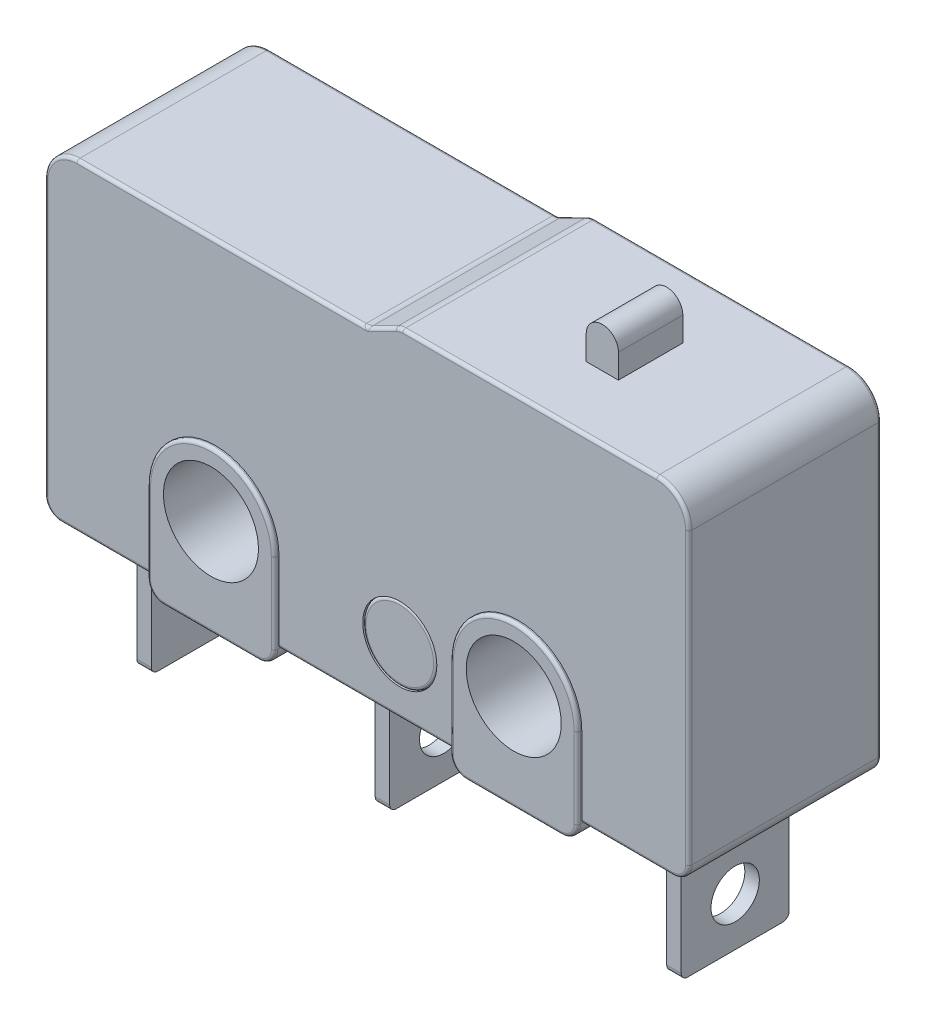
ISO-10303-21;
HEADER;
FILE_DESCRIPTION(('STEP AP214'),'2;1');
FILE_NAME('part.step','',(''),(''),'','','');
FILE_SCHEMA(('AUTOMOTIVE_DESIGN { 1 0 10303 214 1 1 1 1 }'));
ENDSEC;
DATA;
#1=APPLICATION_CONTEXT('core data for automotive mechanical design processes');
#2=APPLICATION_PROTOCOL_DEFINITION('international standard','automotive_design',2000,#1);
#3=PRODUCT_CONTEXT('',#1,'mechanical');
#4=PRODUCT('Part','Part','',(#3));
#5=PRODUCT_RELATED_PRODUCT_CATEGORY('part','',(#4));
#6=PRODUCT_DEFINITION_FORMATION('','',#4);
#7=PRODUCT_DEFINITION_CONTEXT('part definition',#1,'design');
#8=PRODUCT_DEFINITION('design','',#6,#7);
#9=PRODUCT_DEFINITION_SHAPE('','',#8);
#10=(LENGTH_UNIT() NAMED_UNIT(*) SI_UNIT(.MILLI.,.METRE.));
#11=(NAMED_UNIT(*) PLANE_ANGLE_UNIT() SI_UNIT($,.RADIAN.));
#12=(NAMED_UNIT(*) SI_UNIT($,.STERADIAN.) SOLID_ANGLE_UNIT());
#13=UNCERTAINTY_MEASURE_WITH_UNIT(LENGTH_MEASURE(1.E-05),#10,'distance_accuracy_value','');
#14=(GEOMETRIC_REPRESENTATION_CONTEXT(3) GLOBAL_UNCERTAINTY_ASSIGNED_CONTEXT((#13)) GLOBAL_UNIT_ASSIGNED_CONTEXT((#10,
#11,#12)) REPRESENTATION_CONTEXT('',''));
#15=CARTESIAN_POINT('',(0.,0.,0.));
#16=DIRECTION('',(0.,0.,1.));
#17=DIRECTION('',(1.,0.,0.));
#18=AXIS2_PLACEMENT_3D('',#15,#16,#17);
#19=CARTESIAN_POINT('',(9.,-1.,-2.9875));
#20=DIRECTION('',(0.,0.,-1.));
#21=DIRECTION('',(-1.,0.,0.));
#22=AXIS2_PLACEMENT_3D('',#19,#20,#21);
#23=PLANE('',#22);
#24=CARTESIAN_POINT('',(1.025,-8.49999999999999,-2.9875));
#25=DIRECTION('',(0.,0.,-1.));
#26=DIRECTION('',(-1.,0.,0.));
#27=AXIS2_PLACEMENT_3D('',#24,#25,#26);
#28=CIRCLE('',#27,1.05);
#29=CARTESIAN_POINT('',(-0.0249999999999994,-8.49999999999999,-2.9875));
#30=VERTEX_POINT('',#29);
#31=EDGE_CURVE('E56',#30,#30,#28,.T.);
#32=ORIENTED_EDGE('',*,*,#31,.T.);
#33=EDGE_LOOP('',(#32));
#34=FACE_BOUND('',#33,.T.);
#35=ADVANCED_FACE('F49',(#34),#23,.T.);
#36=CARTESIAN_POINT('',(1.025,-8.49999999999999,2.9875));
#37=DIRECTION('',(0.,0.,1.));
#38=DIRECTION('',(1.,0.,0.));
#39=AXIS2_PLACEMENT_3D('',#36,#37,#38);
#40=PLANE('',#39);
#41=CARTESIAN_POINT('',(1.025,-8.49999999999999,2.9875));
#42=DIRECTION('',(0.,0.,1.));
#43=DIRECTION('',(1.,0.,0.));
#44=AXIS2_PLACEMENT_3D('',#41,#42,#43);
#45=CIRCLE('',#44,1.05);
#46=CARTESIAN_POINT('',(2.075,-8.49999999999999,2.9875));
#47=VERTEX_POINT('',#46);
#48=EDGE_CURVE('E11',#47,#47,#45,.T.);
#49=ORIENTED_EDGE('',*,*,#48,.T.);
#50=EDGE_LOOP('',(#49));
#51=FACE_BOUND('',#50,.T.);
#52=ADVANCED_FACE('F80',(#51),#40,.T.);
#53=CARTESIAN_POINT('',(1.025,-8.49999999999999,-6.24019119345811));
#54=DIRECTION('',(0.,0.,1.));
#55=DIRECTION('',(1.,0.,0.));
#56=AXIS2_PLACEMENT_3D('',#53,#54,#55);
#57=CYLINDRICAL_SURFACE('',#56,1.15);
#58=CARTESIAN_POINT('',(1.025,-8.49999999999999,-2.8875));
#59=DIRECTION('',(0.,0.,-1.));
#60=DIRECTION('',(-1.,0.,0.));
#61=AXIS2_PLACEMENT_3D('',#58,#59,#60);
#62=CIRCLE('',#61,1.15);
#63=CARTESIAN_POINT('',(-0.124999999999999,-8.49999999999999,-2.8875));
#64=VERTEX_POINT('',#63);
#65=EDGE_CURVE('E60',#64,#64,#62,.F.);
#66=ORIENTED_EDGE('',*,*,#65,.T.);
#67=EDGE_LOOP('',(#66));
#68=FACE_BOUND('',#67,.T.);
#69=CARTESIAN_POINT('',(1.025,-8.49999999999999,2.8875));
#70=DIRECTION('',(0.,0.,1.));
#71=DIRECTION('',(1.,0.,0.));
#72=AXIS2_PLACEMENT_3D('',#69,#70,#71);
#73=CIRCLE('',#72,1.15);
#74=CARTESIAN_POINT('',(2.175,-8.49999999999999,2.8875));
#75=VERTEX_POINT('',#74);
#76=EDGE_CURVE('E64',#75,#75,#73,.F.);
#77=ORIENTED_EDGE('',*,*,#76,.T.);
#78=EDGE_LOOP('',(#77));
#79=FACE_BOUND('',#78,.T.);
#80=ADVANCED_FACE('F70',(#68,#79),#57,.T.);
#81=CARTESIAN_POINT('',(1.025,-8.49999999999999,-2.8875));
#82=DIRECTION('',(0.,0.,-1.));
#83=DIRECTION('',(-1.,0.,0.));
#84=AXIS2_PLACEMENT_3D('',#81,#82,#83);
#85=TOROIDAL_SURFACE('',#84,1.05,0.1);
#86=ORIENTED_EDGE('',*,*,#31,.F.);
#87=EDGE_LOOP('',(#86));
#88=FACE_BOUND('',#87,.T.);
#89=ORIENTED_EDGE('',*,*,#65,.F.);
#90=EDGE_LOOP('',(#89));
#91=FACE_BOUND('',#90,.T.);
#92=ADVANCED_FACE('F74',(#88,#91),#85,.T.);
#93=CARTESIAN_POINT('',(1.025,-8.49999999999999,2.8875));
#94=DIRECTION('',(0.,0.,1.));
#95=DIRECTION('',(1.,0.,0.));
#96=AXIS2_PLACEMENT_3D('',#93,#94,#95);
#97=TOROIDAL_SURFACE('',#96,1.05,0.1);
#98=ORIENTED_EDGE('',*,*,#76,.F.);
#99=EDGE_LOOP('',(#98));
#100=FACE_BOUND('',#99,.T.);
#101=ORIENTED_EDGE('',*,*,#48,.F.);
#102=EDGE_LOOP('',(#101));
#103=FACE_BOUND('',#102,.T.);
#104=ADVANCED_FACE('F51',(#100,#103),#97,.T.);
#105=CLOSED_SHELL('',(#35,#52,#80,#92,#104));
#106=MANIFOLD_SOLID_BREP('B2',#105);
#107=CARTESIAN_POINT('',(5.325,0.75,1.));
#108=DIRECTION('',(0.,0.,-1.));
#109=DIRECTION('',(-1.,0.,0.));
#110=AXIS2_PLACEMENT_3D('',#107,#108,#109);
#111=CYLINDRICAL_SURFACE('',#110,0.5);
#112=CARTESIAN_POINT('',(5.325,0.75,-1.));
#113=DIRECTION('',(0.,0.,1.));
#114=DIRECTION('',(-1.,0.,0.));
#115=AXIS2_PLACEMENT_3D('',#112,#113,#114);
#116=CIRCLE('',#115,0.5);
#117=CARTESIAN_POINT('',(5.825,0.75,-1.));
#118=VERTEX_POINT('',#117);
#119=CARTESIAN_POINT('',(4.825,0.75,-1.));
#120=VERTEX_POINT('',#119);
#121=EDGE_CURVE('E207',#118,#120,#116,.T.);
#122=ORIENTED_EDGE('',*,*,#121,.T.);
#123=DIRECTION('',(0.,0.,-1.));
#124=VECTOR('',#123,1.);
#125=CARTESIAN_POINT('',(4.825,0.75,1.));
#126=LINE('',#125,#124);
#127=CARTESIAN_POINT('',(4.825,0.75,1.));
#128=VERTEX_POINT('',#127);
#129=EDGE_CURVE('E47',#128,#120,#126,.T.);
#130=ORIENTED_EDGE('',*,*,#129,.F.);
#131=CARTESIAN_POINT('',(5.325,0.75,1.));
#132=DIRECTION('',(0.,0.,1.));
#133=DIRECTION('',(-1.,0.,0.));
#134=AXIS2_PLACEMENT_3D('',#131,#132,#133);
#135=CIRCLE('',#134,0.5);
#136=CARTESIAN_POINT('',(5.825,0.75,1.));
#137=VERTEX_POINT('',#136);
#138=EDGE_CURVE('E195',#137,#128,#135,.T.);
#139=ORIENTED_EDGE('',*,*,#138,.F.);
#140=DIRECTION('',(0.,0.,-1.));
#141=VECTOR('',#140,1.);
#142=CARTESIAN_POINT('',(5.825,0.75,1.));
#143=LINE('',#142,#141);
#144=EDGE_CURVE('E203',#137,#118,#143,.T.);
#145=ORIENTED_EDGE('',*,*,#144,.T.);
#146=EDGE_LOOP('',(#122,#130,#139,#145));
#147=FACE_BOUND('',#146,.T.);
#148=ADVANCED_FACE('F144',(#147),#111,.T.);
#149=CARTESIAN_POINT('',(4.825,0.75,1.));
#150=DIRECTION('',(1.,0.,0.));
#151=DIRECTION('',(0.,0.,-1.));
#152=AXIS2_PLACEMENT_3D('',#149,#150,#151);
#153=PLANE('',#152);
#154=DIRECTION('',(0.,-1.,0.));
#155=VECTOR('',#154,1.);
#156=CARTESIAN_POINT('',(4.825,0.75,-1.));
#157=LINE('',#156,#155);
#158=CARTESIAN_POINT('',(4.825,0.,-1.));
#159=VERTEX_POINT('',#158);
#160=EDGE_CURVE('E199',#120,#159,#157,.T.);
#161=ORIENTED_EDGE('',*,*,#160,.T.);
#162=DIRECTION('',(0.,0.,-1.));
#163=VECTOR('',#162,1.);
#164=CARTESIAN_POINT('',(4.825,0.,1.));
#165=LINE('',#164,#163);
#166=CARTESIAN_POINT('',(4.825,0.,1.));
#167=VERTEX_POINT('',#166);
#168=EDGE_CURVE('E152',#167,#159,#165,.T.);
#169=ORIENTED_EDGE('',*,*,#168,.F.);
#170=DIRECTION('',(0.,-1.,0.));
#171=VECTOR('',#170,1.);
#172=CARTESIAN_POINT('',(4.825,0.75,1.));
#173=LINE('',#172,#171);
#174=EDGE_CURVE('E190',#128,#167,#173,.T.);
#175=ORIENTED_EDGE('',*,*,#174,.F.);
#176=ORIENTED_EDGE('',*,*,#129,.T.);
#177=EDGE_LOOP('',(#161,#169,#175,#176));
#178=FACE_BOUND('',#177,.T.);
#179=ADVANCED_FACE('F198',(#178),#153,.F.);
#180=CARTESIAN_POINT('',(4.825,0.,1.));
#181=DIRECTION('',(0.,1.,0.));
#182=DIRECTION('',(0.,0.,1.));
#183=AXIS2_PLACEMENT_3D('',#180,#181,#182);
#184=PLANE('',#183);
#185=DIRECTION('',(1.,0.,0.));
#186=VECTOR('',#185,1.);
#187=CARTESIAN_POINT('',(4.825,0.,-1.));
#188=LINE('',#187,#186);
#189=CARTESIAN_POINT('',(5.825,0.,-1.));
#190=VERTEX_POINT('',#189);
#191=EDGE_CURVE('E177',#159,#190,#188,.T.);
#192=ORIENTED_EDGE('',*,*,#191,.T.);
#193=DIRECTION('',(0.,0.,-1.));
#194=VECTOR('',#193,1.);
#195=CARTESIAN_POINT('',(5.825,0.,1.));
#196=LINE('',#195,#194);
#197=CARTESIAN_POINT('',(5.825,0.,1.));
#198=VERTEX_POINT('',#197);
#199=EDGE_CURVE('E200',#198,#190,#196,.T.);
#200=ORIENTED_EDGE('',*,*,#199,.F.);
#201=DIRECTION('',(1.,0.,0.));
#202=VECTOR('',#201,1.);
#203=CARTESIAN_POINT('',(4.825,0.,1.));
#204=LINE('',#203,#202);
#205=EDGE_CURVE('E193',#167,#198,#204,.T.);
#206=ORIENTED_EDGE('',*,*,#205,.F.);
#207=ORIENTED_EDGE('',*,*,#168,.T.);
#208=EDGE_LOOP('',(#192,#200,#206,#207));
#209=FACE_BOUND('',#208,.T.);
#210=ADVANCED_FACE('F201',(#209),#184,.F.);
#211=CARTESIAN_POINT('',(5.825,0.,1.));
#212=DIRECTION('',(-1.,0.,0.));
#213=DIRECTION('',(0.,0.,1.));
#214=AXIS2_PLACEMENT_3D('',#211,#212,#213);
#215=PLANE('',#214);
#216=DIRECTION('',(0.,1.,0.));
#217=VECTOR('',#216,1.);
#218=CARTESIAN_POINT('',(5.825,0.,-1.));
#219=LINE('',#218,#217);
#220=EDGE_CURVE('E183',#190,#118,#219,.T.);
#221=ORIENTED_EDGE('',*,*,#220,.T.);
#222=ORIENTED_EDGE('',*,*,#144,.F.);
#223=DIRECTION('',(0.,1.,0.));
#224=VECTOR('',#223,1.);
#225=CARTESIAN_POINT('',(5.825,0.,1.));
#226=LINE('',#225,#224);
#227=EDGE_CURVE('E160',#198,#137,#226,.T.);
#228=ORIENTED_EDGE('',*,*,#227,.F.);
#229=ORIENTED_EDGE('',*,*,#199,.T.);
#230=EDGE_LOOP('',(#221,#222,#228,#229));
#231=FACE_BOUND('',#230,.T.);
#232=ADVANCED_FACE('F214',(#231),#215,.F.);
#233=CARTESIAN_POINT('',(5.325,0.75,1.));
#234=DIRECTION('',(0.,0.,-1.));
#235=DIRECTION('',(-1.,0.,0.));
#236=AXIS2_PLACEMENT_3D('',#233,#234,#235);
#237=PLANE('',#236);
#238=ORIENTED_EDGE('',*,*,#138,.T.);
#239=ORIENTED_EDGE('',*,*,#174,.T.);
#240=ORIENTED_EDGE('',*,*,#205,.T.);
#241=ORIENTED_EDGE('',*,*,#227,.T.);
#242=EDGE_LOOP('',(#238,#239,#240,#241));
#243=FACE_BOUND('',#242,.T.);
#244=ADVANCED_FACE('F191',(#243),#237,.F.);
#245=CARTESIAN_POINT('',(5.325,0.75,-1.));
#246=DIRECTION('',(0.,0.,-1.));
#247=DIRECTION('',(-1.,0.,0.));
#248=AXIS2_PLACEMENT_3D('',#245,#246,#247);
#249=PLANE('',#248);
#250=ORIENTED_EDGE('',*,*,#121,.F.);
#251=ORIENTED_EDGE('',*,*,#220,.F.);
#252=ORIENTED_EDGE('',*,*,#191,.F.);
#253=ORIENTED_EDGE('',*,*,#160,.F.);
#254=EDGE_LOOP('',(#250,#251,#252,#253));
#255=FACE_BOUND('',#254,.T.);
#256=ADVANCED_FACE('F217',(#255),#249,.T.);
#257=CLOSED_SHELL('',(#148,#179,#210,#232,#244,#256));
#258=MANIFOLD_SOLID_BREP('B6',#257);
#259=CARTESIAN_POINT('',(8.45,-14.5,-1.67500000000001));
#260=DIRECTION('',(-1.,0.,0.));
#261=DIRECTION('',(0.,0.,1.));
#262=AXIS2_PLACEMENT_3D('',#259,#260,#261);
#263=PLANE('',#262);
#264=CARTESIAN_POINT('',(8.45,-13.,0.));
#265=DIRECTION('',(-1.,0.,0.));
#266=DIRECTION('',(0.,0.,1.));
#267=AXIS2_PLACEMENT_3D('',#264,#265,#266);
#268=CIRCLE('',#267,0.750000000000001);
#269=CARTESIAN_POINT('',(8.45,-13.,0.750000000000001));
#270=VERTEX_POINT('',#269);
#271=EDGE_CURVE('E348',#270,#270,#268,.T.);
#272=ORIENTED_EDGE('',*,*,#271,.T.);
#273=EDGE_LOOP('',(#272));
#274=FACE_BOUND('',#273,.T.);
#275=DIRECTION('',(0.,1.,0.));
#276=VECTOR('',#275,1.);
#277=CARTESIAN_POINT('',(8.45,-14.5,1.67499999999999));
#278=LINE('',#277,#276);
#279=CARTESIAN_POINT('',(8.45,-14.3,1.67499999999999));
#280=VERTEX_POINT('',#279);
#281=CARTESIAN_POINT('',(8.45,-10.5,1.67499999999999));
#282=VERTEX_POINT('',#281);
#283=EDGE_CURVE('E328',#280,#282,#278,.T.);
#284=ORIENTED_EDGE('',*,*,#283,.F.);
#285=CARTESIAN_POINT('',(8.45,-14.3,1.47499999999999));
#286=DIRECTION('',(-1.,0.,0.));
#287=DIRECTION('',(0.,0.,1.));
#288=AXIS2_PLACEMENT_3D('',#285,#286,#287);
#289=CIRCLE('',#288,0.2);
#290=CARTESIAN_POINT('',(8.45,-14.5,1.47499999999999));
#291=VERTEX_POINT('',#290);
#292=EDGE_CURVE('E285',#280,#291,#289,.F.);
#293=ORIENTED_EDGE('',*,*,#292,.T.);
#294=DIRECTION('',(0.,0.,1.));
#295=VECTOR('',#294,1.);
#296=CARTESIAN_POINT('',(8.45,-14.5,-1.67500000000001));
#297=LINE('',#296,#295);
#298=CARTESIAN_POINT('',(8.45,-14.5,-1.47500000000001));
#299=VERTEX_POINT('',#298);
#300=EDGE_CURVE('E360',#299,#291,#297,.T.);
#301=ORIENTED_EDGE('',*,*,#300,.F.);
#302=CARTESIAN_POINT('',(8.45,-14.3,-1.47500000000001));
#303=DIRECTION('',(-1.,0.,0.));
#304=DIRECTION('',(0.,0.,1.));
#305=AXIS2_PLACEMENT_3D('',#302,#303,#304);
#306=CIRCLE('',#305,0.2);
#307=CARTESIAN_POINT('',(8.45,-14.3,-1.67500000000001));
#308=VERTEX_POINT('',#307);
#309=EDGE_CURVE('E292',#299,#308,#306,.F.);
#310=ORIENTED_EDGE('',*,*,#309,.T.);
#311=DIRECTION('',(0.,1.,0.));
#312=VECTOR('',#311,1.);
#313=CARTESIAN_POINT('',(8.45,-14.5,-1.67500000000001));
#314=LINE('',#313,#312);
#315=CARTESIAN_POINT('',(8.45,-10.5,-1.67500000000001));
#316=VERTEX_POINT('',#315);
#317=EDGE_CURVE('E346',#308,#316,#314,.T.);
#318=ORIENTED_EDGE('',*,*,#317,.T.);
#319=DIRECTION('',(0.,0.,1.));
#320=VECTOR('',#319,1.);
#321=CARTESIAN_POINT('',(8.45,-10.5,-1.67500000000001));
#322=LINE('',#321,#320);
#323=EDGE_CURVE('E342',#316,#282,#322,.T.);
#324=ORIENTED_EDGE('',*,*,#323,.T.);
#325=EDGE_LOOP('',(#284,#293,#301,#310,#318,#324));
#326=FACE_BOUND('',#325,.T.);
#327=ADVANCED_FACE('F277',(#274,#326),#263,.F.);
#328=CARTESIAN_POINT('',(8.,-14.5,1.67499999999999));
#329=DIRECTION('',(0.,0.,-1.));
#330=DIRECTION('',(-1.,0.,0.));
#331=AXIS2_PLACEMENT_3D('',#328,#329,#330);
#332=PLANE('',#331);
#333=DIRECTION('',(0.,1.,0.));
#334=VECTOR('',#333,1.);
#335=CARTESIAN_POINT('',(8.,-14.5,1.67499999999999));
#336=LINE('',#335,#334);
#337=CARTESIAN_POINT('',(8.,-14.3,1.67499999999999));
#338=VERTEX_POINT('',#337);
#339=CARTESIAN_POINT('',(8.,-10.5,1.67499999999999));
#340=VERTEX_POINT('',#339);
#341=EDGE_CURVE('E336',#338,#340,#336,.T.);
#342=ORIENTED_EDGE('',*,*,#341,.F.);
#343=DIRECTION('',(-1.,0.,0.));
#344=VECTOR('',#343,1.);
#345=CARTESIAN_POINT('',(8.,-14.3,1.67499999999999));
#346=LINE('',#345,#344);
#347=EDGE_CURVE('E300',#338,#280,#346,.F.);
#348=ORIENTED_EDGE('',*,*,#347,.T.);
#349=ORIENTED_EDGE('',*,*,#283,.T.);
#350=DIRECTION('',(-1.,0.,0.));
#351=VECTOR('',#350,1.);
#352=CARTESIAN_POINT('',(8.,-10.5,1.67499999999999));
#353=LINE('',#352,#351);
#354=EDGE_CURVE('E331',#282,#340,#353,.T.);
#355=ORIENTED_EDGE('',*,*,#354,.T.);
#356=EDGE_LOOP('',(#342,#348,#349,#355));
#357=FACE_BOUND('',#356,.T.);
#358=ADVANCED_FACE('F330',(#357),#332,.F.);
#359=CARTESIAN_POINT('',(8.,-14.5,-1.67500000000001));
#360=DIRECTION('',(1.,0.,0.));
#361=DIRECTION('',(0.,0.,-1.));
#362=AXIS2_PLACEMENT_3D('',#359,#360,#361);
#363=PLANE('',#362);
#364=CARTESIAN_POINT('',(8.,-13.,0.));
#365=DIRECTION('',(1.,0.,0.));
#366=DIRECTION('',(0.,0.,-1.));
#367=AXIS2_PLACEMENT_3D('',#364,#365,#366);
#368=CIRCLE('',#367,0.750000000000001);
#369=CARTESIAN_POINT('',(8.,-13.,-0.750000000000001));
#370=VERTEX_POINT('',#369);
#371=EDGE_CURVE('E351',#370,#370,#368,.T.);
#372=ORIENTED_EDGE('',*,*,#371,.T.);
#373=EDGE_LOOP('',(#372));
#374=FACE_BOUND('',#373,.T.);
#375=DIRECTION('',(0.,0.,-1.));
#376=VECTOR('',#375,1.);
#377=CARTESIAN_POINT('',(8.,-14.5,-1.67500000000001));
#378=LINE('',#377,#376);
#379=CARTESIAN_POINT('',(8.,-14.5,1.47499999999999));
#380=VERTEX_POINT('',#379);
#381=CARTESIAN_POINT('',(8.,-14.5,-1.47500000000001));
#382=VERTEX_POINT('',#381);
#383=EDGE_CURVE('E354',#380,#382,#378,.T.);
#384=ORIENTED_EDGE('',*,*,#383,.F.);
#385=CARTESIAN_POINT('',(8.,-14.3,1.47499999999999));
#386=DIRECTION('',(1.,0.,0.));
#387=DIRECTION('',(0.,0.,-1.));
#388=AXIS2_PLACEMENT_3D('',#385,#386,#387);
#389=CIRCLE('',#388,0.2);
#390=EDGE_CURVE('E374',#380,#338,#389,.F.);
#391=ORIENTED_EDGE('',*,*,#390,.T.);
#392=ORIENTED_EDGE('',*,*,#341,.T.);
#393=DIRECTION('',(0.,0.,-1.));
#394=VECTOR('',#393,1.);
#395=CARTESIAN_POINT('',(8.,-10.5,-1.67500000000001));
#396=LINE('',#395,#394);
#397=CARTESIAN_POINT('',(8.,-10.5,-1.67500000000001));
#398=VERTEX_POINT('',#397);
#399=EDGE_CURVE('E344',#340,#398,#396,.T.);
#400=ORIENTED_EDGE('',*,*,#399,.T.);
#401=DIRECTION('',(0.,1.,0.));
#402=VECTOR('',#401,1.);
#403=CARTESIAN_POINT('',(8.,-14.5,-1.67500000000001));
#404=LINE('',#403,#402);
#405=CARTESIAN_POINT('',(8.,-14.3,-1.67500000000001));
#406=VERTEX_POINT('',#405);
#407=EDGE_CURVE('E362',#406,#398,#404,.T.);
#408=ORIENTED_EDGE('',*,*,#407,.F.);
#409=CARTESIAN_POINT('',(8.,-14.3,-1.47500000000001));
#410=DIRECTION('',(1.,0.,0.));
#411=DIRECTION('',(0.,0.,-1.));
#412=AXIS2_PLACEMENT_3D('',#409,#410,#411);
#413=CIRCLE('',#412,0.2);
#414=EDGE_CURVE('E372',#406,#382,#413,.F.);
#415=ORIENTED_EDGE('',*,*,#414,.T.);
#416=EDGE_LOOP('',(#384,#391,#392,#400,#408,#415));
#417=FACE_BOUND('',#416,.T.);
#418=ADVANCED_FACE('F387',(#374,#417),#363,.F.);
#419=CARTESIAN_POINT('',(8.,-14.5,-1.67500000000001));
#420=DIRECTION('',(0.,0.,1.));
#421=DIRECTION('',(1.,0.,0.));
#422=AXIS2_PLACEMENT_3D('',#419,#420,#421);
#423=PLANE('',#422);
#424=ORIENTED_EDGE('',*,*,#317,.F.);
#425=DIRECTION('',(1.,0.,0.));
#426=VECTOR('',#425,1.);
#427=CARTESIAN_POINT('',(8.,-14.3,-1.67500000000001));
#428=LINE('',#427,#426);
#429=EDGE_CURVE('E142',#308,#406,#428,.F.);
#430=ORIENTED_EDGE('',*,*,#429,.T.);
#431=ORIENTED_EDGE('',*,*,#407,.T.);
#432=DIRECTION('',(1.,0.,0.));
#433=VECTOR('',#432,1.);
#434=CARTESIAN_POINT('',(8.,-10.5,-1.67500000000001));
#435=LINE('',#434,#433);
#436=EDGE_CURVE('E358',#398,#316,#435,.T.);
#437=ORIENTED_EDGE('',*,*,#436,.T.);
#438=EDGE_LOOP('',(#424,#430,#431,#437));
#439=FACE_BOUND('',#438,.T.);
#440=ADVANCED_FACE('F393',(#439),#423,.F.);
#441=CARTESIAN_POINT('',(0.,-14.5,0.));
#442=DIRECTION('',(0.,1.,0.));
#443=DIRECTION('',(0.,0.,1.));
#444=AXIS2_PLACEMENT_3D('',#441,#442,#443);
#445=PLANE('',#444);
#446=ORIENTED_EDGE('',*,*,#300,.T.);
#447=DIRECTION('',(-1.,0.,0.));
#448=VECTOR('',#447,1.);
#449=CARTESIAN_POINT('',(0.,-14.5,1.475));
#450=LINE('',#449,#448);
#451=EDGE_CURVE('E369',#291,#380,#450,.T.);
#452=ORIENTED_EDGE('',*,*,#451,.T.);
#453=ORIENTED_EDGE('',*,*,#383,.T.);
#454=DIRECTION('',(1.,0.,0.));
#455=VECTOR('',#454,1.);
#456=CARTESIAN_POINT('',(0.,-14.5,-1.475));
#457=LINE('',#456,#455);
#458=EDGE_CURVE('E335',#382,#299,#457,.T.);
#459=ORIENTED_EDGE('',*,*,#458,.T.);
#460=EDGE_LOOP('',(#446,#452,#453,#459));
#461=FACE_BOUND('',#460,.T.);
#462=ADVANCED_FACE('F381',(#461),#445,.F.);
#463=CARTESIAN_POINT('',(0.,-10.5,0.));
#464=DIRECTION('',(0.,1.,0.));
#465=DIRECTION('',(0.,0.,1.));
#466=AXIS2_PLACEMENT_3D('',#463,#464,#465);
#467=PLANE('',#466);
#468=ORIENTED_EDGE('',*,*,#323,.F.);
#469=ORIENTED_EDGE('',*,*,#436,.F.);
#470=ORIENTED_EDGE('',*,*,#399,.F.);
#471=ORIENTED_EDGE('',*,*,#354,.F.);
#472=EDGE_LOOP('',(#468,#469,#470,#471));
#473=FACE_BOUND('',#472,.T.);
#474=ADVANCED_FACE('F340',(#473),#467,.T.);
#475=CARTESIAN_POINT('',(10.,-13.,0.));
#476=DIRECTION('',(-1.,0.,0.));
#477=DIRECTION('',(0.,0.,1.));
#478=AXIS2_PLACEMENT_3D('',#475,#476,#477);
#479=CYLINDRICAL_SURFACE('',#478,0.750000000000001);
#480=ORIENTED_EDGE('',*,*,#371,.F.);
#481=EDGE_LOOP('',(#480));
#482=FACE_BOUND('',#481,.T.);
#483=ORIENTED_EDGE('',*,*,#271,.F.);
#484=EDGE_LOOP('',(#483));
#485=FACE_BOUND('',#484,.T.);
#486=ADVANCED_FACE('F412',(#482,#485),#479,.F.);
#487=CARTESIAN_POINT('',(0.,-14.3,1.475));
#488=DIRECTION('',(-1.,0.,0.));
#489=DIRECTION('',(0.,0.,1.));
#490=AXIS2_PLACEMENT_3D('',#487,#488,#489);
#491=CYLINDRICAL_SURFACE('',#490,0.2);
#492=ORIENTED_EDGE('',*,*,#292,.F.);
#493=ORIENTED_EDGE('',*,*,#347,.F.);
#494=ORIENTED_EDGE('',*,*,#390,.F.);
#495=ORIENTED_EDGE('',*,*,#451,.F.);
#496=EDGE_LOOP('',(#492,#493,#494,#495));
#497=FACE_BOUND('',#496,.T.);
#498=ADVANCED_FACE('F385',(#497),#491,.T.);
#499=CARTESIAN_POINT('',(0.,-14.3,-1.475));
#500=DIRECTION('',(1.,0.,0.));
#501=DIRECTION('',(0.,0.,-1.));
#502=AXIS2_PLACEMENT_3D('',#499,#500,#501);
#503=CYLINDRICAL_SURFACE('',#502,0.2);
#504=ORIENTED_EDGE('',*,*,#414,.F.);
#505=ORIENTED_EDGE('',*,*,#429,.F.);
#506=ORIENTED_EDGE('',*,*,#309,.F.);
#507=ORIENTED_EDGE('',*,*,#458,.F.);
#508=EDGE_LOOP('',(#504,#505,#506,#507));
#509=FACE_BOUND('',#508,.T.);
#510=ADVANCED_FACE('F279',(#509),#503,.T.);
#511=CLOSED_SHELL('',(#327,#358,#418,#440,#462,#474,#486,#498,#510));
#512=MANIFOLD_SOLID_BREP('B41',#511);
#513=CARTESIAN_POINT('',(-0.6,-14.5,-1.675));
#514=DIRECTION('',(-1.,0.,0.));
#515=DIRECTION('',(0.,0.,1.));
#516=AXIS2_PLACEMENT_3D('',#513,#514,#515);
#517=PLANE('',#516);
#518=CARTESIAN_POINT('',(-0.6,-13.,0.));
#519=DIRECTION('',(-1.,0.,0.));
#520=DIRECTION('',(0.,0.,1.));
#521=AXIS2_PLACEMENT_3D('',#518,#519,#520);
#522=CIRCLE('',#521,0.750000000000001);
#523=CARTESIAN_POINT('',(-0.6,-13.,0.750000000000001));
#524=VERTEX_POINT('',#523);
#525=EDGE_CURVE('E554',#524,#524,#522,.T.);
#526=ORIENTED_EDGE('',*,*,#525,.T.);
#527=EDGE_LOOP('',(#526));
#528=FACE_BOUND('',#527,.T.);
#529=DIRECTION('',(0.,1.,0.));
#530=VECTOR('',#529,1.);
#531=CARTESIAN_POINT('',(-0.6,-14.5,1.675));
#532=LINE('',#531,#530);
#533=CARTESIAN_POINT('',(-0.6,-14.3,1.675));
#534=VERTEX_POINT('',#533);
#535=CARTESIAN_POINT('',(-0.6,-10.5,1.675));
#536=VERTEX_POINT('',#535);
#537=EDGE_CURVE('E534',#534,#536,#532,.T.);
#538=ORIENTED_EDGE('',*,*,#537,.F.);
#539=CARTESIAN_POINT('',(-0.6,-14.3,1.475));
#540=DIRECTION('',(-1.,0.,0.));
#541=DIRECTION('',(0.,0.,1.));
#542=AXIS2_PLACEMENT_3D('',#539,#540,#541);
#543=CIRCLE('',#542,0.2);
#544=CARTESIAN_POINT('',(-0.6,-14.5,1.475));
#545=VERTEX_POINT('',#544);
#546=EDGE_CURVE('E491',#534,#545,#543,.F.);
#547=ORIENTED_EDGE('',*,*,#546,.T.);
#548=DIRECTION('',(0.,0.,1.));
#549=VECTOR('',#548,1.);
#550=CARTESIAN_POINT('',(-0.6,-14.5,-1.675));
#551=LINE('',#550,#549);
#552=CARTESIAN_POINT('',(-0.6,-14.5,-1.475));
#553=VERTEX_POINT('',#552);
#554=EDGE_CURVE('E566',#553,#545,#551,.T.);
#555=ORIENTED_EDGE('',*,*,#554,.F.);
#556=CARTESIAN_POINT('',(-0.6,-14.3,-1.475));
#557=DIRECTION('',(-1.,0.,0.));
#558=DIRECTION('',(0.,0.,1.));
#559=AXIS2_PLACEMENT_3D('',#556,#557,#558);
#560=CIRCLE('',#559,0.2);
#561=CARTESIAN_POINT('',(-0.6,-14.3,-1.675));
#562=VERTEX_POINT('',#561);
#563=EDGE_CURVE('E498',#553,#562,#560,.F.);
#564=ORIENTED_EDGE('',*,*,#563,.T.);
#565=DIRECTION('',(0.,1.,0.));
#566=VECTOR('',#565,1.);
#567=CARTESIAN_POINT('',(-0.6,-14.5,-1.675));
#568=LINE('',#567,#566);
#569=CARTESIAN_POINT('',(-0.6,-10.5,-1.675));
#570=VERTEX_POINT('',#569);
#571=EDGE_CURVE('E552',#562,#570,#568,.T.);
#572=ORIENTED_EDGE('',*,*,#571,.T.);
#573=DIRECTION('',(0.,0.,1.));
#574=VECTOR('',#573,1.);
#575=CARTESIAN_POINT('',(-0.6,-10.5,-1.675));
#576=LINE('',#575,#574);
#577=EDGE_CURVE('E548',#570,#536,#576,.T.);
#578=ORIENTED_EDGE('',*,*,#577,.T.);
#579=EDGE_LOOP('',(#538,#547,#555,#564,#572,#578));
#580=FACE_BOUND('',#579,.T.);
#581=ADVANCED_FACE('F483',(#528,#580),#517,.F.);
#582=CARTESIAN_POINT('',(-1.05,-14.5,1.675));
#583=DIRECTION('',(0.,0.,-1.));
#584=DIRECTION('',(-1.,0.,0.));
#585=AXIS2_PLACEMENT_3D('',#582,#583,#584);
#586=PLANE('',#585);
#587=DIRECTION('',(0.,1.,0.));
#588=VECTOR('',#587,1.);
#589=CARTESIAN_POINT('',(-1.05,-14.5,1.675));
#590=LINE('',#589,#588);
#591=CARTESIAN_POINT('',(-1.05,-14.3,1.675));
#592=VERTEX_POINT('',#591);
#593=CARTESIAN_POINT('',(-1.05,-10.5,1.675));
#594=VERTEX_POINT('',#593);
#595=EDGE_CURVE('E542',#592,#594,#590,.T.);
#596=ORIENTED_EDGE('',*,*,#595,.F.);
#597=DIRECTION('',(-1.,0.,0.));
#598=VECTOR('',#597,1.);
#599=CARTESIAN_POINT('',(-1.05,-14.3,1.675));
#600=LINE('',#599,#598);
#601=EDGE_CURVE('E506',#592,#534,#600,.F.);
#602=ORIENTED_EDGE('',*,*,#601,.T.);
#603=ORIENTED_EDGE('',*,*,#537,.T.);
#604=DIRECTION('',(-1.,0.,0.));
#605=VECTOR('',#604,1.);
#606=CARTESIAN_POINT('',(-1.05,-10.5,1.675));
#607=LINE('',#606,#605);
#608=EDGE_CURVE('E537',#536,#594,#607,.T.);
#609=ORIENTED_EDGE('',*,*,#608,.T.);
#610=EDGE_LOOP('',(#596,#602,#603,#609));
#611=FACE_BOUND('',#610,.T.);
#612=ADVANCED_FACE('F536',(#611),#586,.F.);
#613=CARTESIAN_POINT('',(-1.05,-14.5,-1.675));
#614=DIRECTION('',(1.,0.,0.));
#615=DIRECTION('',(0.,0.,-1.));
#616=AXIS2_PLACEMENT_3D('',#613,#614,#615);
#617=PLANE('',#616);
#618=CARTESIAN_POINT('',(-1.05,-13.,0.));
#619=DIRECTION('',(1.,0.,0.));
#620=DIRECTION('',(0.,0.,-1.));
#621=AXIS2_PLACEMENT_3D('',#618,#619,#620);
#622=CIRCLE('',#621,0.750000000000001);
#623=CARTESIAN_POINT('',(-1.05,-13.,-0.750000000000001));
#624=VERTEX_POINT('',#623);
#625=EDGE_CURVE('E557',#624,#624,#622,.T.);
#626=ORIENTED_EDGE('',*,*,#625,.T.);
#627=EDGE_LOOP('',(#626));
#628=FACE_BOUND('',#627,.T.);
#629=DIRECTION('',(0.,0.,-1.));
#630=VECTOR('',#629,1.);
#631=CARTESIAN_POINT('',(-1.05,-14.5,-1.675));
#632=LINE('',#631,#630);
#633=CARTESIAN_POINT('',(-1.05,-14.5,1.475));
#634=VERTEX_POINT('',#633);
#635=CARTESIAN_POINT('',(-1.05,-14.5,-1.475));
#636=VERTEX_POINT('',#635);
#637=EDGE_CURVE('E560',#634,#636,#632,.T.);
#638=ORIENTED_EDGE('',*,*,#637,.F.);
#639=CARTESIAN_POINT('',(-1.05,-14.3,1.475));
#640=DIRECTION('',(1.,0.,0.));
#641=DIRECTION('',(0.,0.,-1.));
#642=AXIS2_PLACEMENT_3D('',#639,#640,#641);
#643=CIRCLE('',#642,0.2);
#644=EDGE_CURVE('E580',#634,#592,#643,.F.);
#645=ORIENTED_EDGE('',*,*,#644,.T.);
#646=ORIENTED_EDGE('',*,*,#595,.T.);
#647=DIRECTION('',(0.,0.,-1.));
#648=VECTOR('',#647,1.);
#649=CARTESIAN_POINT('',(-1.05,-10.5,-1.675));
#650=LINE('',#649,#648);
#651=CARTESIAN_POINT('',(-1.05,-10.5,-1.675));
#652=VERTEX_POINT('',#651);
#653=EDGE_CURVE('E550',#594,#652,#650,.T.);
#654=ORIENTED_EDGE('',*,*,#653,.T.);
#655=DIRECTION('',(0.,1.,0.));
#656=VECTOR('',#655,1.);
#657=CARTESIAN_POINT('',(-1.05,-14.5,-1.675));
#658=LINE('',#657,#656);
#659=CARTESIAN_POINT('',(-1.05,-14.3,-1.675));
#660=VERTEX_POINT('',#659);
#661=EDGE_CURVE('E568',#660,#652,#658,.T.);
#662=ORIENTED_EDGE('',*,*,#661,.F.);
#663=CARTESIAN_POINT('',(-1.05,-14.3,-1.475));
#664=DIRECTION('',(1.,0.,0.));
#665=DIRECTION('',(0.,0.,-1.));
#666=AXIS2_PLACEMENT_3D('',#663,#664,#665);
#667=CIRCLE('',#666,0.2);
#668=EDGE_CURVE('E578',#660,#636,#667,.F.);
#669=ORIENTED_EDGE('',*,*,#668,.T.);
#670=EDGE_LOOP('',(#638,#645,#646,#654,#662,#669));
#671=FACE_BOUND('',#670,.T.);
#672=ADVANCED_FACE('F593',(#628,#671),#617,.F.);
#673=CARTESIAN_POINT('',(-1.05,-14.5,-1.675));
#674=DIRECTION('',(0.,0.,1.));
#675=DIRECTION('',(1.,0.,0.));
#676=AXIS2_PLACEMENT_3D('',#673,#674,#675);
#677=PLANE('',#676);
#678=ORIENTED_EDGE('',*,*,#571,.F.);
#679=DIRECTION('',(1.,0.,0.));
#680=VECTOR('',#679,1.);
#681=CARTESIAN_POINT('',(-1.05,-14.3,-1.675));
#682=LINE('',#681,#680);
#683=EDGE_CURVE('E275',#562,#660,#682,.F.);
#684=ORIENTED_EDGE('',*,*,#683,.T.);
#685=ORIENTED_EDGE('',*,*,#661,.T.);
#686=DIRECTION('',(1.,0.,0.));
#687=VECTOR('',#686,1.);
#688=CARTESIAN_POINT('',(-1.05,-10.5,-1.675));
#689=LINE('',#688,#687);
#690=EDGE_CURVE('E564',#652,#570,#689,.T.);
#691=ORIENTED_EDGE('',*,*,#690,.T.);
#692=EDGE_LOOP('',(#678,#684,#685,#691));
#693=FACE_BOUND('',#692,.T.);
#694=ADVANCED_FACE('F599',(#693),#677,.F.);
#695=CARTESIAN_POINT('',(0.,-14.5,0.));
#696=DIRECTION('',(0.,1.,0.));
#697=DIRECTION('',(0.,0.,1.));
#698=AXIS2_PLACEMENT_3D('',#695,#696,#697);
#699=PLANE('',#698);
#700=ORIENTED_EDGE('',*,*,#554,.T.);
#701=DIRECTION('',(-1.,0.,0.));
#702=VECTOR('',#701,1.);
#703=CARTESIAN_POINT('',(0.,-14.5,1.475));
#704=LINE('',#703,#702);
#705=EDGE_CURVE('E575',#545,#634,#704,.T.);
#706=ORIENTED_EDGE('',*,*,#705,.T.);
#707=ORIENTED_EDGE('',*,*,#637,.T.);
#708=DIRECTION('',(1.,0.,0.));
#709=VECTOR('',#708,1.);
#710=CARTESIAN_POINT('',(0.,-14.5,-1.475));
#711=LINE('',#710,#709);
#712=EDGE_CURVE('E541',#636,#553,#711,.T.);
#713=ORIENTED_EDGE('',*,*,#712,.T.);
#714=EDGE_LOOP('',(#700,#706,#707,#713));
#715=FACE_BOUND('',#714,.T.);
#716=ADVANCED_FACE('F587',(#715),#699,.F.);
#717=CARTESIAN_POINT('',(0.,-10.5,0.));
#718=DIRECTION('',(0.,1.,0.));
#719=DIRECTION('',(0.,0.,1.));
#720=AXIS2_PLACEMENT_3D('',#717,#718,#719);
#721=PLANE('',#720);
#722=ORIENTED_EDGE('',*,*,#577,.F.);
#723=ORIENTED_EDGE('',*,*,#690,.F.);
#724=ORIENTED_EDGE('',*,*,#653,.F.);
#725=ORIENTED_EDGE('',*,*,#608,.F.);
#726=EDGE_LOOP('',(#722,#723,#724,#725));
#727=FACE_BOUND('',#726,.T.);
#728=ADVANCED_FACE('F546',(#727),#721,.T.);
#729=CARTESIAN_POINT('',(10.,-13.,0.));
#730=DIRECTION('',(-1.,0.,0.));
#731=DIRECTION('',(0.,0.,1.));
#732=AXIS2_PLACEMENT_3D('',#729,#730,#731);
#733=CYLINDRICAL_SURFACE('',#732,0.750000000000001);
#734=ORIENTED_EDGE('',*,*,#625,.F.);
#735=EDGE_LOOP('',(#734));
#736=FACE_BOUND('',#735,.T.);
#737=ORIENTED_EDGE('',*,*,#525,.F.);
#738=EDGE_LOOP('',(#737));
#739=FACE_BOUND('',#738,.T.);
#740=ADVANCED_FACE('F618',(#736,#739),#733,.F.);
#741=CARTESIAN_POINT('',(0.,-14.3,1.475));
#742=DIRECTION('',(-1.,0.,0.));
#743=DIRECTION('',(0.,0.,1.));
#744=AXIS2_PLACEMENT_3D('',#741,#742,#743);
#745=CYLINDRICAL_SURFACE('',#744,0.2);
#746=ORIENTED_EDGE('',*,*,#546,.F.);
#747=ORIENTED_EDGE('',*,*,#601,.F.);
#748=ORIENTED_EDGE('',*,*,#644,.F.);
#749=ORIENTED_EDGE('',*,*,#705,.F.);
#750=EDGE_LOOP('',(#746,#747,#748,#749));
#751=FACE_BOUND('',#750,.T.);
#752=ADVANCED_FACE('F591',(#751),#745,.T.);
#753=CARTESIAN_POINT('',(0.,-14.3,-1.475));
#754=DIRECTION('',(1.,0.,0.));
#755=DIRECTION('',(0.,0.,-1.));
#756=AXIS2_PLACEMENT_3D('',#753,#754,#755);
#757=CYLINDRICAL_SURFACE('',#756,0.2);
#758=ORIENTED_EDGE('',*,*,#668,.F.);
#759=ORIENTED_EDGE('',*,*,#683,.F.);
#760=ORIENTED_EDGE('',*,*,#563,.F.);
#761=ORIENTED_EDGE('',*,*,#712,.F.);
#762=EDGE_LOOP('',(#758,#759,#760,#761));
#763=FACE_BOUND('',#762,.T.);
#764=ADVANCED_FACE('F485',(#763),#757,.T.);
#765=CLOSED_SHELL('',(#581,#612,#672,#694,#716,#728,#740,#752,#764));
#766=MANIFOLD_SOLID_BREP('B136',#765);
#767=CARTESIAN_POINT('',(-8.,-14.5,-1.675));
#768=DIRECTION('',(-1.,0.,0.));
#769=DIRECTION('',(0.,0.,1.));
#770=AXIS2_PLACEMENT_3D('',#767,#768,#769);
#771=PLANE('',#770);
#772=CARTESIAN_POINT('',(-8.,-13.,0.));
#773=DIRECTION('',(-1.,0.,0.));
#774=DIRECTION('',(0.,0.,1.));
#775=AXIS2_PLACEMENT_3D('',#772,#773,#774);
#776=CIRCLE('',#775,0.750000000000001);
#777=CARTESIAN_POINT('',(-8.,-13.,0.750000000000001));
#778=VERTEX_POINT('',#777);
#779=EDGE_CURVE('E764',#778,#778,#776,.T.);
#780=ORIENTED_EDGE('',*,*,#779,.T.);
#781=EDGE_LOOP('',(#780));
#782=FACE_BOUND('',#781,.T.);
#783=DIRECTION('',(0.,0.,1.));
#784=VECTOR('',#783,1.);
#785=CARTESIAN_POINT('',(-8.,-14.5,-1.675));
#786=LINE('',#785,#784);
#787=CARTESIAN_POINT('',(-8.,-14.5,-1.475));
#788=VERTEX_POINT('',#787);
#789=CARTESIAN_POINT('',(-8.,-14.5,1.475));
#790=VERTEX_POINT('',#789);
#791=EDGE_CURVE('E776',#788,#790,#786,.T.);
#792=ORIENTED_EDGE('',*,*,#791,.F.);
#793=CARTESIAN_POINT('',(-8.,-14.3,-1.475));
#794=DIRECTION('',(-1.,0.,0.));
#795=DIRECTION('',(0.,0.,1.));
#796=AXIS2_PLACEMENT_3D('',#793,#794,#795);
#797=CIRCLE('',#796,0.2);
#798=CARTESIAN_POINT('',(-8.,-14.3,-1.675));
#799=VERTEX_POINT('',#798);
#800=EDGE_CURVE('E788',#788,#799,#797,.F.);
#801=ORIENTED_EDGE('',*,*,#800,.T.);
#802=DIRECTION('',(0.,1.,0.));
#803=VECTOR('',#802,1.);
#804=CARTESIAN_POINT('',(-8.,-14.5,-1.675));
#805=LINE('',#804,#803);
#806=CARTESIAN_POINT('',(-8.,-10.5,-1.675));
#807=VERTEX_POINT('',#806);
#808=EDGE_CURVE('E762',#799,#807,#805,.T.);
#809=ORIENTED_EDGE('',*,*,#808,.T.);
#810=DIRECTION('',(0.,0.,1.));
#811=VECTOR('',#810,1.);
#812=CARTESIAN_POINT('',(-8.,-10.5,-1.675));
#813=LINE('',#812,#811);
#814=CARTESIAN_POINT('',(-8.,-10.5,1.675));
#815=VERTEX_POINT('',#814);
#816=EDGE_CURVE('E757',#807,#815,#813,.T.);
#817=ORIENTED_EDGE('',*,*,#816,.T.);
#818=DIRECTION('',(0.,1.,0.));
#819=VECTOR('',#818,1.);
#820=CARTESIAN_POINT('',(-8.,-14.5,1.675));
#821=LINE('',#820,#819);
#822=CARTESIAN_POINT('',(-8.,-14.3,1.675));
#823=VERTEX_POINT('',#822);
#824=EDGE_CURVE('E741',#823,#815,#821,.T.);
#825=ORIENTED_EDGE('',*,*,#824,.F.);
#826=CARTESIAN_POINT('',(-8.,-14.3,1.475));
#827=DIRECTION('',(-1.,0.,0.));
#828=DIRECTION('',(0.,0.,1.));
#829=AXIS2_PLACEMENT_3D('',#826,#827,#828);
#830=CIRCLE('',#829,0.2);
#831=EDGE_CURVE('E786',#823,#790,#830,.F.);
#832=ORIENTED_EDGE('',*,*,#831,.T.);
#833=EDGE_LOOP('',(#792,#801,#809,#817,#825,#832));
#834=FACE_BOUND('',#833,.T.);
#835=ADVANCED_FACE('F688',(#782,#834),#771,.F.);
#836=CARTESIAN_POINT('',(-8.45,-14.5,1.675));
#837=DIRECTION('',(0.,0.,-1.));
#838=DIRECTION('',(-1.,0.,0.));
#839=AXIS2_PLACEMENT_3D('',#836,#837,#838);
#840=PLANE('',#839);
#841=DIRECTION('',(0.,1.,0.));
#842=VECTOR('',#841,1.);
#843=CARTESIAN_POINT('',(-8.45,-14.5,1.675));
#844=LINE('',#843,#842);
#845=CARTESIAN_POINT('',(-8.45,-14.3,1.675));
#846=VERTEX_POINT('',#845);
#847=CARTESIAN_POINT('',(-8.45,-10.5,1.675));
#848=VERTEX_POINT('',#847);
#849=EDGE_CURVE('E751',#846,#848,#844,.T.);
#850=ORIENTED_EDGE('',*,*,#849,.F.);
#851=DIRECTION('',(-1.,0.,0.));
#852=VECTOR('',#851,1.);
#853=CARTESIAN_POINT('',(-8.45,-14.3,1.675));
#854=LINE('',#853,#852);
#855=EDGE_CURVE('E481',#846,#823,#854,.F.);
#856=ORIENTED_EDGE('',*,*,#855,.T.);
#857=ORIENTED_EDGE('',*,*,#824,.T.);
#858=DIRECTION('',(-1.,0.,0.));
#859=VECTOR('',#858,1.);
#860=CARTESIAN_POINT('',(-8.45,-10.5,1.675));
#861=LINE('',#860,#859);
#862=EDGE_CURVE('E744',#815,#848,#861,.T.);
#863=ORIENTED_EDGE('',*,*,#862,.T.);
#864=EDGE_LOOP('',(#850,#856,#857,#863));
#865=FACE_BOUND('',#864,.T.);
#866=ADVANCED_FACE('F743',(#865),#840,.F.);
#867=CARTESIAN_POINT('',(-8.45,-14.5,-1.675));
#868=DIRECTION('',(1.,0.,0.));
#869=DIRECTION('',(0.,0.,-1.));
#870=AXIS2_PLACEMENT_3D('',#867,#868,#869);
#871=PLANE('',#870);
#872=CARTESIAN_POINT('',(-8.45,-13.,0.));
#873=DIRECTION('',(-1.,0.,0.));
#874=DIRECTION('',(0.,0.,1.));
#875=AXIS2_PLACEMENT_3D('',#872,#873,#874);
#876=CIRCLE('',#875,0.750000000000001);
#877=CARTESIAN_POINT('',(-8.45,-13.,0.750000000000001));
#878=VERTEX_POINT('',#877);
#879=EDGE_CURVE('E767',#878,#878,#876,.T.);
#880=ORIENTED_EDGE('',*,*,#879,.F.);
#881=EDGE_LOOP('',(#880));
#882=FACE_BOUND('',#881,.T.);
#883=DIRECTION('',(0.,1.,0.));
#884=VECTOR('',#883,1.);
#885=CARTESIAN_POINT('',(-8.45,-14.5,-1.675));
#886=LINE('',#885,#884);
#887=CARTESIAN_POINT('',(-8.45,-14.3,-1.675));
#888=VERTEX_POINT('',#887);
#889=CARTESIAN_POINT('',(-8.45,-10.5,-1.675));
#890=VERTEX_POINT('',#889);
#891=EDGE_CURVE('E778',#888,#890,#886,.T.);
#892=ORIENTED_EDGE('',*,*,#891,.F.);
#893=CARTESIAN_POINT('',(-8.45,-14.3,-1.475));
#894=DIRECTION('',(1.,0.,0.));
#895=DIRECTION('',(0.,0.,-1.));
#896=AXIS2_PLACEMENT_3D('',#893,#894,#895);
#897=CIRCLE('',#896,0.2);
#898=CARTESIAN_POINT('',(-8.45,-14.5,-1.475));
#899=VERTEX_POINT('',#898);
#900=EDGE_CURVE('E696',#888,#899,#897,.F.);
#901=ORIENTED_EDGE('',*,*,#900,.T.);
#902=DIRECTION('',(0.,0.,-1.));
#903=VECTOR('',#902,1.);
#904=CARTESIAN_POINT('',(-8.45,-14.5,-1.675));
#905=LINE('',#904,#903);
#906=CARTESIAN_POINT('',(-8.45,-14.5,1.475));
#907=VERTEX_POINT('',#906);
#908=EDGE_CURVE('E770',#907,#899,#905,.T.);
#909=ORIENTED_EDGE('',*,*,#908,.F.);
#910=CARTESIAN_POINT('',(-8.45,-14.3,1.475));
#911=DIRECTION('',(1.,0.,0.));
#912=DIRECTION('',(0.,0.,-1.));
#913=AXIS2_PLACEMENT_3D('',#910,#911,#912);
#914=CIRCLE('',#913,0.2);
#915=EDGE_CURVE('E703',#907,#846,#914,.F.);
#916=ORIENTED_EDGE('',*,*,#915,.T.);
#917=ORIENTED_EDGE('',*,*,#849,.T.);
#918=DIRECTION('',(0.,0.,-1.));
#919=VECTOR('',#918,1.);
#920=CARTESIAN_POINT('',(-8.45,-10.5,-1.675));
#921=LINE('',#920,#919);
#922=EDGE_CURVE('E759',#848,#890,#921,.T.);
#923=ORIENTED_EDGE('',*,*,#922,.T.);
#924=EDGE_LOOP('',(#892,#901,#909,#916,#917,#923));
#925=FACE_BOUND('',#924,.T.);
#926=ADVANCED_FACE('F793',(#882,#925),#871,.F.);
#927=CARTESIAN_POINT('',(-8.45,-14.5,-1.675));
#928=DIRECTION('',(0.,0.,1.));
#929=DIRECTION('',(1.,0.,0.));
#930=AXIS2_PLACEMENT_3D('',#927,#928,#929);
#931=PLANE('',#930);
#932=ORIENTED_EDGE('',*,*,#808,.F.);
#933=DIRECTION('',(1.,0.,0.));
#934=VECTOR('',#933,1.);
#935=CARTESIAN_POINT('',(-8.45,-14.3,-1.675));
#936=LINE('',#935,#934);
#937=EDGE_CURVE('E711',#799,#888,#936,.F.);
#938=ORIENTED_EDGE('',*,*,#937,.T.);
#939=ORIENTED_EDGE('',*,*,#891,.T.);
#940=DIRECTION('',(1.,0.,0.));
#941=VECTOR('',#940,1.);
#942=CARTESIAN_POINT('',(-8.45,-10.5,-1.675));
#943=LINE('',#942,#941);
#944=EDGE_CURVE('E774',#890,#807,#943,.T.);
#945=ORIENTED_EDGE('',*,*,#944,.T.);
#946=EDGE_LOOP('',(#932,#938,#939,#945));
#947=FACE_BOUND('',#946,.T.);
#948=ADVANCED_FACE('F801',(#947),#931,.F.);
#949=CARTESIAN_POINT('',(0.,-14.5,0.));
#950=DIRECTION('',(0.,1.,0.));
#951=DIRECTION('',(0.,0.,1.));
#952=AXIS2_PLACEMENT_3D('',#949,#950,#951);
#953=PLANE('',#952);
#954=ORIENTED_EDGE('',*,*,#908,.T.);
#955=DIRECTION('',(1.,0.,0.));
#956=VECTOR('',#955,1.);
#957=CARTESIAN_POINT('',(0.,-14.5,-1.475));
#958=LINE('',#957,#956);
#959=EDGE_CURVE('E783',#899,#788,#958,.T.);
#960=ORIENTED_EDGE('',*,*,#959,.T.);
#961=ORIENTED_EDGE('',*,*,#791,.T.);
#962=DIRECTION('',(-1.,0.,0.));
#963=VECTOR('',#962,1.);
#964=CARTESIAN_POINT('',(0.,-14.5,1.475));
#965=LINE('',#964,#963);
#966=EDGE_CURVE('E750',#790,#907,#965,.T.);
#967=ORIENTED_EDGE('',*,*,#966,.T.);
#968=EDGE_LOOP('',(#954,#960,#961,#967));
#969=FACE_BOUND('',#968,.T.);
#970=ADVANCED_FACE('F797',(#969),#953,.F.);
#971=CARTESIAN_POINT('',(0.,-10.5,0.));
#972=DIRECTION('',(0.,1.,0.));
#973=DIRECTION('',(0.,0.,1.));
#974=AXIS2_PLACEMENT_3D('',#971,#972,#973);
#975=PLANE('',#974);
#976=ORIENTED_EDGE('',*,*,#816,.F.);
#977=ORIENTED_EDGE('',*,*,#944,.F.);
#978=ORIENTED_EDGE('',*,*,#922,.F.);
#979=ORIENTED_EDGE('',*,*,#862,.F.);
#980=EDGE_LOOP('',(#976,#977,#978,#979));
#981=FACE_BOUND('',#980,.T.);
#982=ADVANCED_FACE('F755',(#981),#975,.T.);
#983=CARTESIAN_POINT('',(10.,-13.,0.));
#984=DIRECTION('',(-1.,0.,0.));
#985=DIRECTION('',(0.,0.,1.));
#986=AXIS2_PLACEMENT_3D('',#983,#984,#985);
#987=CYLINDRICAL_SURFACE('',#986,0.750000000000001);
#988=ORIENTED_EDGE('',*,*,#879,.T.);
#989=EDGE_LOOP('',(#988));
#990=FACE_BOUND('',#989,.T.);
#991=ORIENTED_EDGE('',*,*,#779,.F.);
#992=EDGE_LOOP('',(#991));
#993=FACE_BOUND('',#992,.T.);
#994=ADVANCED_FACE('F807',(#990,#993),#987,.F.);
#995=CARTESIAN_POINT('',(0.,-14.3,-1.475));
#996=DIRECTION('',(1.,0.,0.));
#997=DIRECTION('',(0.,0.,-1.));
#998=AXIS2_PLACEMENT_3D('',#995,#996,#997);
#999=CYLINDRICAL_SURFACE('',#998,0.2);
#1000=ORIENTED_EDGE('',*,*,#900,.F.);
#1001=ORIENTED_EDGE('',*,*,#937,.F.);
#1002=ORIENTED_EDGE('',*,*,#800,.F.);
#1003=ORIENTED_EDGE('',*,*,#959,.F.);
#1004=EDGE_LOOP('',(#1000,#1001,#1002,#1003));
#1005=FACE_BOUND('',#1004,.T.);
#1006=ADVANCED_FACE('F800',(#1005),#999,.T.);
#1007=CARTESIAN_POINT('',(0.,-14.3,1.475));
#1008=DIRECTION('',(-1.,0.,0.));
#1009=DIRECTION('',(0.,0.,1.));
#1010=AXIS2_PLACEMENT_3D('',#1007,#1008,#1009);
#1011=CYLINDRICAL_SURFACE('',#1010,0.2);
#1012=ORIENTED_EDGE('',*,*,#831,.F.);
#1013=ORIENTED_EDGE('',*,*,#855,.F.);
#1014=ORIENTED_EDGE('',*,*,#915,.F.);
#1015=ORIENTED_EDGE('',*,*,#966,.F.);
#1016=EDGE_LOOP('',(#1012,#1013,#1014,#1015));
#1017=FACE_BOUND('',#1016,.T.);
#1018=ADVANCED_FACE('F690',(#1017),#1011,.T.);
#1019=CLOSED_SHELL('',(#835,#866,#926,#948,#970,#982,#994,#1006,#1018));
#1020=MANIFOLD_SOLID_BREP('B269',#1019);
#1021=CARTESIAN_POINT('',(9.,-1.,-2.9875));
#1022=DIRECTION('',(0.,0.,-1.));
#1023=DIRECTION('',(-1.,0.,0.));
#1024=AXIS2_PLACEMENT_3D('',#1021,#1022,#1023);
#1025=PLANE('',#1024);
#1026=CARTESIAN_POINT('',(1.025,-8.49999999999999,-2.9875));
#1027=DIRECTION('',(0.,0.,-1.));
#1028=DIRECTION('',(-1.,0.,0.));
#1029=AXIS2_PLACEMENT_3D('',#1026,#1027,#1028);
#1030=CIRCLE('',#1029,1.15);
#1031=CARTESIAN_POINT('',(-0.124999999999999,-8.49999999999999,-2.9875));
#1032=VERTEX_POINT('',#1031);
#1033=EDGE_CURVE('E1763',#1032,#1032,#1030,.T.);
#1034=ORIENTED_EDGE('',*,*,#1033,.F.);
#1035=EDGE_LOOP('',(#1034));
#1036=FACE_BOUND('',#1035,.T.);
#1037=CARTESIAN_POINT('',(1.11803398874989,-0.5,-2.9875));
#1038=DIRECTION('',(0.,0.,-1.));
#1039=DIRECTION('',(-1.,0.,0.));
#1040=AXIS2_PLACEMENT_3D('',#1037,#1038,#1039);
#1041=CIRCLE('',#1040,0.4);
#1042=CARTESIAN_POINT('',(1.1180339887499,-0.1,-2.9875));
#1043=VERTEX_POINT('',#1042);
#1044=CARTESIAN_POINT('',(0.93914855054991,-0.142229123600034,-2.9875));
#1045=VERTEX_POINT('',#1044);
#1046=EDGE_CURVE('E1730',#1043,#1045,#1041,.F.);
#1047=ORIENTED_EDGE('',*,*,#1046,.F.);
#1048=DIRECTION('',(-1.,0.,0.));
#1049=VECTOR('',#1048,1.);
#1050=CARTESIAN_POINT('',(9.,-0.1,-2.9875));
#1051=LINE('',#1050,#1049);
#1052=CARTESIAN_POINT('',(9.,-0.100000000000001,-2.9875));
#1053=VERTEX_POINT('',#1052);
#1054=EDGE_CURVE('E1394',#1043,#1053,#1051,.F.);
#1055=ORIENTED_EDGE('',*,*,#1054,.T.);
#1056=CARTESIAN_POINT('',(9.,-1.,-2.9875));
#1057=DIRECTION('',(0.,0.,-1.));
#1058=DIRECTION('',(-1.,0.,0.));
#1059=AXIS2_PLACEMENT_3D('',#1056,#1057,#1058);
#1060=CIRCLE('',#1059,0.9);
#1061=CARTESIAN_POINT('',(9.9,-1.,-2.9875));
#1062=VERTEX_POINT('',#1061);
#1063=EDGE_CURVE('E1392',#1053,#1062,#1060,.T.);
#1064=ORIENTED_EDGE('',*,*,#1063,.T.);
#1065=DIRECTION('',(0.,1.,0.));
#1066=VECTOR('',#1065,1.);
#1067=CARTESIAN_POINT('',(9.9,-1.,-2.9875));
#1068=LINE('',#1067,#1066);
#1069=CARTESIAN_POINT('',(9.9,-9.99999999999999,-2.9875));
#1070=VERTEX_POINT('',#1069);
#1071=EDGE_CURVE('E1390',#1062,#1070,#1068,.F.);
#1072=ORIENTED_EDGE('',*,*,#1071,.T.);
#1073=CARTESIAN_POINT('',(9.5,-9.99999999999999,-2.9875));
#1074=DIRECTION('',(0.,0.,-1.));
#1075=DIRECTION('',(-1.,0.,0.));
#1076=AXIS2_PLACEMENT_3D('',#1073,#1074,#1075);
#1077=CIRCLE('',#1076,0.4);
#1078=CARTESIAN_POINT('',(9.5,-10.4,-2.9875));
#1079=VERTEX_POINT('',#1078);
#1080=EDGE_CURVE('E1388',#1070,#1079,#1077,.T.);
#1081=ORIENTED_EDGE('',*,*,#1080,.T.);
#1082=DIRECTION('',(1.,0.,0.));
#1083=VECTOR('',#1082,1.);
#1084=CARTESIAN_POINT('',(9.,-10.4,-2.9875));
#1085=LINE('',#1084,#1083);
#1086=CARTESIAN_POINT('',(6.675,-10.4,-2.9875));
#1087=VERTEX_POINT('',#1086);
#1088=EDGE_CURVE('E1281',#1079,#1087,#1085,.F.);
#1089=ORIENTED_EDGE('',*,*,#1088,.T.);
#1090=DIRECTION('',(0.,1.,0.));
#1091=VECTOR('',#1090,1.);
#1092=CARTESIAN_POINT('',(6.675,-10.5,-2.9875));
#1093=LINE('',#1092,#1091);
#1094=CARTESIAN_POINT('',(6.675,-7.99999999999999,-2.9875));
#1095=VERTEX_POINT('',#1094);
#1096=EDGE_CURVE('E1267',#1087,#1095,#1093,.T.);
#1097=ORIENTED_EDGE('',*,*,#1096,.T.);
#1098=CARTESIAN_POINT('',(4.7,-7.99999999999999,-2.9875));
#1099=DIRECTION('',(0.,0.,1.));
#1100=DIRECTION('',(1.,0.,0.));
#1101=AXIS2_PLACEMENT_3D('',#1098,#1099,#1100);
#1102=CIRCLE('',#1101,1.975);
#1103=CARTESIAN_POINT('',(2.725,-7.99999999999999,-2.9875));
#1104=VERTEX_POINT('',#1103);
#1105=EDGE_CURVE('E1279',#1095,#1104,#1102,.T.);
#1106=ORIENTED_EDGE('',*,*,#1105,.T.);
#1107=DIRECTION('',(0.,-1.,0.));
#1108=VECTOR('',#1107,1.);
#1109=CARTESIAN_POINT('',(2.725,-7.99999999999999,-2.9875));
#1110=LINE('',#1109,#1108);
#1111=CARTESIAN_POINT('',(2.725,-10.4,-2.9875));
#1112=VERTEX_POINT('',#1111);
#1113=EDGE_CURVE('E1287',#1104,#1112,#1110,.T.);
#1114=ORIENTED_EDGE('',*,*,#1113,.T.);
#1115=DIRECTION('',(1.,0.,0.));
#1116=VECTOR('',#1115,1.);
#1117=CARTESIAN_POINT('',(9.,-10.4,-2.9875));
#1118=LINE('',#1117,#1116);
#1119=CARTESIAN_POINT('',(-2.725,-10.4,-2.9875));
#1120=VERTEX_POINT('',#1119);
#1121=EDGE_CURVE('E1410',#1112,#1120,#1118,.F.);
#1122=ORIENTED_EDGE('',*,*,#1121,.T.);
#1123=DIRECTION('',(0.,1.,0.));
#1124=VECTOR('',#1123,1.);
#1125=CARTESIAN_POINT('',(-2.725,-7.99999999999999,-2.9875));
#1126=LINE('',#1125,#1124);
#1127=CARTESIAN_POINT('',(-2.725,-7.99999999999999,-2.9875));
#1128=VERTEX_POINT('',#1127);
#1129=EDGE_CURVE('E1302',#1120,#1128,#1126,.T.);
#1130=ORIENTED_EDGE('',*,*,#1129,.T.);
#1131=CARTESIAN_POINT('',(-4.7,-7.99999999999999,-2.9875));
#1132=DIRECTION('',(0.,0.,1.));
#1133=DIRECTION('',(-1.,0.,0.));
#1134=AXIS2_PLACEMENT_3D('',#1131,#1132,#1133);
#1135=CIRCLE('',#1134,1.975);
#1136=CARTESIAN_POINT('',(-6.675,-7.99999999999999,-2.9875));
#1137=VERTEX_POINT('',#1136);
#1138=EDGE_CURVE('E1296',#1128,#1137,#1135,.T.);
#1139=ORIENTED_EDGE('',*,*,#1138,.T.);
#1140=DIRECTION('',(0.,-1.,0.));
#1141=VECTOR('',#1140,1.);
#1142=CARTESIAN_POINT('',(-6.675,-10.5,-2.9875));
#1143=LINE('',#1142,#1141);
#1144=CARTESIAN_POINT('',(-6.675,-10.4,-2.9875));
#1145=VERTEX_POINT('',#1144);
#1146=EDGE_CURVE('E1299',#1137,#1145,#1143,.T.);
#1147=ORIENTED_EDGE('',*,*,#1146,.T.);
#1148=DIRECTION('',(1.,0.,0.));
#1149=VECTOR('',#1148,1.);
#1150=CARTESIAN_POINT('',(9.,-10.4,-2.9875));
#1151=LINE('',#1150,#1149);
#1152=CARTESIAN_POINT('',(-9.5,-10.4,-2.9875));
#1153=VERTEX_POINT('',#1152);
#1154=EDGE_CURVE('E1408',#1145,#1153,#1151,.F.);
#1155=ORIENTED_EDGE('',*,*,#1154,.T.);
#1156=CARTESIAN_POINT('',(-9.5,-9.99999999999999,-2.9875));
#1157=DIRECTION('',(0.,0.,-1.));
#1158=DIRECTION('',(-1.,0.,0.));
#1159=AXIS2_PLACEMENT_3D('',#1156,#1157,#1158);
#1160=CIRCLE('',#1159,0.4);
#1161=CARTESIAN_POINT('',(-9.9,-9.99999999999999,-2.9875));
#1162=VERTEX_POINT('',#1161);
#1163=EDGE_CURVE('E1406',#1153,#1162,#1160,.T.);
#1164=ORIENTED_EDGE('',*,*,#1163,.T.);
#1165=DIRECTION('',(0.,-1.,0.));
#1166=VECTOR('',#1165,1.);
#1167=CARTESIAN_POINT('',(-9.9,-1.,-2.9875));
#1168=LINE('',#1167,#1166);
#1169=CARTESIAN_POINT('',(-9.9,-1.5,-2.9875));
#1170=VERTEX_POINT('',#1169);
#1171=EDGE_CURVE('E1404',#1162,#1170,#1168,.F.);
#1172=ORIENTED_EDGE('',*,*,#1171,.T.);
#1173=CARTESIAN_POINT('',(-9.,-1.5,-2.9875));
#1174=DIRECTION('',(0.,0.,-1.));
#1175=DIRECTION('',(-1.,0.,0.));
#1176=AXIS2_PLACEMENT_3D('',#1173,#1174,#1175);
#1177=CIRCLE('',#1176,0.9);
#1178=CARTESIAN_POINT('',(-9.,-0.6,-2.9875));
#1179=VERTEX_POINT('',#1178);
#1180=EDGE_CURVE('E1402',#1170,#1179,#1177,.T.);
#1181=ORIENTED_EDGE('',*,*,#1180,.T.);
#1182=DIRECTION('',(-1.,0.,0.));
#1183=VECTOR('',#1182,1.);
#1184=CARTESIAN_POINT('',(9.,-0.600000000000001,-2.9875));
#1185=LINE('',#1184,#1183);
#1186=CARTESIAN_POINT('',(0.023606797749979,-0.600000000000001,-2.9875));
#1187=VERTEX_POINT('',#1186);
#1188=EDGE_CURVE('E1399',#1179,#1187,#1185,.F.);
#1189=ORIENTED_EDGE('',*,*,#1188,.T.);
#1190=DIRECTION('',(-0.894427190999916,-0.447213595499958,0.));
#1191=VECTOR('',#1190,1.);
#1192=CARTESIAN_POINT('',(7.04472135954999,2.91055728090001,-2.9875));
#1193=LINE('',#1192,#1191);
#1194=EDGE_CURVE('E1396',#1187,#1045,#1193,.F.);
#1195=ORIENTED_EDGE('',*,*,#1194,.T.);
#1196=EDGE_LOOP('',(#1047,#1055,#1064,#1072,#1081,#1089,#1097,#1106,#1114,#1122,#1130,#1139,
#1147,#1155,#1164,#1172,#1181,#1189,#1195));
#1197=FACE_BOUND('',#1196,.T.);
#1198=ADVANCED_FACE('F884',(#1036,#1197),#1025,.T.);
#1199=CARTESIAN_POINT('',(9.,-1.,2.9875));
#1200=DIRECTION('',(0.,0.,-1.));
#1201=DIRECTION('',(-1.,0.,0.));
#1202=AXIS2_PLACEMENT_3D('',#1199,#1200,#1201);
#1203=PLANE('',#1202);
#1204=CARTESIAN_POINT('',(1.025,-8.49999999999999,2.9875));
#1205=DIRECTION('',(0.,0.,1.));
#1206=DIRECTION('',(1.,0.,0.));
#1207=AXIS2_PLACEMENT_3D('',#1204,#1205,#1206);
#1208=CIRCLE('',#1207,1.15);
#1209=CARTESIAN_POINT('',(2.175,-8.49999999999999,2.9875));
#1210=VERTEX_POINT('',#1209);
#1211=EDGE_CURVE('E2164',#1210,#1210,#1208,.T.);
#1212=ORIENTED_EDGE('',*,*,#1211,.F.);
#1213=EDGE_LOOP('',(#1212));
#1214=FACE_BOUND('',#1213,.T.);
#1215=CARTESIAN_POINT('',(1.11803398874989,-0.5,2.9875));
#1216=DIRECTION('',(0.,0.,-1.));
#1217=DIRECTION('',(-1.,0.,0.));
#1218=AXIS2_PLACEMENT_3D('',#1215,#1216,#1217);
#1219=CIRCLE('',#1218,0.4);
#1220=CARTESIAN_POINT('',(0.939148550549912,-0.142229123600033,2.9875));
#1221=VERTEX_POINT('',#1220);
#1222=CARTESIAN_POINT('',(1.11803398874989,-0.1,2.9875));
#1223=VERTEX_POINT('',#1222);
#1224=EDGE_CURVE('E1611',#1221,#1223,#1219,.T.);
#1225=ORIENTED_EDGE('',*,*,#1224,.F.);
#1226=DIRECTION('',(-0.894427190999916,-0.447213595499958,0.));
#1227=VECTOR('',#1226,1.);
#1228=CARTESIAN_POINT('',(0.0447213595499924,-0.589442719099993,2.9875));
#1229=LINE('',#1228,#1227);
#1230=CARTESIAN_POINT('',(0.0236067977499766,-0.600000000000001,2.9875));
#1231=VERTEX_POINT('',#1230);
#1232=EDGE_CURVE('E1451',#1221,#1231,#1229,.T.);
#1233=ORIENTED_EDGE('',*,*,#1232,.T.);
#1234=DIRECTION('',(-1.,0.,0.));
#1235=VECTOR('',#1234,1.);
#1236=CARTESIAN_POINT('',(-9.,-0.6,2.9875));
#1237=LINE('',#1236,#1235);
#1238=CARTESIAN_POINT('',(-9.,-0.600000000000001,2.9875));
#1239=VERTEX_POINT('',#1238);
#1240=EDGE_CURVE('E1449',#1231,#1239,#1237,.T.);
#1241=ORIENTED_EDGE('',*,*,#1240,.T.);
#1242=CARTESIAN_POINT('',(-9.,-1.5,2.9875));
#1243=DIRECTION('',(0.,0.,-1.));
#1244=DIRECTION('',(-1.,0.,0.));
#1245=AXIS2_PLACEMENT_3D('',#1242,#1243,#1244);
#1246=CIRCLE('',#1245,0.9);
#1247=CARTESIAN_POINT('',(-9.9,-1.5,2.9875));
#1248=VERTEX_POINT('',#1247);
#1249=EDGE_CURVE('E1447',#1239,#1248,#1246,.F.);
#1250=ORIENTED_EDGE('',*,*,#1249,.T.);
#1251=DIRECTION('',(0.,-1.,0.));
#1252=VECTOR('',#1251,1.);
#1253=CARTESIAN_POINT('',(-9.9,-9.99999999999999,2.9875));
#1254=LINE('',#1253,#1252);
#1255=CARTESIAN_POINT('',(-9.9,-9.99999999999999,2.9875));
#1256=VERTEX_POINT('',#1255);
#1257=EDGE_CURVE('E1445',#1248,#1256,#1254,.T.);
#1258=ORIENTED_EDGE('',*,*,#1257,.T.);
#1259=CARTESIAN_POINT('',(-9.5,-9.99999999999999,2.9875));
#1260=DIRECTION('',(0.,0.,-1.));
#1261=DIRECTION('',(-1.,0.,0.));
#1262=AXIS2_PLACEMENT_3D('',#1259,#1260,#1261);
#1263=CIRCLE('',#1262,0.4);
#1264=CARTESIAN_POINT('',(-9.5,-10.4,2.9875));
#1265=VERTEX_POINT('',#1264);
#1266=EDGE_CURVE('E1443',#1256,#1265,#1263,.F.);
#1267=ORIENTED_EDGE('',*,*,#1266,.T.);
#1268=DIRECTION('',(1.,0.,0.));
#1269=VECTOR('',#1268,1.);
#1270=CARTESIAN_POINT('',(-6.675,-10.4,2.9875));
#1271=LINE('',#1270,#1269);
#1272=CARTESIAN_POINT('',(-6.675,-10.4,2.9875));
#1273=VERTEX_POINT('',#1272);
#1274=EDGE_CURVE('E1441',#1265,#1273,#1271,.T.);
#1275=ORIENTED_EDGE('',*,*,#1274,.T.);
#1276=DIRECTION('',(0.,-1.,0.));
#1277=VECTOR('',#1276,1.);
#1278=CARTESIAN_POINT('',(-6.675,-10.5,2.9875));
#1279=LINE('',#1278,#1277);
#1280=CARTESIAN_POINT('',(-6.675,-7.99999999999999,2.9875));
#1281=VERTEX_POINT('',#1280);
#1282=EDGE_CURVE('E1363',#1281,#1273,#1279,.T.);
#1283=ORIENTED_EDGE('',*,*,#1282,.F.);
#1284=CARTESIAN_POINT('',(-4.7,-7.99999999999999,2.9875));
#1285=DIRECTION('',(0.,0.,1.));
#1286=DIRECTION('',(-1.,0.,0.));
#1287=AXIS2_PLACEMENT_3D('',#1284,#1285,#1286);
#1288=CIRCLE('',#1287,1.975);
#1289=CARTESIAN_POINT('',(-2.725,-7.99999999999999,2.9875));
#1290=VERTEX_POINT('',#1289);
#1291=EDGE_CURVE('E1360',#1290,#1281,#1288,.T.);
#1292=ORIENTED_EDGE('',*,*,#1291,.F.);
#1293=DIRECTION('',(0.,1.,0.));
#1294=VECTOR('',#1293,1.);
#1295=CARTESIAN_POINT('',(-2.725,-7.99999999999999,2.9875));
#1296=LINE('',#1295,#1294);
#1297=CARTESIAN_POINT('',(-2.725,-10.4,2.9875));
#1298=VERTEX_POINT('',#1297);
#1299=EDGE_CURVE('E1366',#1298,#1290,#1296,.T.);
#1300=ORIENTED_EDGE('',*,*,#1299,.F.);
#1301=DIRECTION('',(1.,0.,0.));
#1302=VECTOR('',#1301,1.);
#1303=CARTESIAN_POINT('',(2.725,-10.4,2.9875));
#1304=LINE('',#1303,#1302);
#1305=CARTESIAN_POINT('',(2.725,-10.4,2.9875));
#1306=VERTEX_POINT('',#1305);
#1307=EDGE_CURVE('E1465',#1298,#1306,#1304,.T.);
#1308=ORIENTED_EDGE('',*,*,#1307,.T.);
#1309=DIRECTION('',(0.,-1.,0.));
#1310=VECTOR('',#1309,1.);
#1311=CARTESIAN_POINT('',(2.725,-7.99999999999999,2.9875));
#1312=LINE('',#1311,#1310);
#1313=CARTESIAN_POINT('',(2.725,-7.99999999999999,2.9875));
#1314=VERTEX_POINT('',#1313);
#1315=EDGE_CURVE('E1343',#1314,#1306,#1312,.T.);
#1316=ORIENTED_EDGE('',*,*,#1315,.F.);
#1317=CARTESIAN_POINT('',(4.7,-7.99999999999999,2.9875));
#1318=DIRECTION('',(0.,0.,1.));
#1319=DIRECTION('',(1.,0.,0.));
#1320=AXIS2_PLACEMENT_3D('',#1317,#1318,#1319);
#1321=CIRCLE('',#1320,1.975);
#1322=CARTESIAN_POINT('',(6.675,-7.99999999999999,2.9875));
#1323=VERTEX_POINT('',#1322);
#1324=EDGE_CURVE('E1340',#1323,#1314,#1321,.T.);
#1325=ORIENTED_EDGE('',*,*,#1324,.F.);
#1326=DIRECTION('',(0.,1.,0.));
#1327=VECTOR('',#1326,1.);
#1328=CARTESIAN_POINT('',(6.675,-10.5,2.9875));
#1329=LINE('',#1328,#1327);
#1330=CARTESIAN_POINT('',(6.675,-10.4,2.9875));
#1331=VERTEX_POINT('',#1330);
#1332=EDGE_CURVE('E1317',#1331,#1323,#1329,.T.);
#1333=ORIENTED_EDGE('',*,*,#1332,.F.);
#1334=DIRECTION('',(1.,0.,0.));
#1335=VECTOR('',#1334,1.);
#1336=CARTESIAN_POINT('',(9.5,-10.4,2.9875));
#1337=LINE('',#1336,#1335);
#1338=CARTESIAN_POINT('',(9.5,-10.4,2.9875));
#1339=VERTEX_POINT('',#1338);
#1340=EDGE_CURVE('E1463',#1331,#1339,#1337,.T.);
#1341=ORIENTED_EDGE('',*,*,#1340,.T.);
#1342=CARTESIAN_POINT('',(9.5,-9.99999999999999,2.9875));
#1343=DIRECTION('',(0.,0.,-1.));
#1344=DIRECTION('',(-1.,0.,0.));
#1345=AXIS2_PLACEMENT_3D('',#1342,#1343,#1344);
#1346=CIRCLE('',#1345,0.4);
#1347=CARTESIAN_POINT('',(9.9,-9.99999999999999,2.9875));
#1348=VERTEX_POINT('',#1347);
#1349=EDGE_CURVE('E1461',#1339,#1348,#1346,.F.);
#1350=ORIENTED_EDGE('',*,*,#1349,.T.);
#1351=DIRECTION('',(0.,1.,0.));
#1352=VECTOR('',#1351,1.);
#1353=CARTESIAN_POINT('',(9.9,-1.,2.9875));
#1354=LINE('',#1353,#1352);
#1355=CARTESIAN_POINT('',(9.9,-1.,2.9875));
#1356=VERTEX_POINT('',#1355);
#1357=EDGE_CURVE('E1459',#1348,#1356,#1354,.T.);
#1358=ORIENTED_EDGE('',*,*,#1357,.T.);
#1359=CARTESIAN_POINT('',(9.,-1.,2.9875));
#1360=DIRECTION('',(0.,0.,-1.));
#1361=DIRECTION('',(-1.,0.,0.));
#1362=AXIS2_PLACEMENT_3D('',#1359,#1360,#1361);
#1363=CIRCLE('',#1362,0.9);
#1364=CARTESIAN_POINT('',(9.,-0.1,2.9875));
#1365=VERTEX_POINT('',#1364);
#1366=EDGE_CURVE('E1457',#1356,#1365,#1363,.F.);
#1367=ORIENTED_EDGE('',*,*,#1366,.T.);
#1368=DIRECTION('',(-1.,0.,0.));
#1369=VECTOR('',#1368,1.);
#1370=CARTESIAN_POINT('',(0.999999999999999,-0.1,2.9875));
#1371=LINE('',#1370,#1369);
#1372=EDGE_CURVE('E1454',#1365,#1223,#1371,.T.);
#1373=ORIENTED_EDGE('',*,*,#1372,.T.);
#1374=EDGE_LOOP('',(#1225,#1233,#1241,#1250,#1258,#1267,#1275,#1283,#1292,#1300,#1308,#1316,
#1325,#1333,#1341,#1350,#1358,#1367,#1373));
#1375=FACE_BOUND('',#1374,.T.);
#1376=ADVANCED_FACE('F1981',(#1214,#1375),#1203,.F.);
#1377=CARTESIAN_POINT('',(-9.5,-10.5,-2.9875));
#1378=DIRECTION('',(0.,-1.,0.));
#1379=DIRECTION('',(0.,0.,-1.));
#1380=AXIS2_PLACEMENT_3D('',#1377,#1378,#1379);
#1381=PLANE('',#1380);
#1382=DIRECTION('',(0.,0.,1.));
#1383=VECTOR('',#1382,1.);
#1384=CARTESIAN_POINT('',(6.675,-10.5,-500000.));
#1385=LINE('',#1384,#1383);
#1386=CARTESIAN_POINT('',(6.675,-10.5,-2.88749999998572));
#1387=VERTEX_POINT('',#1386);
#1388=CARTESIAN_POINT('',(6.675,-10.5,2.8875));
#1389=VERTEX_POINT('',#1388);
#1390=EDGE_CURVE('E1637',#1387,#1389,#1385,.T.);
#1391=ORIENTED_EDGE('',*,*,#1390,.F.);
#1392=DIRECTION('',(1.,0.,0.));
#1393=VECTOR('',#1392,1.);
#1394=CARTESIAN_POINT('',(-9.5,-10.5,-2.8875));
#1395=LINE('',#1394,#1393);
#1396=CARTESIAN_POINT('',(9.5,-10.5,-2.8875));
#1397=VERTEX_POINT('',#1396);
#1398=EDGE_CURVE('E1590',#1387,#1397,#1395,.T.);
#1399=ORIENTED_EDGE('',*,*,#1398,.T.);
#1400=DIRECTION('',(0.,0.,1.));
#1401=VECTOR('',#1400,1.);
#1402=CARTESIAN_POINT('',(9.5,-10.5,-2.9875));
#1403=LINE('',#1402,#1401);
#1404=CARTESIAN_POINT('',(9.5,-10.5,2.8875));
#1405=VERTEX_POINT('',#1404);
#1406=EDGE_CURVE('E1321',#1397,#1405,#1403,.T.);
#1407=ORIENTED_EDGE('',*,*,#1406,.T.);
#1408=DIRECTION('',(1.,0.,0.));
#1409=VECTOR('',#1408,1.);
#1410=CARTESIAN_POINT('',(6.675,-10.5,2.8875));
#1411=LINE('',#1410,#1409);
#1412=EDGE_CURVE('E1587',#1405,#1389,#1411,.F.);
#1413=ORIENTED_EDGE('',*,*,#1412,.T.);
#1414=EDGE_LOOP('',(#1391,#1399,#1407,#1413));
#1415=FACE_BOUND('',#1414,.T.);
#1416=ADVANCED_FACE('F1987',(#1415),#1381,.T.);
#1417=DIRECTION('',(0.,0.,1.));
#1418=VECTOR('',#1417,1.);
#1419=CARTESIAN_POINT('',(-2.725,-10.5,-500000.));
#1420=LINE('',#1419,#1418);
#1421=CARTESIAN_POINT('',(-2.725,-10.5,-2.88749999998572));
#1422=VERTEX_POINT('',#1421);
#1423=CARTESIAN_POINT('',(-2.725,-10.5,2.8875));
#1424=VERTEX_POINT('',#1423);
#1425=EDGE_CURVE('E2111',#1422,#1424,#1420,.T.);
#1426=ORIENTED_EDGE('',*,*,#1425,.F.);
#1427=DIRECTION('',(1.,0.,0.));
#1428=VECTOR('',#1427,1.);
#1429=CARTESIAN_POINT('',(-9.5,-10.5,-2.8875));
#1430=LINE('',#1429,#1428);
#1431=CARTESIAN_POINT('',(2.725,-10.5,-2.8875));
#1432=VERTEX_POINT('',#1431);
#1433=EDGE_CURVE('E1584',#1422,#1432,#1430,.T.);
#1434=ORIENTED_EDGE('',*,*,#1433,.T.);
#1435=DIRECTION('',(0.,0.,1.));
#1436=VECTOR('',#1435,1.);
#1437=CARTESIAN_POINT('',(2.725,-10.5,-500000.));
#1438=LINE('',#1437,#1436);
#1439=CARTESIAN_POINT('',(2.725,-10.5,2.88749999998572));
#1440=VERTEX_POINT('',#1439);
#1441=EDGE_CURVE('E2115',#1432,#1440,#1438,.T.);
#1442=ORIENTED_EDGE('',*,*,#1441,.T.);
#1443=DIRECTION('',(1.,0.,0.));
#1444=VECTOR('',#1443,1.);
#1445=CARTESIAN_POINT('',(-2.725,-10.5,2.8875));
#1446=LINE('',#1445,#1444);
#1447=EDGE_CURVE('E1581',#1440,#1424,#1446,.F.);
#1448=ORIENTED_EDGE('',*,*,#1447,.T.);
#1449=EDGE_LOOP('',(#1426,#1434,#1442,#1448));
#1450=FACE_BOUND('',#1449,.T.);
#1451=ADVANCED_FACE('F2007',(#1450),#1381,.T.);
#1452=DIRECTION('',(0.,0.,1.));
#1453=VECTOR('',#1452,1.);
#1454=CARTESIAN_POINT('',(-9.5,-10.5,-2.9875));
#1455=LINE('',#1454,#1453);
#1456=CARTESIAN_POINT('',(-9.5,-10.5,-2.8875));
#1457=VERTEX_POINT('',#1456);
#1458=CARTESIAN_POINT('',(-9.5,-10.5,2.8875));
#1459=VERTEX_POINT('',#1458);
#1460=EDGE_CURVE('E1324',#1457,#1459,#1455,.T.);
#1461=ORIENTED_EDGE('',*,*,#1460,.F.);
#1462=DIRECTION('',(1.,0.,0.));
#1463=VECTOR('',#1462,1.);
#1464=CARTESIAN_POINT('',(-9.5,-10.5,-2.8875));
#1465=LINE('',#1464,#1463);
#1466=CARTESIAN_POINT('',(-6.675,-10.5,-2.8875));
#1467=VERTEX_POINT('',#1466);
#1468=EDGE_CURVE('E1578',#1457,#1467,#1465,.T.);
#1469=ORIENTED_EDGE('',*,*,#1468,.T.);
#1470=DIRECTION('',(0.,0.,1.));
#1471=VECTOR('',#1470,1.);
#1472=CARTESIAN_POINT('',(-6.675,-10.5,-500000.));
#1473=LINE('',#1472,#1471);
#1474=CARTESIAN_POINT('',(-6.675,-10.5,2.88749999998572));
#1475=VERTEX_POINT('',#1474);
#1476=EDGE_CURVE('E1282',#1467,#1475,#1473,.T.);
#1477=ORIENTED_EDGE('',*,*,#1476,.T.);
#1478=DIRECTION('',(1.,0.,0.));
#1479=VECTOR('',#1478,1.);
#1480=CARTESIAN_POINT('',(-9.5,-10.5,2.8875));
#1481=LINE('',#1480,#1479);
#1482=EDGE_CURVE('E1576',#1475,#1459,#1481,.F.);
#1483=ORIENTED_EDGE('',*,*,#1482,.T.);
#1484=EDGE_LOOP('',(#1461,#1469,#1477,#1483));
#1485=FACE_BOUND('',#1484,.T.);
#1486=ADVANCED_FACE('F2009',(#1485),#1381,.T.);
#1487=CARTESIAN_POINT('',(-4.7,-7.99999999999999,3.125));
#1488=DIRECTION('',(0.,0.,-1.));
#1489=DIRECTION('',(-1.,0.,0.));
#1490=AXIS2_PLACEMENT_3D('',#1487,#1488,#1489);
#1491=CYLINDRICAL_SURFACE('',#1490,1.975);
#1492=DIRECTION('',(0.,0.,-1.));
#1493=VECTOR('',#1492,1.);
#1494=CARTESIAN_POINT('',(-6.675,-7.99999999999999,3.125));
#1495=LINE('',#1494,#1493);
#1496=CARTESIAN_POINT('',(-6.675,-7.99999999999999,3.025));
#1497=VERTEX_POINT('',#1496);
#1498=EDGE_CURVE('E1381',#1497,#1281,#1495,.T.);
#1499=ORIENTED_EDGE('',*,*,#1498,.F.);
#1500=CARTESIAN_POINT('',(-4.7,-7.99999999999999,3.025));
#1501=DIRECTION('',(0.,0.,-1.));
#1502=DIRECTION('',(-1.,0.,0.));
#1503=AXIS2_PLACEMENT_3D('',#1500,#1501,#1502);
#1504=CIRCLE('',#1503,1.975);
#1505=CARTESIAN_POINT('',(-2.725,-7.99999999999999,3.025));
#1506=VERTEX_POINT('',#1505);
#1507=EDGE_CURVE('E1568',#1497,#1506,#1504,.T.);
#1508=ORIENTED_EDGE('',*,*,#1507,.T.);
#1509=DIRECTION('',(0.,0.,-1.));
#1510=VECTOR('',#1509,1.);
#1511=CARTESIAN_POINT('',(-2.725,-7.99999999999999,3.125));
#1512=LINE('',#1511,#1510);
#1513=EDGE_CURVE('E1369',#1506,#1290,#1512,.T.);
#1514=ORIENTED_EDGE('',*,*,#1513,.T.);
#1515=ORIENTED_EDGE('',*,*,#1291,.T.);
#1516=EDGE_LOOP('',(#1499,#1508,#1514,#1515));
#1517=FACE_BOUND('',#1516,.T.);
#1518=ADVANCED_FACE('F2085',(#1517),#1491,.T.);
#1519=CARTESIAN_POINT('',(-6.675,-10.5,3.125));
#1520=DIRECTION('',(1.,0.,0.));
#1521=DIRECTION('',(0.,0.,-1.));
#1522=AXIS2_PLACEMENT_3D('',#1519,#1520,#1521);
#1523=PLANE('',#1522);
#1524=DIRECTION('',(0.,0.,-1.));
#1525=VECTOR('',#1524,1.);
#1526=CARTESIAN_POINT('',(-6.675,-10.5,3.125));
#1527=LINE('',#1526,#1525);
#1528=CARTESIAN_POINT('',(-6.675,-10.5,3.025));
#1529=VERTEX_POINT('',#1528);
#1530=EDGE_CURVE('E1379',#1529,#1475,#1527,.T.);
#1531=ORIENTED_EDGE('',*,*,#1530,.F.);
#1532=DIRECTION('',(0.,-1.,0.));
#1533=VECTOR('',#1532,1.);
#1534=CARTESIAN_POINT('',(-6.675,-10.5,3.025));
#1535=LINE('',#1534,#1533);
#1536=EDGE_CURVE('E1566',#1529,#1497,#1535,.F.);
#1537=ORIENTED_EDGE('',*,*,#1536,.T.);
#1538=ORIENTED_EDGE('',*,*,#1498,.T.);
#1539=ORIENTED_EDGE('',*,*,#1282,.T.);
#1540=CARTESIAN_POINT('',(-6.675,-10.4,2.8875));
#1541=DIRECTION('',(1.,0.,0.));
#1542=DIRECTION('',(0.,0.,-1.));
#1543=AXIS2_PLACEMENT_3D('',#1540,#1541,#1542);
#1544=CIRCLE('',#1543,0.1);
#1545=EDGE_CURVE('E1608',#1273,#1475,#1544,.T.);
#1546=ORIENTED_EDGE('',*,*,#1545,.T.);
#1547=EDGE_LOOP('',(#1531,#1537,#1538,#1539,#1546));
#1548=FACE_BOUND('',#1547,.T.);
#1549=ADVANCED_FACE('F2082',(#1548),#1523,.F.);
#1550=CARTESIAN_POINT('',(-6.175,-10.5,3.125));
#1551=DIRECTION('',(0.,0.,-1.));
#1552=DIRECTION('',(-1.,0.,0.));
#1553=AXIS2_PLACEMENT_3D('',#1550,#1551,#1552);
#1554=CYLINDRICAL_SURFACE('',#1553,0.5);
#1555=DIRECTION('',(0.,0.,1.));
#1556=VECTOR('',#1555,1.);
#1557=CARTESIAN_POINT('',(-6.675,-10.5,-3.125));
#1558=LINE('',#1557,#1556);
#1559=CARTESIAN_POINT('',(-6.675,-10.5,-3.025));
#1560=VERTEX_POINT('',#1559);
#1561=EDGE_CURVE('E1309',#1560,#1467,#1558,.T.);
#1562=ORIENTED_EDGE('',*,*,#1561,.F.);
#1563=CARTESIAN_POINT('',(-6.175,-10.5,-3.025));
#1564=DIRECTION('',(0.,0.,1.));
#1565=DIRECTION('',(1.,0.,0.));
#1566=AXIS2_PLACEMENT_3D('',#1563,#1564,#1565);
#1567=CIRCLE('',#1566,0.5);
#1568=CARTESIAN_POINT('',(-6.175,-11.,-3.025));
#1569=VERTEX_POINT('',#1568);
#1570=EDGE_CURVE('E1486',#1560,#1569,#1567,.T.);
#1571=ORIENTED_EDGE('',*,*,#1570,.T.);
#1572=DIRECTION('',(0.,0.,-1.));
#1573=VECTOR('',#1572,1.);
#1574=CARTESIAN_POINT('',(-6.175,-11.,3.125));
#1575=LINE('',#1574,#1573);
#1576=CARTESIAN_POINT('',(-6.175,-11.,3.025));
#1577=VERTEX_POINT('',#1576);
#1578=EDGE_CURVE('E1376',#1577,#1569,#1575,.T.);
#1579=ORIENTED_EDGE('',*,*,#1578,.F.);
#1580=CARTESIAN_POINT('',(-6.175,-10.5,3.025));
#1581=DIRECTION('',(0.,0.,-1.));
#1582=DIRECTION('',(-1.,0.,0.));
#1583=AXIS2_PLACEMENT_3D('',#1580,#1581,#1582);
#1584=CIRCLE('',#1583,0.5);
#1585=EDGE_CURVE('E1484',#1577,#1529,#1584,.T.);
#1586=ORIENTED_EDGE('',*,*,#1585,.T.);
#1587=ORIENTED_EDGE('',*,*,#1530,.T.);
#1588=ORIENTED_EDGE('',*,*,#1476,.F.);
#1589=EDGE_LOOP('',(#1562,#1571,#1579,#1586,#1587,#1588));
#1590=FACE_BOUND('',#1589,.T.);
#1591=ADVANCED_FACE('F2078',(#1590),#1554,.T.);
#1592=CARTESIAN_POINT('',(-3.225,-11.,3.125));
#1593=DIRECTION('',(0.,1.,0.));
#1594=DIRECTION('',(0.,0.,1.));
#1595=AXIS2_PLACEMENT_3D('',#1592,#1593,#1594);
#1596=PLANE('',#1595);
#1597=ORIENTED_EDGE('',*,*,#1578,.T.);
#1598=DIRECTION('',(1.,0.,0.));
#1599=VECTOR('',#1598,1.);
#1600=CARTESIAN_POINT('',(-3.225,-11.,-3.025));
#1601=LINE('',#1600,#1599);
#1602=CARTESIAN_POINT('',(-3.225,-11.,-3.025));
#1603=VERTEX_POINT('',#1602);
#1604=EDGE_CURVE('E1490',#1569,#1603,#1601,.T.);
#1605=ORIENTED_EDGE('',*,*,#1604,.T.);
#1606=DIRECTION('',(0.,0.,-1.));
#1607=VECTOR('',#1606,1.);
#1608=CARTESIAN_POINT('',(-3.225,-11.,3.125));
#1609=LINE('',#1608,#1607);
#1610=CARTESIAN_POINT('',(-3.225,-11.,3.025));
#1611=VERTEX_POINT('',#1610);
#1612=EDGE_CURVE('E1373',#1611,#1603,#1609,.T.);
#1613=ORIENTED_EDGE('',*,*,#1612,.F.);
#1614=DIRECTION('',(1.,0.,0.));
#1615=VECTOR('',#1614,1.);
#1616=CARTESIAN_POINT('',(-3.225,-11.,3.025));
#1617=LINE('',#1616,#1615);
#1618=EDGE_CURVE('E1488',#1611,#1577,#1617,.F.);
#1619=ORIENTED_EDGE('',*,*,#1618,.T.);
#1620=EDGE_LOOP('',(#1597,#1605,#1613,#1619));
#1621=FACE_BOUND('',#1620,.T.);
#1622=ADVANCED_FACE('F2074',(#1621),#1596,.F.);
#1623=CARTESIAN_POINT('',(-3.225,-10.5,3.125));
#1624=DIRECTION('',(0.,0.,-1.));
#1625=DIRECTION('',(-1.,0.,0.));
#1626=AXIS2_PLACEMENT_3D('',#1623,#1624,#1625);
#1627=CYLINDRICAL_SURFACE('',#1626,0.5);
#1628=ORIENTED_EDGE('',*,*,#1612,.T.);
#1629=CARTESIAN_POINT('',(-3.225,-10.5,-3.025));
#1630=DIRECTION('',(0.,0.,1.));
#1631=DIRECTION('',(1.,0.,0.));
#1632=AXIS2_PLACEMENT_3D('',#1629,#1630,#1631);
#1633=CIRCLE('',#1632,0.5);
#1634=CARTESIAN_POINT('',(-2.725,-10.5,-3.025));
#1635=VERTEX_POINT('',#1634);
#1636=EDGE_CURVE('E1494',#1603,#1635,#1633,.T.);
#1637=ORIENTED_EDGE('',*,*,#1636,.T.);
#1638=DIRECTION('',(0.,0.,1.));
#1639=VECTOR('',#1638,1.);
#1640=CARTESIAN_POINT('',(-2.725,-10.5,-3.125));
#1641=LINE('',#1640,#1639);
#1642=EDGE_CURVE('E1307',#1635,#1422,#1641,.T.);
#1643=ORIENTED_EDGE('',*,*,#1642,.T.);
#1644=ORIENTED_EDGE('',*,*,#1425,.T.);
#1645=DIRECTION('',(0.,0.,-1.));
#1646=VECTOR('',#1645,1.);
#1647=CARTESIAN_POINT('',(-2.725,-10.5,3.125));
#1648=LINE('',#1647,#1646);
#1649=CARTESIAN_POINT('',(-2.725,-10.5,3.025));
#1650=VERTEX_POINT('',#1649);
#1651=EDGE_CURVE('E1371',#1650,#1424,#1648,.T.);
#1652=ORIENTED_EDGE('',*,*,#1651,.F.);
#1653=CARTESIAN_POINT('',(-3.225,-10.5,3.025));
#1654=DIRECTION('',(0.,0.,-1.));
#1655=DIRECTION('',(-1.,0.,0.));
#1656=AXIS2_PLACEMENT_3D('',#1653,#1654,#1655);
#1657=CIRCLE('',#1656,0.5);
#1658=EDGE_CURVE('E1492',#1650,#1611,#1657,.T.);
#1659=ORIENTED_EDGE('',*,*,#1658,.T.);
#1660=EDGE_LOOP('',(#1628,#1637,#1643,#1644,#1652,#1659));
#1661=FACE_BOUND('',#1660,.T.);
#1662=ADVANCED_FACE('F2070',(#1661),#1627,.T.);
#1663=CARTESIAN_POINT('',(-2.725,-7.99999999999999,3.125));
#1664=DIRECTION('',(-1.,0.,0.));
#1665=DIRECTION('',(0.,-1.,0.));
#1666=AXIS2_PLACEMENT_3D('',#1663,#1664,#1665);
#1667=PLANE('',#1666);
#1668=ORIENTED_EDGE('',*,*,#1513,.F.);
#1669=DIRECTION('',(0.,1.,0.));
#1670=VECTOR('',#1669,1.);
#1671=CARTESIAN_POINT('',(-2.725,-7.99999999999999,3.025));
#1672=LINE('',#1671,#1670);
#1673=EDGE_CURVE('E1563',#1506,#1650,#1672,.F.);
#1674=ORIENTED_EDGE('',*,*,#1673,.T.);
#1675=ORIENTED_EDGE('',*,*,#1651,.T.);
#1676=CARTESIAN_POINT('',(-2.725,-10.4,2.8875));
#1677=DIRECTION('',(-1.,0.,0.));
#1678=DIRECTION('',(0.,-1.,0.));
#1679=AXIS2_PLACEMENT_3D('',#1676,#1677,#1678);
#1680=CIRCLE('',#1679,0.1);
#1681=EDGE_CURVE('E1606',#1424,#1298,#1680,.T.);
#1682=ORIENTED_EDGE('',*,*,#1681,.T.);
#1683=ORIENTED_EDGE('',*,*,#1299,.T.);
#1684=EDGE_LOOP('',(#1668,#1674,#1675,#1682,#1683));
#1685=FACE_BOUND('',#1684,.T.);
#1686=ADVANCED_FACE('F2066',(#1685),#1667,.F.);
#1687=CARTESIAN_POINT('',(-4.7,-7.99999999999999,3.125));
#1688=DIRECTION('',(0.,0.,-1.));
#1689=DIRECTION('',(-1.,0.,0.));
#1690=AXIS2_PLACEMENT_3D('',#1687,#1688,#1689);
#1691=PLANE('',#1690);
#1692=CARTESIAN_POINT('',(-4.7,-7.99999999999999,3.125));
#1693=DIRECTION('',(0.,0.,1.));
#1694=DIRECTION('',(1.,0.,0.));
#1695=AXIS2_PLACEMENT_3D('',#1692,#1693,#1694);
#1696=CIRCLE('',#1695,1.475);
#1697=CARTESIAN_POINT('',(-3.225,-7.99999999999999,3.125));
#1698=VERTEX_POINT('',#1697);
#1699=EDGE_CURVE('E2152',#1698,#1698,#1696,.T.);
#1700=ORIENTED_EDGE('',*,*,#1699,.F.);
#1701=EDGE_LOOP('',(#1700));
#1702=FACE_BOUND('',#1701,.T.);
#1703=CARTESIAN_POINT('',(-3.225,-10.5,3.125));
#1704=DIRECTION('',(0.,0.,-1.));
#1705=DIRECTION('',(-1.,0.,0.));
#1706=AXIS2_PLACEMENT_3D('',#1703,#1704,#1705);
#1707=CIRCLE('',#1706,0.4);
#1708=CARTESIAN_POINT('',(-3.225,-10.9,3.125));
#1709=VERTEX_POINT('',#1708);
#1710=CARTESIAN_POINT('',(-2.825,-10.5,3.125));
#1711=VERTEX_POINT('',#1710);
#1712=EDGE_CURVE('E1558',#1709,#1711,#1707,.F.);
#1713=ORIENTED_EDGE('',*,*,#1712,.T.);
#1714=DIRECTION('',(0.,1.,0.));
#1715=VECTOR('',#1714,1.);
#1716=CARTESIAN_POINT('',(-2.825,-7.99999999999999,3.125));
#1717=LINE('',#1716,#1715);
#1718=CARTESIAN_POINT('',(-2.825,-7.99999999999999,3.125));
#1719=VERTEX_POINT('',#1718);
#1720=EDGE_CURVE('E1560',#1711,#1719,#1717,.T.);
#1721=ORIENTED_EDGE('',*,*,#1720,.T.);
#1722=CARTESIAN_POINT('',(-4.7,-7.99999999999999,3.125));
#1723=DIRECTION('',(0.,0.,-1.));
#1724=DIRECTION('',(-1.,0.,0.));
#1725=AXIS2_PLACEMENT_3D('',#1722,#1723,#1724);
#1726=CIRCLE('',#1725,1.875);
#1727=CARTESIAN_POINT('',(-6.575,-7.99999999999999,3.125));
#1728=VERTEX_POINT('',#1727);
#1729=EDGE_CURVE('E1550',#1719,#1728,#1726,.F.);
#1730=ORIENTED_EDGE('',*,*,#1729,.T.);
#1731=DIRECTION('',(0.,-1.,0.));
#1732=VECTOR('',#1731,1.);
#1733=CARTESIAN_POINT('',(-6.575,-7.99999999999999,3.125));
#1734=LINE('',#1733,#1732);
#1735=CARTESIAN_POINT('',(-6.575,-10.5,3.125));
#1736=VERTEX_POINT('',#1735);
#1737=EDGE_CURVE('E1552',#1728,#1736,#1734,.T.);
#1738=ORIENTED_EDGE('',*,*,#1737,.T.);
#1739=CARTESIAN_POINT('',(-6.175,-10.5,3.125));
#1740=DIRECTION('',(0.,0.,-1.));
#1741=DIRECTION('',(-1.,0.,0.));
#1742=AXIS2_PLACEMENT_3D('',#1739,#1740,#1741);
#1743=CIRCLE('',#1742,0.4);
#1744=CARTESIAN_POINT('',(-6.175,-10.9,3.125));
#1745=VERTEX_POINT('',#1744);
#1746=EDGE_CURVE('E1554',#1736,#1745,#1743,.F.);
#1747=ORIENTED_EDGE('',*,*,#1746,.T.);
#1748=DIRECTION('',(1.,0.,0.));
#1749=VECTOR('',#1748,1.);
#1750=CARTESIAN_POINT('',(-4.7,-10.9,3.125));
#1751=LINE('',#1750,#1749);
#1752=EDGE_CURVE('E1556',#1745,#1709,#1751,.T.);
#1753=ORIENTED_EDGE('',*,*,#1752,.T.);
#1754=EDGE_LOOP('',(#1713,#1721,#1730,#1738,#1747,#1753));
#1755=FACE_BOUND('',#1754,.T.);
#1756=ADVANCED_FACE('F2062',(#1702,#1755),#1691,.F.);
#1757=CARTESIAN_POINT('',(6.175,-10.5,3.125));
#1758=DIRECTION('',(0.,0.,-1.));
#1759=DIRECTION('',(-1.,0.,0.));
#1760=AXIS2_PLACEMENT_3D('',#1757,#1758,#1759);
#1761=CYLINDRICAL_SURFACE('',#1760,0.5);
#1762=DIRECTION('',(0.,0.,-1.));
#1763=VECTOR('',#1762,1.);
#1764=CARTESIAN_POINT('',(6.175,-11.,3.125));
#1765=LINE('',#1764,#1763);
#1766=CARTESIAN_POINT('',(6.175,-11.,3.025));
#1767=VERTEX_POINT('',#1766);
#1768=CARTESIAN_POINT('',(6.175,-11.,-3.025));
#1769=VERTEX_POINT('',#1768);
#1770=EDGE_CURVE('E1346',#1767,#1769,#1765,.T.);
#1771=ORIENTED_EDGE('',*,*,#1770,.T.);
#1772=CARTESIAN_POINT('',(6.175,-10.5,-3.025));
#1773=DIRECTION('',(0.,0.,1.));
#1774=DIRECTION('',(1.,0.,0.));
#1775=AXIS2_PLACEMENT_3D('',#1772,#1773,#1774);
#1776=CIRCLE('',#1775,0.5);
#1777=CARTESIAN_POINT('',(6.675,-10.5,-3.025));
#1778=VERTEX_POINT('',#1777);
#1779=EDGE_CURVE('E1529',#1769,#1778,#1776,.T.);
#1780=ORIENTED_EDGE('',*,*,#1779,.T.);
#1781=DIRECTION('',(0.,0.,1.));
#1782=VECTOR('',#1781,1.);
#1783=CARTESIAN_POINT('',(6.675,-10.5,-3.125));
#1784=LINE('',#1783,#1782);
#1785=EDGE_CURVE('E1273',#1778,#1387,#1784,.T.);
#1786=ORIENTED_EDGE('',*,*,#1785,.T.);
#1787=ORIENTED_EDGE('',*,*,#1390,.T.);
#1788=DIRECTION('',(0.,0.,-1.));
#1789=VECTOR('',#1788,1.);
#1790=CARTESIAN_POINT('',(6.675,-10.5,3.125));
#1791=LINE('',#1790,#1789);
#1792=CARTESIAN_POINT('',(6.675,-10.5,3.025));
#1793=VERTEX_POINT('',#1792);
#1794=EDGE_CURVE('E1358',#1793,#1389,#1791,.T.);
#1795=ORIENTED_EDGE('',*,*,#1794,.F.);
#1796=CARTESIAN_POINT('',(6.175,-10.5,3.025));
#1797=DIRECTION('',(0.,0.,-1.));
#1798=DIRECTION('',(-1.,0.,0.));
#1799=AXIS2_PLACEMENT_3D('',#1796,#1797,#1798);
#1800=CIRCLE('',#1799,0.5);
#1801=EDGE_CURVE('E1527',#1793,#1767,#1800,.T.);
#1802=ORIENTED_EDGE('',*,*,#1801,.T.);
#1803=EDGE_LOOP('',(#1771,#1780,#1786,#1787,#1795,#1802));
#1804=FACE_BOUND('',#1803,.T.);
#1805=ADVANCED_FACE('F2058',(#1804),#1761,.T.);
#1806=CARTESIAN_POINT('',(6.675,-10.5,3.125));
#1807=DIRECTION('',(-1.,0.,0.));
#1808=DIRECTION('',(0.,0.,1.));
#1809=AXIS2_PLACEMENT_3D('',#1806,#1807,#1808);
#1810=PLANE('',#1809);
#1811=DIRECTION('',(0.,0.,-1.));
#1812=VECTOR('',#1811,1.);
#1813=CARTESIAN_POINT('',(6.675,-7.99999999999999,3.125));
#1814=LINE('',#1813,#1812);
#1815=CARTESIAN_POINT('',(6.675,-7.99999999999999,3.025));
#1816=VERTEX_POINT('',#1815);
#1817=EDGE_CURVE('E1356',#1816,#1323,#1814,.T.);
#1818=ORIENTED_EDGE('',*,*,#1817,.F.);
#1819=DIRECTION('',(0.,1.,0.));
#1820=VECTOR('',#1819,1.);
#1821=CARTESIAN_POINT('',(6.675,-10.5,3.025));
#1822=LINE('',#1821,#1820);
#1823=EDGE_CURVE('E1548',#1816,#1793,#1822,.F.);
#1824=ORIENTED_EDGE('',*,*,#1823,.T.);
#1825=ORIENTED_EDGE('',*,*,#1794,.T.);
#1826=CARTESIAN_POINT('',(6.675,-10.4,2.8875));
#1827=DIRECTION('',(-1.,0.,0.));
#1828=DIRECTION('',(0.,0.,1.));
#1829=AXIS2_PLACEMENT_3D('',#1826,#1827,#1828);
#1830=CIRCLE('',#1829,0.1);
#1831=EDGE_CURVE('E1601',#1389,#1331,#1830,.T.);
#1832=ORIENTED_EDGE('',*,*,#1831,.T.);
#1833=ORIENTED_EDGE('',*,*,#1332,.T.);
#1834=EDGE_LOOP('',(#1818,#1824,#1825,#1832,#1833));
#1835=FACE_BOUND('',#1834,.T.);
#1836=ADVANCED_FACE('F2054',(#1835),#1810,.F.);
#1837=CARTESIAN_POINT('',(4.7,-7.99999999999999,3.125));
#1838=DIRECTION('',(0.,0.,-1.));
#1839=DIRECTION('',(-1.,0.,0.));
#1840=AXIS2_PLACEMENT_3D('',#1837,#1838,#1839);
#1841=CYLINDRICAL_SURFACE('',#1840,1.975);
#1842=DIRECTION('',(0.,0.,-1.));
#1843=VECTOR('',#1842,1.);
#1844=CARTESIAN_POINT('',(2.725,-7.99999999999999,3.125));
#1845=LINE('',#1844,#1843);
#1846=CARTESIAN_POINT('',(2.725,-7.99999999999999,3.025));
#1847=VERTEX_POINT('',#1846);
#1848=EDGE_CURVE('E1354',#1847,#1314,#1845,.T.);
#1849=ORIENTED_EDGE('',*,*,#1848,.F.);
#1850=CARTESIAN_POINT('',(4.7,-7.99999999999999,3.025));
#1851=DIRECTION('',(0.,0.,-1.));
#1852=DIRECTION('',(-1.,0.,0.));
#1853=AXIS2_PLACEMENT_3D('',#1850,#1851,#1852);
#1854=CIRCLE('',#1853,1.975);
#1855=EDGE_CURVE('E1546',#1847,#1816,#1854,.T.);
#1856=ORIENTED_EDGE('',*,*,#1855,.T.);
#1857=ORIENTED_EDGE('',*,*,#1817,.T.);
#1858=ORIENTED_EDGE('',*,*,#1324,.T.);
#1859=EDGE_LOOP('',(#1849,#1856,#1857,#1858));
#1860=FACE_BOUND('',#1859,.T.);
#1861=ADVANCED_FACE('F2050',(#1860),#1841,.T.);
#1862=CARTESIAN_POINT('',(2.725,-7.99999999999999,3.125));
#1863=DIRECTION('',(1.,0.,0.));
#1864=DIRECTION('',(0.,1.,0.));
#1865=AXIS2_PLACEMENT_3D('',#1862,#1863,#1864);
#1866=PLANE('',#1865);
#1867=DIRECTION('',(0.,0.,-1.));
#1868=VECTOR('',#1867,1.);
#1869=CARTESIAN_POINT('',(2.725,-10.5,3.125));
#1870=LINE('',#1869,#1868);
#1871=CARTESIAN_POINT('',(2.725,-10.5,3.025));
#1872=VERTEX_POINT('',#1871);
#1873=EDGE_CURVE('E1352',#1872,#1440,#1870,.T.);
#1874=ORIENTED_EDGE('',*,*,#1873,.F.);
#1875=DIRECTION('',(0.,-1.,0.));
#1876=VECTOR('',#1875,1.);
#1877=CARTESIAN_POINT('',(2.725,-7.99999999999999,3.025));
#1878=LINE('',#1877,#1876);
#1879=EDGE_CURVE('E1544',#1872,#1847,#1878,.F.);
#1880=ORIENTED_EDGE('',*,*,#1879,.T.);
#1881=ORIENTED_EDGE('',*,*,#1848,.T.);
#1882=ORIENTED_EDGE('',*,*,#1315,.T.);
#1883=CARTESIAN_POINT('',(2.725,-10.4,2.8875));
#1884=DIRECTION('',(1.,0.,0.));
#1885=DIRECTION('',(0.,1.,0.));
#1886=AXIS2_PLACEMENT_3D('',#1883,#1884,#1885);
#1887=CIRCLE('',#1886,0.1);
#1888=EDGE_CURVE('E1603',#1306,#1440,#1887,.T.);
#1889=ORIENTED_EDGE('',*,*,#1888,.T.);
#1890=EDGE_LOOP('',(#1874,#1880,#1881,#1882,#1889));
#1891=FACE_BOUND('',#1890,.T.);
#1892=ADVANCED_FACE('F2046',(#1891),#1866,.F.);
#1893=CARTESIAN_POINT('',(3.225,-10.5,3.125));
#1894=DIRECTION('',(0.,0.,-1.));
#1895=DIRECTION('',(-1.,0.,0.));
#1896=AXIS2_PLACEMENT_3D('',#1893,#1894,#1895);
#1897=CYLINDRICAL_SURFACE('',#1896,0.5);
#1898=DIRECTION('',(0.,0.,1.));
#1899=VECTOR('',#1898,1.);
#1900=CARTESIAN_POINT('',(2.725,-10.5,-3.125));
#1901=LINE('',#1900,#1899);
#1902=CARTESIAN_POINT('',(2.725,-10.5,-3.025));
#1903=VERTEX_POINT('',#1902);
#1904=EDGE_CURVE('E1289',#1903,#1432,#1901,.T.);
#1905=ORIENTED_EDGE('',*,*,#1904,.F.);
#1906=CARTESIAN_POINT('',(3.225,-10.5,-3.025));
#1907=DIRECTION('',(0.,0.,1.));
#1908=DIRECTION('',(1.,0.,0.));
#1909=AXIS2_PLACEMENT_3D('',#1906,#1907,#1908);
#1910=CIRCLE('',#1909,0.5);
#1911=CARTESIAN_POINT('',(3.225,-11.,-3.025));
#1912=VERTEX_POINT('',#1911);
#1913=EDGE_CURVE('E1520',#1903,#1912,#1910,.T.);
#1914=ORIENTED_EDGE('',*,*,#1913,.T.);
#1915=DIRECTION('',(0.,0.,-1.));
#1916=VECTOR('',#1915,1.);
#1917=CARTESIAN_POINT('',(3.225,-11.,3.125));
#1918=LINE('',#1917,#1916);
#1919=CARTESIAN_POINT('',(3.225,-11.,3.025));
#1920=VERTEX_POINT('',#1919);
#1921=EDGE_CURVE('E1349',#1920,#1912,#1918,.T.);
#1922=ORIENTED_EDGE('',*,*,#1921,.F.);
#1923=CARTESIAN_POINT('',(3.225,-10.5,3.025));
#1924=DIRECTION('',(0.,0.,-1.));
#1925=DIRECTION('',(-1.,0.,0.));
#1926=AXIS2_PLACEMENT_3D('',#1923,#1924,#1925);
#1927=CIRCLE('',#1926,0.5);
#1928=EDGE_CURVE('E1518',#1920,#1872,#1927,.T.);
#1929=ORIENTED_EDGE('',*,*,#1928,.T.);
#1930=ORIENTED_EDGE('',*,*,#1873,.T.);
#1931=ORIENTED_EDGE('',*,*,#1441,.F.);
#1932=EDGE_LOOP('',(#1905,#1914,#1922,#1929,#1930,#1931));
#1933=FACE_BOUND('',#1932,.T.);
#1934=ADVANCED_FACE('F2042',(#1933),#1897,.T.);
#1935=CARTESIAN_POINT('',(3.225,-11.,3.125));
#1936=DIRECTION('',(0.,1.,0.));
#1937=DIRECTION('',(0.,0.,1.));
#1938=AXIS2_PLACEMENT_3D('',#1935,#1936,#1937);
#1939=PLANE('',#1938);
#1940=ORIENTED_EDGE('',*,*,#1921,.T.);
#1941=DIRECTION('',(1.,0.,0.));
#1942=VECTOR('',#1941,1.);
#1943=CARTESIAN_POINT('',(3.225,-11.,-3.025));
#1944=LINE('',#1943,#1942);
#1945=EDGE_CURVE('E1525',#1912,#1769,#1944,.T.);
#1946=ORIENTED_EDGE('',*,*,#1945,.T.);
#1947=ORIENTED_EDGE('',*,*,#1770,.F.);
#1948=DIRECTION('',(1.,0.,0.));
#1949=VECTOR('',#1948,1.);
#1950=CARTESIAN_POINT('',(3.225,-11.,3.025));
#1951=LINE('',#1950,#1949);
#1952=EDGE_CURVE('E1522',#1767,#1920,#1951,.F.);
#1953=ORIENTED_EDGE('',*,*,#1952,.T.);
#1954=EDGE_LOOP('',(#1940,#1946,#1947,#1953));
#1955=FACE_BOUND('',#1954,.T.);
#1956=ADVANCED_FACE('F2038',(#1955),#1939,.F.);
#1957=CARTESIAN_POINT('',(6.175,-10.5,3.125));
#1958=DIRECTION('',(0.,0.,-1.));
#1959=DIRECTION('',(-1.,0.,0.));
#1960=AXIS2_PLACEMENT_3D('',#1957,#1958,#1959);
#1961=PLANE('',#1960);
#1962=CARTESIAN_POINT('',(4.7,-7.99999999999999,3.125));
#1963=DIRECTION('',(0.,0.,1.));
#1964=DIRECTION('',(-1.,0.,0.));
#1965=AXIS2_PLACEMENT_3D('',#1962,#1963,#1964);
#1966=CIRCLE('',#1965,1.475);
#1967=CARTESIAN_POINT('',(6.175,-7.99999999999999,3.125));
#1968=VERTEX_POINT('',#1967);
#1969=EDGE_CURVE('E1759',#1968,#1968,#1966,.T.);
#1970=ORIENTED_EDGE('',*,*,#1969,.F.);
#1971=EDGE_LOOP('',(#1970));
#1972=FACE_BOUND('',#1971,.T.);
#1973=CARTESIAN_POINT('',(3.225,-10.5,3.125));
#1974=DIRECTION('',(0.,0.,-1.));
#1975=DIRECTION('',(-1.,0.,0.));
#1976=AXIS2_PLACEMENT_3D('',#1973,#1974,#1975);
#1977=CIRCLE('',#1976,0.4);
#1978=CARTESIAN_POINT('',(2.825,-10.5,3.125));
#1979=VERTEX_POINT('',#1978);
#1980=CARTESIAN_POINT('',(3.225,-10.9,3.125));
#1981=VERTEX_POINT('',#1980);
#1982=EDGE_CURVE('E1539',#1979,#1981,#1977,.F.);
#1983=ORIENTED_EDGE('',*,*,#1982,.T.);
#1984=DIRECTION('',(1.,0.,0.));
#1985=VECTOR('',#1984,1.);
#1986=CARTESIAN_POINT('',(6.175,-10.9,3.125));
#1987=LINE('',#1986,#1985);
#1988=CARTESIAN_POINT('',(6.175,-10.9,3.125));
#1989=VERTEX_POINT('',#1988);
#1990=EDGE_CURVE('E1541',#1981,#1989,#1987,.T.);
#1991=ORIENTED_EDGE('',*,*,#1990,.T.);
#1992=CARTESIAN_POINT('',(6.175,-10.5,3.125));
#1993=DIRECTION('',(0.,0.,-1.));
#1994=DIRECTION('',(-1.,0.,0.));
#1995=AXIS2_PLACEMENT_3D('',#1992,#1993,#1994);
#1996=CIRCLE('',#1995,0.4);
#1997=CARTESIAN_POINT('',(6.575,-10.5,3.125));
#1998=VERTEX_POINT('',#1997);
#1999=EDGE_CURVE('E1531',#1989,#1998,#1996,.F.);
#2000=ORIENTED_EDGE('',*,*,#1999,.T.);
#2001=DIRECTION('',(0.,1.,0.));
#2002=VECTOR('',#2001,1.);
#2003=CARTESIAN_POINT('',(6.575,-10.5,3.125));
#2004=LINE('',#2003,#2002);
#2005=CARTESIAN_POINT('',(6.575,-7.99999999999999,3.125));
#2006=VERTEX_POINT('',#2005);
#2007=EDGE_CURVE('E1533',#1998,#2006,#2004,.T.);
#2008=ORIENTED_EDGE('',*,*,#2007,.T.);
#2009=CARTESIAN_POINT('',(4.7,-7.99999999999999,3.125));
#2010=DIRECTION('',(0.,0.,-1.));
#2011=DIRECTION('',(-1.,0.,0.));
#2012=AXIS2_PLACEMENT_3D('',#2009,#2010,#2011);
#2013=CIRCLE('',#2012,1.875);
#2014=CARTESIAN_POINT('',(2.825,-7.99999999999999,3.125));
#2015=VERTEX_POINT('',#2014);
#2016=EDGE_CURVE('E1535',#2006,#2015,#2013,.F.);
#2017=ORIENTED_EDGE('',*,*,#2016,.T.);
#2018=DIRECTION('',(0.,-1.,0.));
#2019=VECTOR('',#2018,1.);
#2020=CARTESIAN_POINT('',(2.825,-10.5,3.125));
#2021=LINE('',#2020,#2019);
#2022=EDGE_CURVE('E1537',#2015,#1979,#2021,.T.);
#2023=ORIENTED_EDGE('',*,*,#2022,.T.);
#2024=EDGE_LOOP('',(#1983,#1991,#2000,#2008,#2017,#2023));
#2025=FACE_BOUND('',#2024,.T.);
#2026=ADVANCED_FACE('F2034',(#1972,#2025),#1961,.F.);
#2027=CARTESIAN_POINT('',(9.,-1.,-2.9875));
#2028=DIRECTION('',(0.,0.,1.));
#2029=DIRECTION('',(1.,0.,0.));
#2030=AXIS2_PLACEMENT_3D('',#2027,#2028,#2029);
#2031=CYLINDRICAL_SURFACE('',#2030,1.);
#2032=DIRECTION('',(0.,0.,1.));
#2033=VECTOR('',#2032,1.);
#2034=CARTESIAN_POINT('',(10.,-1.,-2.9875));
#2035=LINE('',#2034,#2033);
#2036=CARTESIAN_POINT('',(10.,-1.,-2.8875));
#2037=VERTEX_POINT('',#2036);
#2038=CARTESIAN_POINT('',(10.,-1.,2.8875));
#2039=VERTEX_POINT('',#2038);
#2040=EDGE_CURVE('E1314',#2037,#2039,#2035,.T.);
#2041=ORIENTED_EDGE('',*,*,#2040,.F.);
#2042=CARTESIAN_POINT('',(9.,-1.,-2.8875));
#2043=DIRECTION('',(0.,0.,-1.));
#2044=DIRECTION('',(-1.,0.,0.));
#2045=AXIS2_PLACEMENT_3D('',#2042,#2043,#2044);
#2046=CIRCLE('',#2045,1.);
#2047=CARTESIAN_POINT('',(9.,0.,-2.8875));
#2048=VERTEX_POINT('',#2047);
#2049=EDGE_CURVE('E1431',#2037,#2048,#2046,.F.);
#2050=ORIENTED_EDGE('',*,*,#2049,.T.);
#2051=DIRECTION('',(0.,0.,1.));
#2052=VECTOR('',#2051,1.);
#2053=CARTESIAN_POINT('',(9.,0.,-2.9875));
#2054=LINE('',#2053,#2052);
#2055=CARTESIAN_POINT('',(9.,0.,2.8875));
#2056=VERTEX_POINT('',#2055);
#2057=EDGE_CURVE('E1313',#2048,#2056,#2054,.T.);
#2058=ORIENTED_EDGE('',*,*,#2057,.T.);
#2059=CARTESIAN_POINT('',(9.,-1.,2.8875));
#2060=DIRECTION('',(0.,0.,-1.));
#2061=DIRECTION('',(-1.,0.,0.));
#2062=AXIS2_PLACEMENT_3D('',#2059,#2060,#2061);
#2063=CIRCLE('',#2062,1.);
#2064=EDGE_CURVE('E1429',#2056,#2039,#2063,.T.);
#2065=ORIENTED_EDGE('',*,*,#2064,.T.);
#2066=EDGE_LOOP('',(#2041,#2050,#2058,#2065));
#2067=FACE_BOUND('',#2066,.T.);
#2068=ADVANCED_FACE('F1999',(#2067),#2031,.T.);
#2069=CARTESIAN_POINT('',(10.,-9.99999999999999,-2.9875));
#2070=DIRECTION('',(1.,0.,0.));
#2071=DIRECTION('',(0.,0.,-1.));
#2072=AXIS2_PLACEMENT_3D('',#2069,#2070,#2071);
#2073=PLANE('',#2072);
#2074=DIRECTION('',(0.,0.,1.));
#2075=VECTOR('',#2074,1.);
#2076=CARTESIAN_POINT('',(10.,-9.99999999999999,-2.9875));
#2077=LINE('',#2076,#2075);
#2078=CARTESIAN_POINT('',(10.,-9.99999999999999,-2.8875));
#2079=VERTEX_POINT('',#2078);
#2080=CARTESIAN_POINT('',(10.,-9.99999999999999,2.8875));
#2081=VERTEX_POINT('',#2080);
#2082=EDGE_CURVE('E1318',#2079,#2081,#2077,.T.);
#2083=ORIENTED_EDGE('',*,*,#2082,.F.);
#2084=DIRECTION('',(0.,1.,0.));
#2085=VECTOR('',#2084,1.);
#2086=CARTESIAN_POINT('',(10.,-9.99999999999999,-2.8875));
#2087=LINE('',#2086,#2085);
#2088=EDGE_CURVE('E1435',#2079,#2037,#2087,.T.);
#2089=ORIENTED_EDGE('',*,*,#2088,.T.);
#2090=ORIENTED_EDGE('',*,*,#2040,.T.);
#2091=DIRECTION('',(0.,1.,0.));
#2092=VECTOR('',#2091,1.);
#2093=CARTESIAN_POINT('',(10.,-9.99999999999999,2.8875));
#2094=LINE('',#2093,#2092);
#2095=EDGE_CURVE('E1433',#2039,#2081,#2094,.F.);
#2096=ORIENTED_EDGE('',*,*,#2095,.T.);
#2097=EDGE_LOOP('',(#2083,#2089,#2090,#2096));
#2098=FACE_BOUND('',#2097,.T.);
#2099=ADVANCED_FACE('F1995',(#2098),#2073,.T.);
#2100=CARTESIAN_POINT('',(9.5,-9.99999999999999,-2.9875));
#2101=DIRECTION('',(0.,0.,1.));
#2102=DIRECTION('',(1.,0.,0.));
#2103=AXIS2_PLACEMENT_3D('',#2100,#2101,#2102);
#2104=CYLINDRICAL_SURFACE('',#2103,0.5);
#2105=ORIENTED_EDGE('',*,*,#1406,.F.);
#2106=CARTESIAN_POINT('',(9.5,-9.99999999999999,-2.8875));
#2107=DIRECTION('',(0.,0.,-1.));
#2108=DIRECTION('',(-1.,0.,0.));
#2109=AXIS2_PLACEMENT_3D('',#2106,#2107,#2108);
#2110=CIRCLE('',#2109,0.5);
#2111=EDGE_CURVE('E1439',#1397,#2079,#2110,.F.);
#2112=ORIENTED_EDGE('',*,*,#2111,.T.);
#2113=ORIENTED_EDGE('',*,*,#2082,.T.);
#2114=CARTESIAN_POINT('',(9.5,-9.99999999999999,2.8875));
#2115=DIRECTION('',(0.,0.,-1.));
#2116=DIRECTION('',(-1.,0.,0.));
#2117=AXIS2_PLACEMENT_3D('',#2114,#2115,#2116);
#2118=CIRCLE('',#2117,0.5);
#2119=EDGE_CURVE('E1437',#2081,#1405,#2118,.T.);
#2120=ORIENTED_EDGE('',*,*,#2119,.T.);
#2121=EDGE_LOOP('',(#2105,#2112,#2113,#2120));
#2122=FACE_BOUND('',#2121,.T.);
#2123=ADVANCED_FACE('F1998',(#2122),#2104,.T.);
#2124=CARTESIAN_POINT('',(-9.5,-9.99999999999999,-2.9875));
#2125=DIRECTION('',(0.,0.,1.));
#2126=DIRECTION('',(1.,0.,0.));
#2127=AXIS2_PLACEMENT_3D('',#2124,#2125,#2126);
#2128=CYLINDRICAL_SURFACE('',#2127,0.5);
#2129=DIRECTION('',(0.,0.,1.));
#2130=VECTOR('',#2129,1.);
#2131=CARTESIAN_POINT('',(-10.,-9.99999999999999,-2.9875));
#2132=LINE('',#2131,#2130);
#2133=CARTESIAN_POINT('',(-10.,-9.99999999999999,-2.8875));
#2134=VERTEX_POINT('',#2133);
#2135=CARTESIAN_POINT('',(-10.,-9.99999999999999,2.8875));
#2136=VERTEX_POINT('',#2135);
#2137=EDGE_CURVE('E1327',#2134,#2136,#2132,.T.);
#2138=ORIENTED_EDGE('',*,*,#2137,.F.);
#2139=CARTESIAN_POINT('',(-9.5,-9.99999999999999,-2.8875));
#2140=DIRECTION('',(0.,0.,-1.));
#2141=DIRECTION('',(-1.,0.,0.));
#2142=AXIS2_PLACEMENT_3D('',#2139,#2140,#2141);
#2143=CIRCLE('',#2142,0.5);
#2144=EDGE_CURVE('E1422',#2134,#1457,#2143,.F.);
#2145=ORIENTED_EDGE('',*,*,#2144,.T.);
#2146=ORIENTED_EDGE('',*,*,#1460,.T.);
#2147=CARTESIAN_POINT('',(-9.5,-9.99999999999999,2.8875));
#2148=DIRECTION('',(0.,0.,-1.));
#2149=DIRECTION('',(-1.,0.,0.));
#2150=AXIS2_PLACEMENT_3D('',#2147,#2148,#2149);
#2151=CIRCLE('',#2150,0.5);
#2152=EDGE_CURVE('E1420',#1459,#2136,#2151,.T.);
#2153=ORIENTED_EDGE('',*,*,#2152,.T.);
#2154=EDGE_LOOP('',(#2138,#2145,#2146,#2153));
#2155=FACE_BOUND('',#2154,.T.);
#2156=ADVANCED_FACE('F2003',(#2155),#2128,.T.);
#2157=CARTESIAN_POINT('',(-10.,-9.99999999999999,-2.9875));
#2158=DIRECTION('',(-1.,0.,0.));
#2159=DIRECTION('',(0.,0.,1.));
#2160=AXIS2_PLACEMENT_3D('',#2157,#2158,#2159);
#2161=PLANE('',#2160);
#2162=DIRECTION('',(0.,0.,1.));
#2163=VECTOR('',#2162,1.);
#2164=CARTESIAN_POINT('',(-10.,-1.5,-2.9875));
#2165=LINE('',#2164,#2163);
#2166=CARTESIAN_POINT('',(-10.,-1.5,-2.8875));
#2167=VERTEX_POINT('',#2166);
#2168=CARTESIAN_POINT('',(-10.,-1.5,2.8875));
#2169=VERTEX_POINT('',#2168);
#2170=EDGE_CURVE('E1330',#2167,#2169,#2165,.T.);
#2171=ORIENTED_EDGE('',*,*,#2170,.F.);
#2172=DIRECTION('',(0.,-1.,0.));
#2173=VECTOR('',#2172,1.);
#2174=CARTESIAN_POINT('',(-10.,-9.99999999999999,-2.8875));
#2175=LINE('',#2174,#2173);
#2176=EDGE_CURVE('E1418',#2167,#2134,#2175,.T.);
#2177=ORIENTED_EDGE('',*,*,#2176,.T.);
#2178=ORIENTED_EDGE('',*,*,#2137,.T.);
#2179=DIRECTION('',(0.,-1.,0.));
#2180=VECTOR('',#2179,1.);
#2181=CARTESIAN_POINT('',(-10.,-1.5,2.8875));
#2182=LINE('',#2181,#2180);
#2183=EDGE_CURVE('E1416',#2136,#2169,#2182,.F.);
#2184=ORIENTED_EDGE('',*,*,#2183,.T.);
#2185=EDGE_LOOP('',(#2171,#2177,#2178,#2184));
#2186=FACE_BOUND('',#2185,.T.);
#2187=ADVANCED_FACE('F2012',(#2186),#2161,.T.);
#2188=CARTESIAN_POINT('',(-9.,-1.5,-2.9875));
#2189=DIRECTION('',(0.,0.,1.));
#2190=DIRECTION('',(1.,0.,0.));
#2191=AXIS2_PLACEMENT_3D('',#2188,#2189,#2190);
#2192=CYLINDRICAL_SURFACE('',#2191,1.);
#2193=DIRECTION('',(0.,0.,1.));
#2194=VECTOR('',#2193,1.);
#2195=CARTESIAN_POINT('',(-9.,-0.5,-2.9875));
#2196=LINE('',#2195,#2194);
#2197=CARTESIAN_POINT('',(-9.,-0.5,-2.8875));
#2198=VERTEX_POINT('',#2197);
#2199=CARTESIAN_POINT('',(-9.,-0.5,2.8875));
#2200=VERTEX_POINT('',#2199);
#2201=EDGE_CURVE('E1333',#2198,#2200,#2196,.T.);
#2202=ORIENTED_EDGE('',*,*,#2201,.F.);
#2203=CARTESIAN_POINT('',(-9.,-1.5,-2.8875));
#2204=DIRECTION('',(0.,0.,-1.));
#2205=DIRECTION('',(-1.,0.,0.));
#2206=AXIS2_PLACEMENT_3D('',#2203,#2204,#2205);
#2207=CIRCLE('',#2206,1.);
#2208=EDGE_CURVE('E1414',#2198,#2167,#2207,.F.);
#2209=ORIENTED_EDGE('',*,*,#2208,.T.);
#2210=ORIENTED_EDGE('',*,*,#2170,.T.);
#2211=CARTESIAN_POINT('',(-9.,-1.5,2.8875));
#2212=DIRECTION('',(0.,0.,-1.));
#2213=DIRECTION('',(-1.,0.,0.));
#2214=AXIS2_PLACEMENT_3D('',#2211,#2212,#2213);
#2215=CIRCLE('',#2214,1.);
#2216=EDGE_CURVE('E1412',#2169,#2200,#2215,.T.);
#2217=ORIENTED_EDGE('',*,*,#2216,.T.);
#2218=EDGE_LOOP('',(#2202,#2209,#2210,#2217));
#2219=FACE_BOUND('',#2218,.T.);
#2220=ADVANCED_FACE('F2016',(#2219),#2192,.T.);
#2221=CARTESIAN_POINT('',(-9.,-0.5,-2.9875));
#2222=DIRECTION('',(0.,1.,0.));
#2223=DIRECTION('',(-1.,0.,0.));
#2224=AXIS2_PLACEMENT_3D('',#2221,#2222,#2223);
#2225=PLANE('',#2224);
#2226=DIRECTION('',(-1.,0.,0.));
#2227=VECTOR('',#2226,1.);
#2228=CARTESIAN_POINT('',(0.,-0.5,2.8875));
#2229=LINE('',#2228,#2227);
#2230=CARTESIAN_POINT('',(-0.118033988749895,-0.5,2.8875));
#2231=VERTEX_POINT('',#2230);
#2232=EDGE_CURVE('E1383',#2200,#2231,#2229,.F.);
#2233=ORIENTED_EDGE('',*,*,#2232,.T.);
#2234=DIRECTION('',(0.,0.,1.));
#2235=VECTOR('',#2234,1.);
#2236=CARTESIAN_POINT('',(-0.118033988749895,-0.5,-2.8875));
#2237=LINE('',#2236,#2235);
#2238=CARTESIAN_POINT('',(-0.118033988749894,-0.5,-2.8875));
#2239=VERTEX_POINT('',#2238);
#2240=EDGE_CURVE('E686',#2231,#2239,#2237,.F.);
#2241=ORIENTED_EDGE('',*,*,#2240,.T.);
#2242=DIRECTION('',(-1.,0.,0.));
#2243=VECTOR('',#2242,1.);
#2244=CARTESIAN_POINT('',(-9.,-0.5,-2.8875));
#2245=LINE('',#2244,#2243);
#2246=EDGE_CURVE('E1385',#2239,#2198,#2245,.T.);
#2247=ORIENTED_EDGE('',*,*,#2246,.T.);
#2248=ORIENTED_EDGE('',*,*,#2201,.T.);
#2249=EDGE_LOOP('',(#2233,#2241,#2247,#2248));
#2250=FACE_BOUND('',#2249,.T.);
#2251=ADVANCED_FACE('F2020',(#2250),#2225,.T.);
#2252=CARTESIAN_POINT('',(0.,-0.5,-2.9875));
#2253=DIRECTION('',(-0.447213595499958,0.894427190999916,0.));
#2254=DIRECTION('',(-0.894427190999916,-0.447213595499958,0.));
#2255=AXIS2_PLACEMENT_3D('',#2252,#2253,#2254);
#2256=PLANE('',#2255);
#2257=DIRECTION('',(-0.894427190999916,-0.447213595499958,0.));
#2258=VECTOR('',#2257,1.);
#2259=CARTESIAN_POINT('',(0.999999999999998,0.,2.8875));
#2260=LINE('',#2259,#2258);
#2261=CARTESIAN_POINT('',(0.105572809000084,-0.447213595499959,2.8875));
#2262=VERTEX_POINT('',#2261);
#2263=CARTESIAN_POINT('',(0.894427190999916,-0.0527864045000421,2.8875));
#2264=VERTEX_POINT('',#2263);
#2265=EDGE_CURVE('E1570',#2262,#2264,#2260,.F.);
#2266=ORIENTED_EDGE('',*,*,#2265,.T.);
#2267=DIRECTION('',(0.,0.,1.));
#2268=VECTOR('',#2267,1.);
#2269=CARTESIAN_POINT('',(0.894427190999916,-0.0527864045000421,-2.9875));
#2270=LINE('',#2269,#2268);
#2271=CARTESIAN_POINT('',(0.894427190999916,-0.0527864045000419,-2.8875));
#2272=VERTEX_POINT('',#2271);
#2273=EDGE_CURVE('E897',#2264,#2272,#2270,.F.);
#2274=ORIENTED_EDGE('',*,*,#2273,.T.);
#2275=DIRECTION('',(-0.894427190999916,-0.447213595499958,0.));
#2276=VECTOR('',#2275,1.);
#2277=CARTESIAN_POINT('',(0.,-0.5,-2.8875));
#2278=LINE('',#2277,#2276);
#2279=CARTESIAN_POINT('',(0.105572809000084,-0.447213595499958,-2.8875));
#2280=VERTEX_POINT('',#2279);
#2281=EDGE_CURVE('E1573',#2272,#2280,#2278,.T.);
#2282=ORIENTED_EDGE('',*,*,#2281,.T.);
#2283=DIRECTION('',(0.,0.,1.));
#2284=VECTOR('',#2283,1.);
#2285=CARTESIAN_POINT('',(0.105572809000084,-0.447213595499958,2.8875));
#2286=LINE('',#2285,#2284);
#2287=EDGE_CURVE('E1749',#2280,#2262,#2286,.T.);
#2288=ORIENTED_EDGE('',*,*,#2287,.T.);
#2289=EDGE_LOOP('',(#2266,#2274,#2282,#2288));
#2290=FACE_BOUND('',#2289,.T.);
#2291=ADVANCED_FACE('F2024',(#2290),#2256,.T.);
#2292=CARTESIAN_POINT('',(1.,0.,-2.9875));
#2293=DIRECTION('',(0.,1.,0.));
#2294=DIRECTION('',(0.,0.,1.));
#2295=AXIS2_PLACEMENT_3D('',#2292,#2293,#2294);
#2296=PLANE('',#2295);
#2297=DIRECTION('',(-1.,0.,0.));
#2298=VECTOR('',#2297,1.);
#2299=CARTESIAN_POINT('',(1.,0.,-2.8875));
#2300=LINE('',#2299,#2298);
#2301=CARTESIAN_POINT('',(1.11803398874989,0.,-2.8875));
#2302=VERTEX_POINT('',#2301);
#2303=EDGE_CURVE('E1426',#2048,#2302,#2300,.T.);
#2304=ORIENTED_EDGE('',*,*,#2303,.T.);
#2305=DIRECTION('',(0.,0.,1.));
#2306=VECTOR('',#2305,1.);
#2307=CARTESIAN_POINT('',(1.11803398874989,0.,-2.9875));
#2308=LINE('',#2307,#2306);
#2309=CARTESIAN_POINT('',(1.1180339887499,0.,2.8875));
#2310=VERTEX_POINT('',#2309);
#2311=EDGE_CURVE('E1747',#2302,#2310,#2308,.T.);
#2312=ORIENTED_EDGE('',*,*,#2311,.T.);
#2313=DIRECTION('',(-1.,0.,0.));
#2314=VECTOR('',#2313,1.);
#2315=CARTESIAN_POINT('',(9.,0.,2.8875));
#2316=LINE('',#2315,#2314);
#2317=EDGE_CURVE('E1424',#2310,#2056,#2316,.F.);
#2318=ORIENTED_EDGE('',*,*,#2317,.T.);
#2319=ORIENTED_EDGE('',*,*,#2057,.F.);
#2320=EDGE_LOOP('',(#2304,#2312,#2318,#2319));
#2321=FACE_BOUND('',#2320,.T.);
#2322=ADVANCED_FACE('F2027',(#2321),#2296,.T.);
#2323=CARTESIAN_POINT('',(-4.7,-7.99999999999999,-3.125));
#2324=DIRECTION('',(0.,0.,1.));
#2325=DIRECTION('',(-1.,0.,0.));
#2326=AXIS2_PLACEMENT_3D('',#2323,#2324,#2325);
#2327=CYLINDRICAL_SURFACE('',#2326,1.975);
#2328=DIRECTION('',(0.,0.,1.));
#2329=VECTOR('',#2328,1.);
#2330=CARTESIAN_POINT('',(-2.725,-7.99999999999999,-3.125));
#2331=LINE('',#2330,#2329);
#2332=CARTESIAN_POINT('',(-2.725,-7.99999999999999,-3.025));
#2333=VERTEX_POINT('',#2332);
#2334=EDGE_CURVE('E1305',#2333,#1128,#2331,.T.);
#2335=ORIENTED_EDGE('',*,*,#2334,.F.);
#2336=CARTESIAN_POINT('',(-4.7,-7.99999999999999,-3.025));
#2337=DIRECTION('',(0.,0.,1.));
#2338=DIRECTION('',(1.,0.,0.));
#2339=AXIS2_PLACEMENT_3D('',#2336,#2337,#2338);
#2340=CIRCLE('',#2339,1.975);
#2341=CARTESIAN_POINT('',(-6.675,-7.99999999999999,-3.025));
#2342=VERTEX_POINT('',#2341);
#2343=EDGE_CURVE('E1498',#2333,#2342,#2340,.T.);
#2344=ORIENTED_EDGE('',*,*,#2343,.T.);
#2345=DIRECTION('',(0.,0.,1.));
#2346=VECTOR('',#2345,1.);
#2347=CARTESIAN_POINT('',(-6.675,-7.99999999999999,-3.125));
#2348=LINE('',#2347,#2346);
#2349=EDGE_CURVE('E1311',#2342,#1137,#2348,.T.);
#2350=ORIENTED_EDGE('',*,*,#2349,.T.);
#2351=ORIENTED_EDGE('',*,*,#1138,.F.);
#2352=EDGE_LOOP('',(#2335,#2344,#2350,#2351));
#2353=FACE_BOUND('',#2352,.T.);
#2354=ADVANCED_FACE('F1992',(#2353),#2327,.T.);
#2355=CARTESIAN_POINT('',(-6.675,-10.5,-3.125));
#2356=DIRECTION('',(1.,0.,0.));
#2357=DIRECTION('',(0.,0.,1.));
#2358=AXIS2_PLACEMENT_3D('',#2355,#2356,#2357);
#2359=PLANE('',#2358);
#2360=ORIENTED_EDGE('',*,*,#2349,.F.);
#2361=DIRECTION('',(0.,-1.,0.));
#2362=VECTOR('',#2361,1.);
#2363=CARTESIAN_POINT('',(-6.675,-10.5,-3.025));
#2364=LINE('',#2363,#2362);
#2365=EDGE_CURVE('E1468',#2342,#1560,#2364,.T.);
#2366=ORIENTED_EDGE('',*,*,#2365,.T.);
#2367=ORIENTED_EDGE('',*,*,#1561,.T.);
#2368=CARTESIAN_POINT('',(-6.675,-10.4,-2.8875));
#2369=DIRECTION('',(1.,0.,0.));
#2370=DIRECTION('',(0.,0.,-1.));
#2371=AXIS2_PLACEMENT_3D('',#2368,#2369,#2370);
#2372=CIRCLE('',#2371,0.1);
#2373=EDGE_CURVE('E1592',#1467,#1145,#2372,.T.);
#2374=ORIENTED_EDGE('',*,*,#2373,.T.);
#2375=ORIENTED_EDGE('',*,*,#1146,.F.);
#2376=EDGE_LOOP('',(#2360,#2366,#2367,#2374,#2375));
#2377=FACE_BOUND('',#2376,.T.);
#2378=ADVANCED_FACE('F2197',(#2377),#2359,.F.);
#2379=CARTESIAN_POINT('',(-2.725,-7.99999999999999,-3.125));
#2380=DIRECTION('',(-1.,0.,0.));
#2381=DIRECTION('',(0.,-1.,0.));
#2382=AXIS2_PLACEMENT_3D('',#2379,#2380,#2381);
#2383=PLANE('',#2382);
#2384=ORIENTED_EDGE('',*,*,#1642,.F.);
#2385=DIRECTION('',(0.,1.,0.));
#2386=VECTOR('',#2385,1.);
#2387=CARTESIAN_POINT('',(-2.725,-7.99999999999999,-3.025));
#2388=LINE('',#2387,#2386);
#2389=EDGE_CURVE('E1496',#1635,#2333,#2388,.T.);
#2390=ORIENTED_EDGE('',*,*,#2389,.T.);
#2391=ORIENTED_EDGE('',*,*,#2334,.T.);
#2392=ORIENTED_EDGE('',*,*,#1129,.F.);
#2393=CARTESIAN_POINT('',(-2.725,-10.4,-2.8875));
#2394=DIRECTION('',(-1.,0.,0.));
#2395=DIRECTION('',(0.,-1.,0.));
#2396=AXIS2_PLACEMENT_3D('',#2393,#2394,#2395);
#2397=CIRCLE('',#2396,0.1);
#2398=EDGE_CURVE('E1596',#1120,#1422,#2397,.T.);
#2399=ORIENTED_EDGE('',*,*,#2398,.T.);
#2400=EDGE_LOOP('',(#2384,#2390,#2391,#2392,#2399));
#2401=FACE_BOUND('',#2400,.T.);
#2402=ADVANCED_FACE('F2194',(#2401),#2383,.F.);
#2403=CARTESIAN_POINT('',(-4.7,-7.99999999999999,-3.125));
#2404=DIRECTION('',(0.,0.,1.));
#2405=DIRECTION('',(-1.,0.,0.));
#2406=AXIS2_PLACEMENT_3D('',#2403,#2404,#2405);
#2407=PLANE('',#2406);
#2408=CARTESIAN_POINT('',(-4.7,-7.99999999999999,-3.125));
#2409=DIRECTION('',(0.,0.,1.));
#2410=DIRECTION('',(1.,0.,0.));
#2411=AXIS2_PLACEMENT_3D('',#2408,#2409,#2410);
#2412=CIRCLE('',#2411,1.475);
#2413=CARTESIAN_POINT('',(-3.225,-7.99999999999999,-3.125));
#2414=VERTEX_POINT('',#2413);
#2415=EDGE_CURVE('E1713',#2414,#2414,#2412,.T.);
#2416=ORIENTED_EDGE('',*,*,#2415,.T.);
#2417=EDGE_LOOP('',(#2416));
#2418=FACE_BOUND('',#2417,.T.);
#2419=CARTESIAN_POINT('',(-6.175,-10.5,-3.125));
#2420=DIRECTION('',(0.,0.,1.));
#2421=DIRECTION('',(1.,0.,0.));
#2422=AXIS2_PLACEMENT_3D('',#2419,#2420,#2421);
#2423=CIRCLE('',#2422,0.4);
#2424=CARTESIAN_POINT('',(-6.175,-10.9,-3.125));
#2425=VERTEX_POINT('',#2424);
#2426=CARTESIAN_POINT('',(-6.575,-10.5,-3.125));
#2427=VERTEX_POINT('',#2426);
#2428=EDGE_CURVE('E1479',#2425,#2427,#2423,.F.);
#2429=ORIENTED_EDGE('',*,*,#2428,.T.);
#2430=DIRECTION('',(0.,-1.,0.));
#2431=VECTOR('',#2430,1.);
#2432=CARTESIAN_POINT('',(-6.575,-7.99999999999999,-3.125));
#2433=LINE('',#2432,#2431);
#2434=CARTESIAN_POINT('',(-6.575,-7.99999999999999,-3.125));
#2435=VERTEX_POINT('',#2434);
#2436=EDGE_CURVE('E1481',#2427,#2435,#2433,.F.);
#2437=ORIENTED_EDGE('',*,*,#2436,.T.);
#2438=CARTESIAN_POINT('',(-4.7,-7.99999999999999,-3.125));
#2439=DIRECTION('',(0.,0.,1.));
#2440=DIRECTION('',(1.,0.,0.));
#2441=AXIS2_PLACEMENT_3D('',#2438,#2439,#2440);
#2442=CIRCLE('',#2441,1.875);
#2443=CARTESIAN_POINT('',(-2.825,-7.99999999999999,-3.125));
#2444=VERTEX_POINT('',#2443);
#2445=EDGE_CURVE('E1471',#2435,#2444,#2442,.F.);
#2446=ORIENTED_EDGE('',*,*,#2445,.T.);
#2447=DIRECTION('',(0.,1.,0.));
#2448=VECTOR('',#2447,1.);
#2449=CARTESIAN_POINT('',(-2.825,-7.99999999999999,-3.125));
#2450=LINE('',#2449,#2448);
#2451=CARTESIAN_POINT('',(-2.825,-10.5,-3.125));
#2452=VERTEX_POINT('',#2451);
#2453=EDGE_CURVE('E1473',#2444,#2452,#2450,.F.);
#2454=ORIENTED_EDGE('',*,*,#2453,.T.);
#2455=CARTESIAN_POINT('',(-3.225,-10.5,-3.125));
#2456=DIRECTION('',(0.,0.,1.));
#2457=DIRECTION('',(1.,0.,0.));
#2458=AXIS2_PLACEMENT_3D('',#2455,#2456,#2457);
#2459=CIRCLE('',#2458,0.4);
#2460=CARTESIAN_POINT('',(-3.225,-10.9,-3.125));
#2461=VERTEX_POINT('',#2460);
#2462=EDGE_CURVE('E1475',#2452,#2461,#2459,.F.);
#2463=ORIENTED_EDGE('',*,*,#2462,.T.);
#2464=DIRECTION('',(1.,0.,0.));
#2465=VECTOR('',#2464,1.);
#2466=CARTESIAN_POINT('',(-4.7,-10.9,-3.125));
#2467=LINE('',#2466,#2465);
#2468=EDGE_CURVE('E1477',#2461,#2425,#2467,.F.);
#2469=ORIENTED_EDGE('',*,*,#2468,.T.);
#2470=EDGE_LOOP('',(#2429,#2437,#2446,#2454,#2463,#2469));
#2471=FACE_BOUND('',#2470,.T.);
#2472=ADVANCED_FACE('F2191',(#2418,#2471),#2407,.F.);
#2473=CARTESIAN_POINT('',(6.675,-10.5,-3.125));
#2474=DIRECTION('',(-1.,0.,0.));
#2475=DIRECTION('',(0.,0.,-1.));
#2476=AXIS2_PLACEMENT_3D('',#2473,#2474,#2475);
#2477=PLANE('',#2476);
#2478=ORIENTED_EDGE('',*,*,#1785,.F.);
#2479=DIRECTION('',(0.,1.,0.));
#2480=VECTOR('',#2479,1.);
#2481=CARTESIAN_POINT('',(6.675,-10.5,-3.025));
#2482=LINE('',#2481,#2480);
#2483=CARTESIAN_POINT('',(6.675,-7.99999999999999,-3.025));
#2484=VERTEX_POINT('',#2483);
#2485=EDGE_CURVE('E1270',#1778,#2484,#2482,.T.);
#2486=ORIENTED_EDGE('',*,*,#2485,.T.);
#2487=DIRECTION('',(0.,0.,1.));
#2488=VECTOR('',#2487,1.);
#2489=CARTESIAN_POINT('',(6.675,-7.99999999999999,-3.125));
#2490=LINE('',#2489,#2488);
#2491=EDGE_CURVE('E1262',#2484,#1095,#2490,.T.);
#2492=ORIENTED_EDGE('',*,*,#2491,.T.);
#2493=ORIENTED_EDGE('',*,*,#1096,.F.);
#2494=CARTESIAN_POINT('',(6.675,-10.4,-2.8875));
#2495=DIRECTION('',(-1.,0.,0.));
#2496=DIRECTION('',(0.,0.,1.));
#2497=AXIS2_PLACEMENT_3D('',#2494,#2495,#2496);
#2498=CIRCLE('',#2497,0.1);
#2499=EDGE_CURVE('E1599',#1087,#1387,#2498,.T.);
#2500=ORIENTED_EDGE('',*,*,#2499,.T.);
#2501=EDGE_LOOP('',(#2478,#2486,#2492,#2493,#2500));
#2502=FACE_BOUND('',#2501,.T.);
#2503=ADVANCED_FACE('F1265',(#2502),#2477,.F.);
#2504=CARTESIAN_POINT('',(4.7,-7.99999999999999,-3.125));
#2505=DIRECTION('',(0.,0.,1.));
#2506=DIRECTION('',(-1.,0.,0.));
#2507=AXIS2_PLACEMENT_3D('',#2504,#2505,#2506);
#2508=CYLINDRICAL_SURFACE('',#2507,1.975);
#2509=ORIENTED_EDGE('',*,*,#2491,.F.);
#2510=CARTESIAN_POINT('',(4.7,-7.99999999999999,-3.025));
#2511=DIRECTION('',(0.,0.,1.));
#2512=DIRECTION('',(1.,0.,0.));
#2513=AXIS2_PLACEMENT_3D('',#2510,#2511,#2512);
#2514=CIRCLE('',#2513,1.975);
#2515=CARTESIAN_POINT('',(2.725,-7.99999999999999,-3.025));
#2516=VERTEX_POINT('',#2515);
#2517=EDGE_CURVE('E1514',#2484,#2516,#2514,.T.);
#2518=ORIENTED_EDGE('',*,*,#2517,.T.);
#2519=DIRECTION('',(0.,0.,1.));
#2520=VECTOR('',#2519,1.);
#2521=CARTESIAN_POINT('',(2.725,-7.99999999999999,-3.125));
#2522=LINE('',#2521,#2520);
#2523=EDGE_CURVE('E1274',#2516,#1104,#2522,.T.);
#2524=ORIENTED_EDGE('',*,*,#2523,.T.);
#2525=ORIENTED_EDGE('',*,*,#1105,.F.);
#2526=EDGE_LOOP('',(#2509,#2518,#2524,#2525));
#2527=FACE_BOUND('',#2526,.T.);
#2528=ADVANCED_FACE('F1284',(#2527),#2508,.T.);
#2529=CARTESIAN_POINT('',(2.725,-7.99999999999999,-3.125));
#2530=DIRECTION('',(1.,0.,0.));
#2531=DIRECTION('',(0.,1.,0.));
#2532=AXIS2_PLACEMENT_3D('',#2529,#2530,#2531);
#2533=PLANE('',#2532);
#2534=ORIENTED_EDGE('',*,*,#2523,.F.);
#2535=DIRECTION('',(0.,-1.,0.));
#2536=VECTOR('',#2535,1.);
#2537=CARTESIAN_POINT('',(2.725,-7.99999999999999,-3.025));
#2538=LINE('',#2537,#2536);
#2539=EDGE_CURVE('E1516',#2516,#1903,#2538,.T.);
#2540=ORIENTED_EDGE('',*,*,#2539,.T.);
#2541=ORIENTED_EDGE('',*,*,#1904,.T.);
#2542=CARTESIAN_POINT('',(2.725,-10.4,-2.8875));
#2543=DIRECTION('',(1.,0.,0.));
#2544=DIRECTION('',(0.,1.,0.));
#2545=AXIS2_PLACEMENT_3D('',#2542,#2543,#2544);
#2546=CIRCLE('',#2545,0.1);
#2547=EDGE_CURVE('E1594',#1432,#1112,#2546,.T.);
#2548=ORIENTED_EDGE('',*,*,#2547,.T.);
#2549=ORIENTED_EDGE('',*,*,#1113,.F.);
#2550=EDGE_LOOP('',(#2534,#2540,#2541,#2548,#2549));
#2551=FACE_BOUND('',#2550,.T.);
#2552=ADVANCED_FACE('F2182',(#2551),#2533,.F.);
#2553=CARTESIAN_POINT('',(6.175,-10.5,-3.125));
#2554=DIRECTION('',(0.,0.,1.));
#2555=DIRECTION('',(-1.,0.,0.));
#2556=AXIS2_PLACEMENT_3D('',#2553,#2554,#2555);
#2557=PLANE('',#2556);
#2558=CARTESIAN_POINT('',(4.7,-7.99999999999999,-3.125));
#2559=DIRECTION('',(0.,0.,1.));
#2560=DIRECTION('',(-1.,0.,0.));
#2561=AXIS2_PLACEMENT_3D('',#2558,#2559,#2560);
#2562=CIRCLE('',#2561,1.475);
#2563=CARTESIAN_POINT('',(6.175,-7.99999999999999,-3.125));
#2564=VERTEX_POINT('',#2563);
#2565=EDGE_CURVE('E2155',#2564,#2564,#2562,.T.);
#2566=ORIENTED_EDGE('',*,*,#2565,.T.);
#2567=EDGE_LOOP('',(#2566));
#2568=FACE_BOUND('',#2567,.T.);
#2569=CARTESIAN_POINT('',(4.7,-7.99999999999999,-3.125));
#2570=DIRECTION('',(0.,0.,1.));
#2571=DIRECTION('',(1.,0.,0.));
#2572=AXIS2_PLACEMENT_3D('',#2569,#2570,#2571);
#2573=CIRCLE('',#2572,1.875);
#2574=CARTESIAN_POINT('',(2.825,-7.99999999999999,-3.125));
#2575=VERTEX_POINT('',#2574);
#2576=CARTESIAN_POINT('',(6.575,-7.99999999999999,-3.125));
#2577=VERTEX_POINT('',#2576);
#2578=EDGE_CURVE('E1509',#2575,#2577,#2573,.F.);
#2579=ORIENTED_EDGE('',*,*,#2578,.T.);
#2580=DIRECTION('',(0.,1.,0.));
#2581=VECTOR('',#2580,1.);
#2582=CARTESIAN_POINT('',(6.575,-10.5,-3.125));
#2583=LINE('',#2582,#2581);
#2584=CARTESIAN_POINT('',(6.575,-10.5,-3.125));
#2585=VERTEX_POINT('',#2584);
#2586=EDGE_CURVE('E1511',#2577,#2585,#2583,.F.);
#2587=ORIENTED_EDGE('',*,*,#2586,.T.);
#2588=CARTESIAN_POINT('',(6.175,-10.5,-3.125));
#2589=DIRECTION('',(0.,0.,1.));
#2590=DIRECTION('',(1.,0.,0.));
#2591=AXIS2_PLACEMENT_3D('',#2588,#2589,#2590);
#2592=CIRCLE('',#2591,0.4);
#2593=CARTESIAN_POINT('',(6.175,-10.9,-3.125));
#2594=VERTEX_POINT('',#2593);
#2595=EDGE_CURVE('E1501',#2585,#2594,#2592,.F.);
#2596=ORIENTED_EDGE('',*,*,#2595,.T.);
#2597=DIRECTION('',(1.,0.,0.));
#2598=VECTOR('',#2597,1.);
#2599=CARTESIAN_POINT('',(6.175,-10.9,-3.125));
#2600=LINE('',#2599,#2598);
#2601=CARTESIAN_POINT('',(3.225,-10.9,-3.125));
#2602=VERTEX_POINT('',#2601);
#2603=EDGE_CURVE('E1503',#2594,#2602,#2600,.F.);
#2604=ORIENTED_EDGE('',*,*,#2603,.T.);
#2605=CARTESIAN_POINT('',(3.225,-10.5,-3.125));
#2606=DIRECTION('',(0.,0.,1.));
#2607=DIRECTION('',(1.,0.,0.));
#2608=AXIS2_PLACEMENT_3D('',#2605,#2606,#2607);
#2609=CIRCLE('',#2608,0.4);
#2610=CARTESIAN_POINT('',(2.825,-10.5,-3.125));
#2611=VERTEX_POINT('',#2610);
#2612=EDGE_CURVE('E1505',#2602,#2611,#2609,.F.);
#2613=ORIENTED_EDGE('',*,*,#2612,.T.);
#2614=DIRECTION('',(0.,-1.,0.));
#2615=VECTOR('',#2614,1.);
#2616=CARTESIAN_POINT('',(2.825,-10.5,-3.125));
#2617=LINE('',#2616,#2615);
#2618=EDGE_CURVE('E1507',#2611,#2575,#2617,.F.);
#2619=ORIENTED_EDGE('',*,*,#2618,.T.);
#2620=EDGE_LOOP('',(#2579,#2587,#2596,#2604,#2613,#2619));
#2621=FACE_BOUND('',#2620,.T.);
#2622=ADVANCED_FACE('F1819',(#2568,#2621),#2557,.F.);
#2623=CARTESIAN_POINT('',(-9.5,-10.4,-2.8875));
#2624=DIRECTION('',(1.,0.,0.));
#2625=DIRECTION('',(0.,0.,-1.));
#2626=AXIS2_PLACEMENT_3D('',#2623,#2624,#2625);
#2627=CYLINDRICAL_SURFACE('',#2626,0.1);
#2628=ORIENTED_EDGE('',*,*,#2499,.F.);
#2629=ORIENTED_EDGE('',*,*,#1088,.F.);
#2630=CARTESIAN_POINT('',(9.5,-10.4,-2.8875));
#2631=DIRECTION('',(1.,0.,0.));
#2632=DIRECTION('',(0.,0.,-1.));
#2633=AXIS2_PLACEMENT_3D('',#2630,#2631,#2632);
#2634=CIRCLE('',#2633,0.1);
#2635=EDGE_CURVE('E1634',#1397,#1079,#2634,.T.);
#2636=ORIENTED_EDGE('',*,*,#2635,.F.);
#2637=ORIENTED_EDGE('',*,*,#1398,.F.);
#2638=EDGE_LOOP('',(#2628,#2629,#2636,#2637));
#2639=FACE_BOUND('',#2638,.T.);
#2640=ADVANCED_FACE('F1815',(#2639),#2627,.T.);
#2641=CARTESIAN_POINT('',(9.5,-9.99999999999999,-2.8875));
#2642=DIRECTION('',(0.,0.,-1.));
#2643=DIRECTION('',(-1.,0.,0.));
#2644=AXIS2_PLACEMENT_3D('',#2641,#2642,#2643);
#2645=TOROIDAL_SURFACE('',#2644,0.4,0.1);
#2646=ORIENTED_EDGE('',*,*,#2635,.T.);
#2647=ORIENTED_EDGE('',*,*,#1080,.F.);
#2648=CARTESIAN_POINT('',(9.9,-9.99999999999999,-2.8875));
#2649=DIRECTION('',(0.,1.,0.));
#2650=DIRECTION('',(0.,0.,1.));
#2651=AXIS2_PLACEMENT_3D('',#2648,#2649,#2650);
#2652=CIRCLE('',#2651,0.1);
#2653=EDGE_CURVE('E1631',#2079,#1070,#2652,.T.);
#2654=ORIENTED_EDGE('',*,*,#2653,.F.);
#2655=ORIENTED_EDGE('',*,*,#2111,.F.);
#2656=EDGE_LOOP('',(#2646,#2647,#2654,#2655));
#2657=FACE_BOUND('',#2656,.T.);
#2658=ADVANCED_FACE('F1811',(#2657),#2645,.T.);
#2659=CARTESIAN_POINT('',(9.9,-9.99999999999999,-2.8875));
#2660=DIRECTION('',(0.,1.,0.));
#2661=DIRECTION('',(0.,0.,1.));
#2662=AXIS2_PLACEMENT_3D('',#2659,#2660,#2661);
#2663=CYLINDRICAL_SURFACE('',#2662,0.1);
#2664=ORIENTED_EDGE('',*,*,#2653,.T.);
#2665=ORIENTED_EDGE('',*,*,#1071,.F.);
#2666=CARTESIAN_POINT('',(9.9,-1.,-2.8875));
#2667=DIRECTION('',(0.,1.,0.));
#2668=DIRECTION('',(0.,0.,1.));
#2669=AXIS2_PLACEMENT_3D('',#2666,#2667,#2668);
#2670=CIRCLE('',#2669,0.1);
#2671=EDGE_CURVE('E1628',#2037,#1062,#2670,.T.);
#2672=ORIENTED_EDGE('',*,*,#2671,.F.);
#2673=ORIENTED_EDGE('',*,*,#2088,.F.);
#2674=EDGE_LOOP('',(#2664,#2665,#2672,#2673));
#2675=FACE_BOUND('',#2674,.T.);
#2676=ADVANCED_FACE('F1807',(#2675),#2663,.T.);
#2677=CARTESIAN_POINT('',(-9.5,-10.4,-2.8875));
#2678=DIRECTION('',(1.,0.,0.));
#2679=DIRECTION('',(0.,0.,-1.));
#2680=AXIS2_PLACEMENT_3D('',#2677,#2678,#2679);
#2681=CYLINDRICAL_SURFACE('',#2680,0.1);
#2682=ORIENTED_EDGE('',*,*,#2373,.F.);
#2683=ORIENTED_EDGE('',*,*,#1468,.F.);
#2684=CARTESIAN_POINT('',(-9.5,-10.4,-2.8875));
#2685=DIRECTION('',(-1.,0.,0.));
#2686=DIRECTION('',(0.,0.,1.));
#2687=AXIS2_PLACEMENT_3D('',#2684,#2685,#2686);
#2688=CIRCLE('',#2687,0.1);
#2689=EDGE_CURVE('E1625',#1153,#1457,#2688,.T.);
#2690=ORIENTED_EDGE('',*,*,#2689,.F.);
#2691=ORIENTED_EDGE('',*,*,#1154,.F.);
#2692=EDGE_LOOP('',(#2682,#2683,#2690,#2691));
#2693=FACE_BOUND('',#2692,.T.);
#2694=ADVANCED_FACE('F1803',(#2693),#2681,.T.);
#2695=CARTESIAN_POINT('',(9.,-1.,-2.8875));
#2696=DIRECTION('',(0.,0.,-1.));
#2697=DIRECTION('',(-1.,0.,0.));
#2698=AXIS2_PLACEMENT_3D('',#2695,#2696,#2697);
#2699=TOROIDAL_SURFACE('',#2698,0.9,0.1);
#2700=ORIENTED_EDGE('',*,*,#2671,.T.);
#2701=ORIENTED_EDGE('',*,*,#1063,.F.);
#2702=CARTESIAN_POINT('',(9.,-0.100000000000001,-2.8875));
#2703=DIRECTION('',(-1.,0.,0.));
#2704=DIRECTION('',(0.,0.,1.));
#2705=AXIS2_PLACEMENT_3D('',#2702,#2703,#2704);
#2706=CIRCLE('',#2705,0.1);
#2707=EDGE_CURVE('E1622',#2048,#1053,#2706,.T.);
#2708=ORIENTED_EDGE('',*,*,#2707,.F.);
#2709=ORIENTED_EDGE('',*,*,#2049,.F.);
#2710=EDGE_LOOP('',(#2700,#2701,#2708,#2709));
#2711=FACE_BOUND('',#2710,.T.);
#2712=ADVANCED_FACE('F1799',(#2711),#2699,.T.);
#2713=CARTESIAN_POINT('',(-9.5,-9.99999999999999,-2.8875));
#2714=DIRECTION('',(0.,0.,-1.));
#2715=DIRECTION('',(-1.,0.,0.));
#2716=AXIS2_PLACEMENT_3D('',#2713,#2714,#2715);
#2717=TOROIDAL_SURFACE('',#2716,0.4,0.1);
#2718=ORIENTED_EDGE('',*,*,#2689,.T.);
#2719=ORIENTED_EDGE('',*,*,#2144,.F.);
#2720=CARTESIAN_POINT('',(-9.9,-9.99999999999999,-2.8875));
#2721=DIRECTION('',(0.,1.,0.));
#2722=DIRECTION('',(0.,0.,1.));
#2723=AXIS2_PLACEMENT_3D('',#2720,#2721,#2722);
#2724=CIRCLE('',#2723,0.1);
#2725=EDGE_CURVE('E1619',#1162,#2134,#2724,.T.);
#2726=ORIENTED_EDGE('',*,*,#2725,.F.);
#2727=ORIENTED_EDGE('',*,*,#1163,.F.);
#2728=EDGE_LOOP('',(#2718,#2719,#2726,#2727));
#2729=FACE_BOUND('',#2728,.T.);
#2730=ADVANCED_FACE('F1795',(#2729),#2717,.T.);
#2731=CARTESIAN_POINT('',(1.,-0.1,-2.8875));
#2732=DIRECTION('',(-1.,0.,0.));
#2733=DIRECTION('',(0.,0.,1.));
#2734=AXIS2_PLACEMENT_3D('',#2731,#2732,#2733);
#2735=CYLINDRICAL_SURFACE('',#2734,0.1);
#2736=ORIENTED_EDGE('',*,*,#1054,.F.);
#2737=CARTESIAN_POINT('',(1.11803398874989,-0.1,-2.8875));
#2738=DIRECTION('',(1.,0.,0.));
#2739=DIRECTION('',(0.,0.,-1.));
#2740=AXIS2_PLACEMENT_3D('',#2737,#2738,#2739);
#2741=CIRCLE('',#2740,0.1);
#2742=EDGE_CURVE('E1737',#1043,#2302,#2741,.T.);
#2743=ORIENTED_EDGE('',*,*,#2742,.T.);
#2744=ORIENTED_EDGE('',*,*,#2303,.F.);
#2745=ORIENTED_EDGE('',*,*,#2707,.T.);
#2746=EDGE_LOOP('',(#2736,#2743,#2744,#2745));
#2747=FACE_BOUND('',#2746,.T.);
#2748=ADVANCED_FACE('F1791',(#2747),#2735,.T.);
#2749=CARTESIAN_POINT('',(-9.9,-9.99999999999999,-2.8875));
#2750=DIRECTION('',(0.,-1.,0.));
#2751=DIRECTION('',(0.,0.,-1.));
#2752=AXIS2_PLACEMENT_3D('',#2749,#2750,#2751);
#2753=CYLINDRICAL_SURFACE('',#2752,0.1);
#2754=ORIENTED_EDGE('',*,*,#2725,.T.);
#2755=ORIENTED_EDGE('',*,*,#2176,.F.);
#2756=CARTESIAN_POINT('',(-9.9,-1.5,-2.8875));
#2757=DIRECTION('',(0.,1.,0.));
#2758=DIRECTION('',(0.,0.,1.));
#2759=AXIS2_PLACEMENT_3D('',#2756,#2757,#2758);
#2760=CIRCLE('',#2759,0.1);
#2761=EDGE_CURVE('E1615',#1170,#2167,#2760,.T.);
#2762=ORIENTED_EDGE('',*,*,#2761,.F.);
#2763=ORIENTED_EDGE('',*,*,#1171,.F.);
#2764=EDGE_LOOP('',(#2754,#2755,#2762,#2763));
#2765=FACE_BOUND('',#2764,.T.);
#2766=ADVANCED_FACE('F1787',(#2765),#2753,.T.);
#2767=CARTESIAN_POINT('',(0.0447213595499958,-0.589442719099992,-2.8875));
#2768=DIRECTION('',(-0.894427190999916,-0.447213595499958,0.));
#2769=DIRECTION('',(0.447213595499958,-0.894427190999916,0.));
#2770=AXIS2_PLACEMENT_3D('',#2767,#2768,#2769);
#2771=CYLINDRICAL_SURFACE('',#2770,0.1);
#2772=ORIENTED_EDGE('',*,*,#2281,.F.);
#2773=CARTESIAN_POINT('',(0.939148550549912,-0.142229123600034,-2.8875));
#2774=DIRECTION('',(-0.894427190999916,-0.447213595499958,0.));
#2775=DIRECTION('',(0.447213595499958,-0.894427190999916,0.));
#2776=AXIS2_PLACEMENT_3D('',#2773,#2774,#2775);
#2777=CIRCLE('',#2776,0.1);
#2778=EDGE_CURVE('E1735',#2272,#1045,#2777,.T.);
#2779=ORIENTED_EDGE('',*,*,#2778,.T.);
#2780=ORIENTED_EDGE('',*,*,#1194,.F.);
#2781=CARTESIAN_POINT('',(0.0236067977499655,-0.600000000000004,-2.8875));
#2782=DIRECTION('',(0.881200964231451,-0.472741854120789,0.));
#2783=DIRECTION('',(0.472741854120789,0.881200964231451,0.));
#2784=AXIS2_PLACEMENT_3D('',#2781,#2782,#2783);
#2785=ELLIPSE('',#2784,0.173384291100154,0.1);
#2786=EDGE_CURVE('E1733',#1187,#2280,#2785,.T.);
#2787=ORIENTED_EDGE('',*,*,#2786,.T.);
#2788=EDGE_LOOP('',(#2772,#2779,#2780,#2787));
#2789=FACE_BOUND('',#2788,.T.);
#2790=ADVANCED_FACE('F1782',(#2789),#2771,.T.);
#2791=CARTESIAN_POINT('',(-9.,-1.5,-2.8875));
#2792=DIRECTION('',(0.,0.,-1.));
#2793=DIRECTION('',(-1.,0.,0.));
#2794=AXIS2_PLACEMENT_3D('',#2791,#2792,#2793);
#2795=TOROIDAL_SURFACE('',#2794,0.9,0.1);
#2796=ORIENTED_EDGE('',*,*,#2761,.T.);
#2797=ORIENTED_EDGE('',*,*,#2208,.F.);
#2798=CARTESIAN_POINT('',(-9.,-0.600000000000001,-2.8875));
#2799=DIRECTION('',(1.,0.,0.));
#2800=DIRECTION('',(0.,0.,-1.));
#2801=AXIS2_PLACEMENT_3D('',#2798,#2799,#2800);
#2802=CIRCLE('',#2801,0.1);
#2803=EDGE_CURVE('E1612',#1179,#2198,#2802,.T.);
#2804=ORIENTED_EDGE('',*,*,#2803,.F.);
#2805=ORIENTED_EDGE('',*,*,#1180,.F.);
#2806=EDGE_LOOP('',(#2796,#2797,#2804,#2805));
#2807=FACE_BOUND('',#2806,.T.);
#2808=ADVANCED_FACE('F1786',(#2807),#2795,.T.);
#2809=CARTESIAN_POINT('',(-9.,-0.6,-2.8875));
#2810=DIRECTION('',(-1.,0.,0.));
#2811=DIRECTION('',(0.,-1.,0.));
#2812=AXIS2_PLACEMENT_3D('',#2809,#2810,#2811);
#2813=CYLINDRICAL_SURFACE('',#2812,0.1);
#2814=ORIENTED_EDGE('',*,*,#2246,.F.);
#2815=CARTESIAN_POINT('',(0.0236067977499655,-0.600000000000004,-2.8875));
#2816=DIRECTION('',(0.57675351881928,0.816918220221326,0.));
#2817=DIRECTION('',(-0.816918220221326,0.576753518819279,0.));
#2818=AXIS2_PLACEMENT_3D('',#2815,#2816,#2817);
#2819=ELLIPSE('',#2818,0.173384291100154,0.1);
#2820=EDGE_CURVE('E1743',#2239,#1187,#2819,.F.);
#2821=ORIENTED_EDGE('',*,*,#2820,.T.);
#2822=ORIENTED_EDGE('',*,*,#1188,.F.);
#2823=ORIENTED_EDGE('',*,*,#2803,.T.);
#2824=EDGE_LOOP('',(#2814,#2821,#2822,#2823));
#2825=FACE_BOUND('',#2824,.T.);
#2826=ADVANCED_FACE('F1778',(#2825),#2813,.T.);
#2827=CARTESIAN_POINT('',(9.,-10.4,2.8875));
#2828=DIRECTION('',(-1.,0.,0.));
#2829=DIRECTION('',(0.,0.,1.));
#2830=AXIS2_PLACEMENT_3D('',#2827,#2828,#2829);
#2831=CYLINDRICAL_SURFACE('',#2830,0.1);
#2832=ORIENTED_EDGE('',*,*,#1545,.F.);
#2833=ORIENTED_EDGE('',*,*,#1274,.F.);
#2834=CARTESIAN_POINT('',(-9.5,-10.4,2.8875));
#2835=DIRECTION('',(-1.,0.,0.));
#2836=DIRECTION('',(0.,0.,1.));
#2837=AXIS2_PLACEMENT_3D('',#2834,#2835,#2836);
#2838=CIRCLE('',#2837,0.1);
#2839=EDGE_CURVE('E1616',#1459,#1265,#2838,.T.);
#2840=ORIENTED_EDGE('',*,*,#2839,.F.);
#2841=ORIENTED_EDGE('',*,*,#1482,.F.);
#2842=EDGE_LOOP('',(#2832,#2833,#2840,#2841));
#2843=FACE_BOUND('',#2842,.T.);
#2844=ADVANCED_FACE('F1860',(#2843),#2831,.T.);
#2845=CARTESIAN_POINT('',(-9.5,-9.99999999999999,2.8875));
#2846=DIRECTION('',(0.,0.,-1.));
#2847=DIRECTION('',(-1.,0.,0.));
#2848=AXIS2_PLACEMENT_3D('',#2845,#2846,#2847);
#2849=TOROIDAL_SURFACE('',#2848,0.4,0.1);
#2850=ORIENTED_EDGE('',*,*,#2839,.T.);
#2851=ORIENTED_EDGE('',*,*,#1266,.F.);
#2852=CARTESIAN_POINT('',(-9.9,-9.99999999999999,2.8875));
#2853=DIRECTION('',(0.,1.,0.));
#2854=DIRECTION('',(0.,0.,1.));
#2855=AXIS2_PLACEMENT_3D('',#2852,#2853,#2854);
#2856=CIRCLE('',#2855,0.1);
#2857=EDGE_CURVE('E1657',#2136,#1256,#2856,.T.);
#2858=ORIENTED_EDGE('',*,*,#2857,.F.);
#2859=ORIENTED_EDGE('',*,*,#2152,.F.);
#2860=EDGE_LOOP('',(#2850,#2851,#2858,#2859));
#2861=FACE_BOUND('',#2860,.T.);
#2862=ADVANCED_FACE('F1856',(#2861),#2849,.T.);
#2863=CARTESIAN_POINT('',(9.,-10.4,2.8875));
#2864=DIRECTION('',(-1.,0.,0.));
#2865=DIRECTION('',(0.,0.,1.));
#2866=AXIS2_PLACEMENT_3D('',#2863,#2864,#2865);
#2867=CYLINDRICAL_SURFACE('',#2866,0.1);
#2868=ORIENTED_EDGE('',*,*,#1831,.F.);
#2869=ORIENTED_EDGE('',*,*,#1412,.F.);
#2870=CARTESIAN_POINT('',(9.5,-10.4,2.8875));
#2871=DIRECTION('',(1.,0.,0.));
#2872=DIRECTION('',(0.,0.,-1.));
#2873=AXIS2_PLACEMENT_3D('',#2870,#2871,#2872);
#2874=CIRCLE('',#2873,0.1);
#2875=EDGE_CURVE('E1654',#1339,#1405,#2874,.T.);
#2876=ORIENTED_EDGE('',*,*,#2875,.F.);
#2877=ORIENTED_EDGE('',*,*,#1340,.F.);
#2878=EDGE_LOOP('',(#2868,#2869,#2876,#2877));
#2879=FACE_BOUND('',#2878,.T.);
#2880=ADVANCED_FACE('F1852',(#2879),#2867,.T.);
#2881=CARTESIAN_POINT('',(-9.9,-1.,2.8875));
#2882=DIRECTION('',(0.,1.,0.));
#2883=DIRECTION('',(0.,0.,1.));
#2884=AXIS2_PLACEMENT_3D('',#2881,#2882,#2883);
#2885=CYLINDRICAL_SURFACE('',#2884,0.1);
#2886=ORIENTED_EDGE('',*,*,#2857,.T.);
#2887=ORIENTED_EDGE('',*,*,#1257,.F.);
#2888=CARTESIAN_POINT('',(-9.9,-1.5,2.8875));
#2889=DIRECTION('',(0.,1.,0.));
#2890=DIRECTION('',(0.,0.,1.));
#2891=AXIS2_PLACEMENT_3D('',#2888,#2889,#2890);
#2892=CIRCLE('',#2891,0.1);
#2893=EDGE_CURVE('E1651',#2169,#1248,#2892,.T.);
#2894=ORIENTED_EDGE('',*,*,#2893,.F.);
#2895=ORIENTED_EDGE('',*,*,#2183,.F.);
#2896=EDGE_LOOP('',(#2886,#2887,#2894,#2895));
#2897=FACE_BOUND('',#2896,.T.);
#2898=ADVANCED_FACE('F1848',(#2897),#2885,.T.);
#2899=CARTESIAN_POINT('',(9.5,-9.99999999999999,2.8875));
#2900=DIRECTION('',(0.,0.,-1.));
#2901=DIRECTION('',(-1.,0.,0.));
#2902=AXIS2_PLACEMENT_3D('',#2899,#2900,#2901);
#2903=TOROIDAL_SURFACE('',#2902,0.4,0.1);
#2904=ORIENTED_EDGE('',*,*,#2875,.T.);
#2905=ORIENTED_EDGE('',*,*,#2119,.F.);
#2906=CARTESIAN_POINT('',(9.9,-9.99999999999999,2.8875));
#2907=DIRECTION('',(0.,1.,0.));
#2908=DIRECTION('',(0.,0.,1.));
#2909=AXIS2_PLACEMENT_3D('',#2906,#2907,#2908);
#2910=CIRCLE('',#2909,0.1);
#2911=EDGE_CURVE('E1648',#1348,#2081,#2910,.T.);
#2912=ORIENTED_EDGE('',*,*,#2911,.F.);
#2913=ORIENTED_EDGE('',*,*,#1349,.F.);
#2914=EDGE_LOOP('',(#2904,#2905,#2912,#2913));
#2915=FACE_BOUND('',#2914,.T.);
#2916=ADVANCED_FACE('F1844',(#2915),#2903,.T.);
#2917=CARTESIAN_POINT('',(-9.,-1.5,2.8875));
#2918=DIRECTION('',(0.,0.,-1.));
#2919=DIRECTION('',(-1.,0.,0.));
#2920=AXIS2_PLACEMENT_3D('',#2917,#2918,#2919);
#2921=TOROIDAL_SURFACE('',#2920,0.9,0.1);
#2922=ORIENTED_EDGE('',*,*,#2893,.T.);
#2923=ORIENTED_EDGE('',*,*,#1249,.F.);
#2924=CARTESIAN_POINT('',(-9.,-0.600000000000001,2.8875));
#2925=DIRECTION('',(1.,0.,0.));
#2926=DIRECTION('',(0.,0.,-1.));
#2927=AXIS2_PLACEMENT_3D('',#2924,#2925,#2926);
#2928=CIRCLE('',#2927,0.1);
#2929=EDGE_CURVE('E1645',#2200,#1239,#2928,.T.);
#2930=ORIENTED_EDGE('',*,*,#2929,.F.);
#2931=ORIENTED_EDGE('',*,*,#2216,.F.);
#2932=EDGE_LOOP('',(#2922,#2923,#2930,#2931));
#2933=FACE_BOUND('',#2932,.T.);
#2934=ADVANCED_FACE('F1840',(#2933),#2921,.T.);
#2935=CARTESIAN_POINT('',(9.9,-1.,2.8875));
#2936=DIRECTION('',(0.,-1.,0.));
#2937=DIRECTION('',(0.,0.,-1.));
#2938=AXIS2_PLACEMENT_3D('',#2935,#2936,#2937);
#2939=CYLINDRICAL_SURFACE('',#2938,0.1);
#2940=ORIENTED_EDGE('',*,*,#2911,.T.);
#2941=ORIENTED_EDGE('',*,*,#2095,.F.);
#2942=CARTESIAN_POINT('',(9.9,-1.,2.8875));
#2943=DIRECTION('',(0.,1.,0.));
#2944=DIRECTION('',(0.,0.,1.));
#2945=AXIS2_PLACEMENT_3D('',#2942,#2943,#2944);
#2946=CIRCLE('',#2945,0.1);
#2947=EDGE_CURVE('E1641',#1356,#2039,#2946,.T.);
#2948=ORIENTED_EDGE('',*,*,#2947,.F.);
#2949=ORIENTED_EDGE('',*,*,#1357,.F.);
#2950=EDGE_LOOP('',(#2940,#2941,#2948,#2949));
#2951=FACE_BOUND('',#2950,.T.);
#2952=ADVANCED_FACE('F1837',(#2951),#2939,.T.);
#2953=CARTESIAN_POINT('',(9.,-0.600000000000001,2.8875));
#2954=DIRECTION('',(1.,0.,0.));
#2955=DIRECTION('',(0.,1.,0.));
#2956=AXIS2_PLACEMENT_3D('',#2953,#2954,#2955);
#2957=CYLINDRICAL_SURFACE('',#2956,0.1);
#2958=ORIENTED_EDGE('',*,*,#1240,.F.);
#2959=CARTESIAN_POINT('',(0.0236067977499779,-0.6,2.8875));
#2960=DIRECTION('',(-0.57675351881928,-0.816918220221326,0.));
#2961=DIRECTION('',(-0.816918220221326,0.576753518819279,0.));
#2962=AXIS2_PLACEMENT_3D('',#2959,#2960,#2961);
#2963=ELLIPSE('',#2962,0.173384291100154,0.1);
#2964=EDGE_CURVE('E905',#1231,#2231,#2963,.T.);
#2965=ORIENTED_EDGE('',*,*,#2964,.T.);
#2966=ORIENTED_EDGE('',*,*,#2232,.F.);
#2967=ORIENTED_EDGE('',*,*,#2929,.T.);
#2968=EDGE_LOOP('',(#2958,#2965,#2966,#2967));
#2969=FACE_BOUND('',#2968,.T.);
#2970=ADVANCED_FACE('F1832',(#2969),#2957,.T.);
#2971=CARTESIAN_POINT('',(9.,-1.,2.8875));
#2972=DIRECTION('',(0.,0.,-1.));
#2973=DIRECTION('',(-1.,0.,0.));
#2974=AXIS2_PLACEMENT_3D('',#2971,#2972,#2973);
#2975=TOROIDAL_SURFACE('',#2974,0.9,0.1);
#2976=ORIENTED_EDGE('',*,*,#2947,.T.);
#2977=ORIENTED_EDGE('',*,*,#2064,.F.);
#2978=CARTESIAN_POINT('',(9.,-0.100000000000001,2.8875));
#2979=DIRECTION('',(-1.,0.,0.));
#2980=DIRECTION('',(0.,0.,1.));
#2981=AXIS2_PLACEMENT_3D('',#2978,#2979,#2980);
#2982=CIRCLE('',#2981,0.1);
#2983=EDGE_CURVE('E1638',#1365,#2056,#2982,.T.);
#2984=ORIENTED_EDGE('',*,*,#2983,.F.);
#2985=ORIENTED_EDGE('',*,*,#1366,.F.);
#2986=EDGE_LOOP('',(#2976,#2977,#2984,#2985));
#2987=FACE_BOUND('',#2986,.T.);
#2988=ADVANCED_FACE('F1829',(#2987),#2975,.T.);
#2989=CARTESIAN_POINT('',(7.04472135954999,2.91055728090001,2.8875));
#2990=DIRECTION('',(0.894427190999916,0.447213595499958,0.));
#2991=DIRECTION('',(-0.447213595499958,0.894427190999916,0.));
#2992=AXIS2_PLACEMENT_3D('',#2989,#2990,#2991);
#2993=CYLINDRICAL_SURFACE('',#2992,0.1);
#2994=ORIENTED_EDGE('',*,*,#1232,.F.);
#2995=CARTESIAN_POINT('',(0.939148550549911,-0.142229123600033,2.8875));
#2996=DIRECTION('',(-0.894427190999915,-0.447213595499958,0.));
#2997=DIRECTION('',(0.447213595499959,-0.894427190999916,0.));
#2998=AXIS2_PLACEMENT_3D('',#2995,#2996,#2997);
#2999=CIRCLE('',#2998,0.1);
#3000=EDGE_CURVE('E1741',#1221,#2264,#2999,.T.);
#3001=ORIENTED_EDGE('',*,*,#3000,.T.);
#3002=ORIENTED_EDGE('',*,*,#2265,.F.);
#3003=CARTESIAN_POINT('',(0.0236067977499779,-0.6,2.8875));
#3004=DIRECTION('',(-0.881200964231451,0.472741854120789,0.));
#3005=DIRECTION('',(0.472741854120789,0.881200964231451,0.));
#3006=AXIS2_PLACEMENT_3D('',#3003,#3004,#3005);
#3007=ELLIPSE('',#3006,0.173384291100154,0.1);
#3008=EDGE_CURVE('E1739',#2262,#1231,#3007,.F.);
#3009=ORIENTED_EDGE('',*,*,#3008,.T.);
#3010=EDGE_LOOP('',(#2994,#3001,#3002,#3009));
#3011=FACE_BOUND('',#3010,.T.);
#3012=ADVANCED_FACE('F1824',(#3011),#2993,.T.);
#3013=CARTESIAN_POINT('',(9.,-0.1,2.8875));
#3014=DIRECTION('',(1.,0.,0.));
#3015=DIRECTION('',(0.,0.,-1.));
#3016=AXIS2_PLACEMENT_3D('',#3013,#3014,#3015);
#3017=CYLINDRICAL_SURFACE('',#3016,0.1);
#3018=ORIENTED_EDGE('',*,*,#2317,.F.);
#3019=CARTESIAN_POINT('',(1.11803398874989,-0.1,2.8875));
#3020=DIRECTION('',(1.,0.,0.));
#3021=DIRECTION('',(0.,0.,-1.));
#3022=AXIS2_PLACEMENT_3D('',#3019,#3020,#3021);
#3023=CIRCLE('',#3022,0.1);
#3024=EDGE_CURVE('E1728',#2310,#1223,#3023,.T.);
#3025=ORIENTED_EDGE('',*,*,#3024,.T.);
#3026=ORIENTED_EDGE('',*,*,#1372,.F.);
#3027=ORIENTED_EDGE('',*,*,#2983,.T.);
#3028=EDGE_LOOP('',(#3018,#3025,#3026,#3027));
#3029=FACE_BOUND('',#3028,.T.);
#3030=ADVANCED_FACE('F1821',(#3029),#3017,.T.);
#3031=CARTESIAN_POINT('',(-3.225,-10.5,-3.025));
#3032=DIRECTION('',(0.,0.,1.));
#3033=DIRECTION('',(1.,0.,0.));
#3034=AXIS2_PLACEMENT_3D('',#3031,#3032,#3033);
#3035=TOROIDAL_SURFACE('',#3034,0.4,0.1);
#3036=CARTESIAN_POINT('',(-3.225,-10.9,-3.025));
#3037=DIRECTION('',(-1.,0.,0.));
#3038=DIRECTION('',(0.,0.,1.));
#3039=AXIS2_PLACEMENT_3D('',#3036,#3037,#3038);
#3040=CIRCLE('',#3039,0.1);
#3041=EDGE_CURVE('E1673',#2461,#1603,#3040,.T.);
#3042=ORIENTED_EDGE('',*,*,#3041,.F.);
#3043=ORIENTED_EDGE('',*,*,#2462,.F.);
#3044=CARTESIAN_POINT('',(-2.825,-10.5,-3.025));
#3045=DIRECTION('',(0.,1.,0.));
#3046=DIRECTION('',(0.,0.,1.));
#3047=AXIS2_PLACEMENT_3D('',#3044,#3045,#3046);
#3048=CIRCLE('',#3047,0.1);
#3049=EDGE_CURVE('E1642',#1635,#2452,#3048,.T.);
#3050=ORIENTED_EDGE('',*,*,#3049,.F.);
#3051=ORIENTED_EDGE('',*,*,#1636,.F.);
#3052=EDGE_LOOP('',(#3042,#3043,#3050,#3051));
#3053=FACE_BOUND('',#3052,.T.);
#3054=ADVANCED_FACE('F1823',(#3053),#3035,.T.);
#3055=CARTESIAN_POINT('',(-2.825,-7.99999999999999,-3.025));
#3056=DIRECTION('',(0.,1.,0.));
#3057=DIRECTION('',(-1.,0.,0.));
#3058=AXIS2_PLACEMENT_3D('',#3055,#3056,#3057);
#3059=CYLINDRICAL_SURFACE('',#3058,0.1);
#3060=ORIENTED_EDGE('',*,*,#3049,.T.);
#3061=ORIENTED_EDGE('',*,*,#2453,.F.);
#3062=CARTESIAN_POINT('',(-2.825,-7.99999999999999,-3.025));
#3063=DIRECTION('',(0.,1.,0.));
#3064=DIRECTION('',(0.,0.,1.));
#3065=AXIS2_PLACEMENT_3D('',#3062,#3063,#3064);
#3066=CIRCLE('',#3065,0.1);
#3067=EDGE_CURVE('E1670',#2333,#2444,#3066,.T.);
#3068=ORIENTED_EDGE('',*,*,#3067,.F.);
#3069=ORIENTED_EDGE('',*,*,#2389,.F.);
#3070=EDGE_LOOP('',(#3060,#3061,#3068,#3069));
#3071=FACE_BOUND('',#3070,.T.);
#3072=ADVANCED_FACE('F1881',(#3071),#3059,.T.);
#3073=CARTESIAN_POINT('',(-3.225,-10.9,-3.025));
#3074=DIRECTION('',(1.,0.,0.));
#3075=DIRECTION('',(0.,0.,-1.));
#3076=AXIS2_PLACEMENT_3D('',#3073,#3074,#3075);
#3077=CYLINDRICAL_SURFACE('',#3076,0.1);
#3078=ORIENTED_EDGE('',*,*,#3041,.T.);
#3079=ORIENTED_EDGE('',*,*,#1604,.F.);
#3080=CARTESIAN_POINT('',(-6.175,-10.9,-3.025));
#3081=DIRECTION('',(-1.,0.,0.));
#3082=DIRECTION('',(0.,0.,1.));
#3083=AXIS2_PLACEMENT_3D('',#3080,#3081,#3082);
#3084=CIRCLE('',#3083,0.1);
#3085=EDGE_CURVE('E1667',#2425,#1569,#3084,.T.);
#3086=ORIENTED_EDGE('',*,*,#3085,.F.);
#3087=ORIENTED_EDGE('',*,*,#2468,.F.);
#3088=EDGE_LOOP('',(#3078,#3079,#3086,#3087));
#3089=FACE_BOUND('',#3088,.T.);
#3090=ADVANCED_FACE('F1877',(#3089),#3077,.T.);
#3091=CARTESIAN_POINT('',(-4.7,-7.99999999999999,-3.025));
#3092=DIRECTION('',(0.,0.,1.));
#3093=DIRECTION('',(1.,0.,0.));
#3094=AXIS2_PLACEMENT_3D('',#3091,#3092,#3093);
#3095=TOROIDAL_SURFACE('',#3094,1.875,0.1);
#3096=ORIENTED_EDGE('',*,*,#3067,.T.);
#3097=ORIENTED_EDGE('',*,*,#2445,.F.);
#3098=CARTESIAN_POINT('',(-6.575,-7.99999999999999,-3.025));
#3099=DIRECTION('',(0.,-1.,0.));
#3100=DIRECTION('',(0.,0.,-1.));
#3101=AXIS2_PLACEMENT_3D('',#3098,#3099,#3100);
#3102=CIRCLE('',#3101,0.1);
#3103=EDGE_CURVE('E1664',#2342,#2435,#3102,.T.);
#3104=ORIENTED_EDGE('',*,*,#3103,.F.);
#3105=ORIENTED_EDGE('',*,*,#2343,.F.);
#3106=EDGE_LOOP('',(#3096,#3097,#3104,#3105));
#3107=FACE_BOUND('',#3106,.T.);
#3108=ADVANCED_FACE('F1873',(#3107),#3095,.T.);
#3109=CARTESIAN_POINT('',(-6.175,-10.5,-3.025));
#3110=DIRECTION('',(0.,0.,1.));
#3111=DIRECTION('',(1.,0.,0.));
#3112=AXIS2_PLACEMENT_3D('',#3109,#3110,#3111);
#3113=TOROIDAL_SURFACE('',#3112,0.4,0.1);
#3114=ORIENTED_EDGE('',*,*,#3085,.T.);
#3115=ORIENTED_EDGE('',*,*,#1570,.F.);
#3116=CARTESIAN_POINT('',(-6.575,-10.5,-3.025));
#3117=DIRECTION('',(0.,1.,0.));
#3118=DIRECTION('',(0.,0.,1.));
#3119=AXIS2_PLACEMENT_3D('',#3116,#3117,#3118);
#3120=CIRCLE('',#3119,0.1);
#3121=EDGE_CURVE('E1662',#2427,#1560,#3120,.T.);
#3122=ORIENTED_EDGE('',*,*,#3121,.F.);
#3123=ORIENTED_EDGE('',*,*,#2428,.F.);
#3124=EDGE_LOOP('',(#3114,#3115,#3122,#3123));
#3125=FACE_BOUND('',#3124,.T.);
#3126=ADVANCED_FACE('F1869',(#3125),#3113,.T.);
#3127=CARTESIAN_POINT('',(-6.575,-10.5,-3.025));
#3128=DIRECTION('',(0.,-1.,0.));
#3129=DIRECTION('',(0.,0.,-1.));
#3130=AXIS2_PLACEMENT_3D('',#3127,#3128,#3129);
#3131=CYLINDRICAL_SURFACE('',#3130,0.1);
#3132=ORIENTED_EDGE('',*,*,#3103,.T.);
#3133=ORIENTED_EDGE('',*,*,#2436,.F.);
#3134=ORIENTED_EDGE('',*,*,#3121,.T.);
#3135=ORIENTED_EDGE('',*,*,#2365,.F.);
#3136=EDGE_LOOP('',(#3132,#3133,#3134,#3135));
#3137=FACE_BOUND('',#3136,.T.);
#3138=ADVANCED_FACE('F1865',(#3137),#3131,.T.);
#3139=CARTESIAN_POINT('',(3.225,-10.5,-3.025));
#3140=DIRECTION('',(0.,0.,1.));
#3141=DIRECTION('',(1.,0.,0.));
#3142=AXIS2_PLACEMENT_3D('',#3139,#3140,#3141);
#3143=TOROIDAL_SURFACE('',#3142,0.4,0.1);
#3144=CARTESIAN_POINT('',(2.825,-10.5,-3.025));
#3145=DIRECTION('',(0.,1.,0.));
#3146=DIRECTION('',(0.,0.,1.));
#3147=AXIS2_PLACEMENT_3D('',#3144,#3145,#3146);
#3148=CIRCLE('',#3147,0.1);
#3149=EDGE_CURVE('E1689',#2611,#1903,#3148,.T.);
#3150=ORIENTED_EDGE('',*,*,#3149,.F.);
#3151=ORIENTED_EDGE('',*,*,#2612,.F.);
#3152=CARTESIAN_POINT('',(3.225,-10.9,-3.025));
#3153=DIRECTION('',(1.,0.,0.));
#3154=DIRECTION('',(0.,0.,-1.));
#3155=AXIS2_PLACEMENT_3D('',#3152,#3153,#3154);
#3156=CIRCLE('',#3155,0.1);
#3157=EDGE_CURVE('E1665',#1912,#2602,#3156,.T.);
#3158=ORIENTED_EDGE('',*,*,#3157,.F.);
#3159=ORIENTED_EDGE('',*,*,#1913,.F.);
#3160=EDGE_LOOP('',(#3150,#3151,#3158,#3159));
#3161=FACE_BOUND('',#3160,.T.);
#3162=ADVANCED_FACE('F1868',(#3161),#3143,.T.);
#3163=CARTESIAN_POINT('',(3.225,-10.9,-3.025));
#3164=DIRECTION('',(1.,0.,0.));
#3165=DIRECTION('',(0.,0.,-1.));
#3166=AXIS2_PLACEMENT_3D('',#3163,#3164,#3165);
#3167=CYLINDRICAL_SURFACE('',#3166,0.1);
#3168=ORIENTED_EDGE('',*,*,#3157,.T.);
#3169=ORIENTED_EDGE('',*,*,#2603,.F.);
#3170=CARTESIAN_POINT('',(6.175,-10.9,-3.025));
#3171=DIRECTION('',(1.,0.,0.));
#3172=DIRECTION('',(0.,0.,-1.));
#3173=AXIS2_PLACEMENT_3D('',#3170,#3171,#3172);
#3174=CIRCLE('',#3173,0.1);
#3175=EDGE_CURVE('E1686',#1769,#2594,#3174,.T.);
#3176=ORIENTED_EDGE('',*,*,#3175,.F.);
#3177=ORIENTED_EDGE('',*,*,#1945,.F.);
#3178=EDGE_LOOP('',(#3168,#3169,#3176,#3177));
#3179=FACE_BOUND('',#3178,.T.);
#3180=ADVANCED_FACE('F1905',(#3179),#3167,.T.);
#3181=CARTESIAN_POINT('',(2.825,-7.99999999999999,-3.025));
#3182=DIRECTION('',(0.,-1.,0.));
#3183=DIRECTION('',(1.,0.,0.));
#3184=AXIS2_PLACEMENT_3D('',#3181,#3182,#3183);
#3185=CYLINDRICAL_SURFACE('',#3184,0.1);
#3186=ORIENTED_EDGE('',*,*,#3149,.T.);
#3187=ORIENTED_EDGE('',*,*,#2539,.F.);
#3188=CARTESIAN_POINT('',(2.825,-7.99999999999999,-3.025));
#3189=DIRECTION('',(0.,1.,0.));
#3190=DIRECTION('',(0.,0.,1.));
#3191=AXIS2_PLACEMENT_3D('',#3188,#3189,#3190);
#3192=CIRCLE('',#3191,0.1);
#3193=EDGE_CURVE('E1683',#2575,#2516,#3192,.T.);
#3194=ORIENTED_EDGE('',*,*,#3193,.F.);
#3195=ORIENTED_EDGE('',*,*,#2618,.F.);
#3196=EDGE_LOOP('',(#3186,#3187,#3194,#3195));
#3197=FACE_BOUND('',#3196,.T.);
#3198=ADVANCED_FACE('F1901',(#3197),#3185,.T.);
#3199=CARTESIAN_POINT('',(6.175,-10.5,-3.025));
#3200=DIRECTION('',(0.,0.,1.));
#3201=DIRECTION('',(1.,0.,0.));
#3202=AXIS2_PLACEMENT_3D('',#3199,#3200,#3201);
#3203=TOROIDAL_SURFACE('',#3202,0.4,0.1);
#3204=ORIENTED_EDGE('',*,*,#3175,.T.);
#3205=ORIENTED_EDGE('',*,*,#2595,.F.);
#3206=CARTESIAN_POINT('',(6.575,-10.5,-3.025));
#3207=DIRECTION('',(0.,1.,0.));
#3208=DIRECTION('',(0.,0.,1.));
#3209=AXIS2_PLACEMENT_3D('',#3206,#3207,#3208);
#3210=CIRCLE('',#3209,0.1);
#3211=EDGE_CURVE('E1680',#1778,#2585,#3210,.T.);
#3212=ORIENTED_EDGE('',*,*,#3211,.F.);
#3213=ORIENTED_EDGE('',*,*,#1779,.F.);
#3214=EDGE_LOOP('',(#3204,#3205,#3212,#3213));
#3215=FACE_BOUND('',#3214,.T.);
#3216=ADVANCED_FACE('F1897',(#3215),#3203,.T.);
#3217=CARTESIAN_POINT('',(4.7,-7.99999999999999,-3.025));
#3218=DIRECTION('',(0.,0.,1.));
#3219=DIRECTION('',(1.,0.,0.));
#3220=AXIS2_PLACEMENT_3D('',#3217,#3218,#3219);
#3221=TOROIDAL_SURFACE('',#3220,1.875,0.1);
#3222=ORIENTED_EDGE('',*,*,#3193,.T.);
#3223=ORIENTED_EDGE('',*,*,#2517,.F.);
#3224=CARTESIAN_POINT('',(6.575,-7.99999999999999,-3.025));
#3225=DIRECTION('',(0.,-1.,0.));
#3226=DIRECTION('',(0.,0.,-1.));
#3227=AXIS2_PLACEMENT_3D('',#3224,#3225,#3226);
#3228=CIRCLE('',#3227,0.1);
#3229=EDGE_CURVE('E1678',#2577,#2484,#3228,.T.);
#3230=ORIENTED_EDGE('',*,*,#3229,.F.);
#3231=ORIENTED_EDGE('',*,*,#2578,.F.);
#3232=EDGE_LOOP('',(#3222,#3223,#3230,#3231));
#3233=FACE_BOUND('',#3232,.T.);
#3234=ADVANCED_FACE('F1893',(#3233),#3221,.T.);
#3235=CARTESIAN_POINT('',(6.575,-10.5,-3.025));
#3236=DIRECTION('',(0.,1.,0.));
#3237=DIRECTION('',(0.,0.,1.));
#3238=AXIS2_PLACEMENT_3D('',#3235,#3236,#3237);
#3239=CYLINDRICAL_SURFACE('',#3238,0.1);
#3240=ORIENTED_EDGE('',*,*,#3211,.T.);
#3241=ORIENTED_EDGE('',*,*,#2586,.F.);
#3242=ORIENTED_EDGE('',*,*,#3229,.T.);
#3243=ORIENTED_EDGE('',*,*,#2485,.F.);
#3244=EDGE_LOOP('',(#3240,#3241,#3242,#3243));
#3245=FACE_BOUND('',#3244,.T.);
#3246=ADVANCED_FACE('F1889',(#3245),#3239,.T.);
#3247=CARTESIAN_POINT('',(4.7,-7.99999999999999,3.025));
#3248=DIRECTION('',(0.,0.,-1.));
#3249=DIRECTION('',(-1.,0.,0.));
#3250=AXIS2_PLACEMENT_3D('',#3247,#3248,#3249);
#3251=TOROIDAL_SURFACE('',#3250,1.875,0.1);
#3252=CARTESIAN_POINT('',(6.575,-7.99999999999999,3.025));
#3253=DIRECTION('',(0.,-1.,0.));
#3254=DIRECTION('',(0.,0.,-1.));
#3255=AXIS2_PLACEMENT_3D('',#3252,#3253,#3254);
#3256=CIRCLE('',#3255,0.1);
#3257=EDGE_CURVE('E1705',#1816,#2006,#3256,.T.);
#3258=ORIENTED_EDGE('',*,*,#3257,.F.);
#3259=ORIENTED_EDGE('',*,*,#1855,.F.);
#3260=CARTESIAN_POINT('',(2.825,-7.99999999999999,3.025));
#3261=DIRECTION('',(0.,-1.,0.));
#3262=DIRECTION('',(0.,0.,-1.));
#3263=AXIS2_PLACEMENT_3D('',#3260,#3261,#3262);
#3264=CIRCLE('',#3263,0.1);
#3265=EDGE_CURVE('E1681',#2015,#1847,#3264,.T.);
#3266=ORIENTED_EDGE('',*,*,#3265,.F.);
#3267=ORIENTED_EDGE('',*,*,#2016,.F.);
#3268=EDGE_LOOP('',(#3258,#3259,#3266,#3267));
#3269=FACE_BOUND('',#3268,.T.);
#3270=ADVANCED_FACE('F1892',(#3269),#3251,.T.);
#3271=CARTESIAN_POINT('',(2.825,-10.5,3.025));
#3272=DIRECTION('',(0.,-1.,0.));
#3273=DIRECTION('',(1.,0.,0.));
#3274=AXIS2_PLACEMENT_3D('',#3271,#3272,#3273);
#3275=CYLINDRICAL_SURFACE('',#3274,0.1);
#3276=ORIENTED_EDGE('',*,*,#3265,.T.);
#3277=ORIENTED_EDGE('',*,*,#1879,.F.);
#3278=CARTESIAN_POINT('',(2.825,-10.5,3.025));
#3279=DIRECTION('',(0.,-1.,0.));
#3280=DIRECTION('',(0.,0.,-1.));
#3281=AXIS2_PLACEMENT_3D('',#3278,#3279,#3280);
#3282=CIRCLE('',#3281,0.1);
#3283=EDGE_CURVE('E1702',#1979,#1872,#3282,.T.);
#3284=ORIENTED_EDGE('',*,*,#3283,.F.);
#3285=ORIENTED_EDGE('',*,*,#2022,.F.);
#3286=EDGE_LOOP('',(#3276,#3277,#3284,#3285));
#3287=FACE_BOUND('',#3286,.T.);
#3288=ADVANCED_FACE('F1929',(#3287),#3275,.T.);
#3289=CARTESIAN_POINT('',(6.575,-10.5,3.025));
#3290=DIRECTION('',(0.,1.,0.));
#3291=DIRECTION('',(0.,0.,1.));
#3292=AXIS2_PLACEMENT_3D('',#3289,#3290,#3291);
#3293=CYLINDRICAL_SURFACE('',#3292,0.1);
#3294=ORIENTED_EDGE('',*,*,#3257,.T.);
#3295=ORIENTED_EDGE('',*,*,#2007,.F.);
#3296=CARTESIAN_POINT('',(6.575,-10.5,3.025));
#3297=DIRECTION('',(0.,-1.,0.));
#3298=DIRECTION('',(0.,0.,-1.));
#3299=AXIS2_PLACEMENT_3D('',#3296,#3297,#3298);
#3300=CIRCLE('',#3299,0.1);
#3301=EDGE_CURVE('E1699',#1793,#1998,#3300,.T.);
#3302=ORIENTED_EDGE('',*,*,#3301,.F.);
#3303=ORIENTED_EDGE('',*,*,#1823,.F.);
#3304=EDGE_LOOP('',(#3294,#3295,#3302,#3303));
#3305=FACE_BOUND('',#3304,.T.);
#3306=ADVANCED_FACE('F1925',(#3305),#3293,.T.);
#3307=CARTESIAN_POINT('',(3.225,-10.5,3.025));
#3308=DIRECTION('',(0.,0.,-1.));
#3309=DIRECTION('',(-1.,0.,0.));
#3310=AXIS2_PLACEMENT_3D('',#3307,#3308,#3309);
#3311=TOROIDAL_SURFACE('',#3310,0.4,0.1);
#3312=ORIENTED_EDGE('',*,*,#3283,.T.);
#3313=ORIENTED_EDGE('',*,*,#1928,.F.);
#3314=CARTESIAN_POINT('',(3.225,-10.9,3.025));
#3315=DIRECTION('',(1.,0.,0.));
#3316=DIRECTION('',(0.,0.,-1.));
#3317=AXIS2_PLACEMENT_3D('',#3314,#3315,#3316);
#3318=CIRCLE('',#3317,0.1);
#3319=EDGE_CURVE('E1696',#1981,#1920,#3318,.T.);
#3320=ORIENTED_EDGE('',*,*,#3319,.F.);
#3321=ORIENTED_EDGE('',*,*,#1982,.F.);
#3322=EDGE_LOOP('',(#3312,#3313,#3320,#3321));
#3323=FACE_BOUND('',#3322,.T.);
#3324=ADVANCED_FACE('F1921',(#3323),#3311,.T.);
#3325=CARTESIAN_POINT('',(6.175,-10.5,3.025));
#3326=DIRECTION('',(0.,0.,-1.));
#3327=DIRECTION('',(-1.,0.,0.));
#3328=AXIS2_PLACEMENT_3D('',#3325,#3326,#3327);
#3329=TOROIDAL_SURFACE('',#3328,0.4,0.1);
#3330=ORIENTED_EDGE('',*,*,#3301,.T.);
#3331=ORIENTED_EDGE('',*,*,#1999,.F.);
#3332=CARTESIAN_POINT('',(6.175,-10.9,3.025));
#3333=DIRECTION('',(-1.,0.,0.));
#3334=DIRECTION('',(0.,0.,1.));
#3335=AXIS2_PLACEMENT_3D('',#3332,#3333,#3334);
#3336=CIRCLE('',#3335,0.1);
#3337=EDGE_CURVE('E1694',#1767,#1989,#3336,.T.);
#3338=ORIENTED_EDGE('',*,*,#3337,.F.);
#3339=ORIENTED_EDGE('',*,*,#1801,.F.);
#3340=EDGE_LOOP('',(#3330,#3331,#3338,#3339));
#3341=FACE_BOUND('',#3340,.T.);
#3342=ADVANCED_FACE('F1917',(#3341),#3329,.T.);
#3343=CARTESIAN_POINT('',(6.175,-10.9,3.025));
#3344=DIRECTION('',(1.,0.,0.));
#3345=DIRECTION('',(0.,0.,-1.));
#3346=AXIS2_PLACEMENT_3D('',#3343,#3344,#3345);
#3347=CYLINDRICAL_SURFACE('',#3346,0.1);
#3348=ORIENTED_EDGE('',*,*,#3319,.T.);
#3349=ORIENTED_EDGE('',*,*,#1952,.F.);
#3350=ORIENTED_EDGE('',*,*,#3337,.T.);
#3351=ORIENTED_EDGE('',*,*,#1990,.F.);
#3352=EDGE_LOOP('',(#3348,#3349,#3350,#3351));
#3353=FACE_BOUND('',#3352,.T.);
#3354=ADVANCED_FACE('F1913',(#3353),#3347,.T.);
#3355=CARTESIAN_POINT('',(-6.175,-10.5,3.025));
#3356=DIRECTION('',(0.,0.,-1.));
#3357=DIRECTION('',(-1.,0.,0.));
#3358=AXIS2_PLACEMENT_3D('',#3355,#3356,#3357);
#3359=TOROIDAL_SURFACE('',#3358,0.4,0.1);
#3360=CARTESIAN_POINT('',(-6.575,-10.5,3.025));
#3361=DIRECTION('',(0.,1.,0.));
#3362=DIRECTION('',(0.,0.,1.));
#3363=AXIS2_PLACEMENT_3D('',#3360,#3361,#3362);
#3364=CIRCLE('',#3363,0.1);
#3365=EDGE_CURVE('E1721',#1529,#1736,#3364,.T.);
#3366=ORIENTED_EDGE('',*,*,#3365,.F.);
#3367=ORIENTED_EDGE('',*,*,#1585,.F.);
#3368=CARTESIAN_POINT('',(-6.175,-10.9,3.025));
#3369=DIRECTION('',(1.,0.,0.));
#3370=DIRECTION('',(0.,0.,-1.));
#3371=AXIS2_PLACEMENT_3D('',#3368,#3369,#3370);
#3372=CIRCLE('',#3371,0.1);
#3373=EDGE_CURVE('E1697',#1745,#1577,#3372,.T.);
#3374=ORIENTED_EDGE('',*,*,#3373,.F.);
#3375=ORIENTED_EDGE('',*,*,#1746,.F.);
#3376=EDGE_LOOP('',(#3366,#3367,#3374,#3375));
#3377=FACE_BOUND('',#3376,.T.);
#3378=ADVANCED_FACE('F1916',(#3377),#3359,.T.);
#3379=CARTESIAN_POINT('',(-4.7,-10.9,3.025));
#3380=DIRECTION('',(1.,0.,0.));
#3381=DIRECTION('',(0.,0.,-1.));
#3382=AXIS2_PLACEMENT_3D('',#3379,#3380,#3381);
#3383=CYLINDRICAL_SURFACE('',#3382,0.1);
#3384=ORIENTED_EDGE('',*,*,#3373,.T.);
#3385=ORIENTED_EDGE('',*,*,#1618,.F.);
#3386=CARTESIAN_POINT('',(-3.225,-10.9,3.025));
#3387=DIRECTION('',(1.,0.,0.));
#3388=DIRECTION('',(0.,0.,-1.));
#3389=AXIS2_PLACEMENT_3D('',#3386,#3387,#3388);
#3390=CIRCLE('',#3389,0.1);
#3391=EDGE_CURVE('E1718',#1709,#1611,#3390,.T.);
#3392=ORIENTED_EDGE('',*,*,#3391,.F.);
#3393=ORIENTED_EDGE('',*,*,#1752,.F.);
#3394=EDGE_LOOP('',(#3384,#3385,#3392,#3393));
#3395=FACE_BOUND('',#3394,.T.);
#3396=ADVANCED_FACE('F1953',(#3395),#3383,.T.);
#3397=CARTESIAN_POINT('',(-6.575,-7.99999999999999,3.025));
#3398=DIRECTION('',(0.,-1.,0.));
#3399=DIRECTION('',(0.,0.,-1.));
#3400=AXIS2_PLACEMENT_3D('',#3397,#3398,#3399);
#3401=CYLINDRICAL_SURFACE('',#3400,0.1);
#3402=ORIENTED_EDGE('',*,*,#3365,.T.);
#3403=ORIENTED_EDGE('',*,*,#1737,.F.);
#3404=CARTESIAN_POINT('',(-6.575,-7.99999999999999,3.025));
#3405=DIRECTION('',(0.,1.,0.));
#3406=DIRECTION('',(0.,0.,1.));
#3407=AXIS2_PLACEMENT_3D('',#3404,#3405,#3406);
#3408=CIRCLE('',#3407,0.1);
#3409=EDGE_CURVE('E1715',#1497,#1728,#3408,.T.);
#3410=ORIENTED_EDGE('',*,*,#3409,.F.);
#3411=ORIENTED_EDGE('',*,*,#1536,.F.);
#3412=EDGE_LOOP('',(#3402,#3403,#3410,#3411));
#3413=FACE_BOUND('',#3412,.T.);
#3414=ADVANCED_FACE('F1949',(#3413),#3401,.T.);
#3415=CARTESIAN_POINT('',(-3.225,-10.5,3.025));
#3416=DIRECTION('',(0.,0.,-1.));
#3417=DIRECTION('',(-1.,0.,0.));
#3418=AXIS2_PLACEMENT_3D('',#3415,#3416,#3417);
#3419=TOROIDAL_SURFACE('',#3418,0.4,0.1);
#3420=ORIENTED_EDGE('',*,*,#3391,.T.);
#3421=ORIENTED_EDGE('',*,*,#1658,.F.);
#3422=CARTESIAN_POINT('',(-2.825,-10.5,3.025));
#3423=DIRECTION('',(0.,1.,0.));
#3424=DIRECTION('',(0.,0.,1.));
#3425=AXIS2_PLACEMENT_3D('',#3422,#3423,#3424);
#3426=CIRCLE('',#3425,0.1);
#3427=EDGE_CURVE('E1712',#1711,#1650,#3426,.T.);
#3428=ORIENTED_EDGE('',*,*,#3427,.F.);
#3429=ORIENTED_EDGE('',*,*,#1712,.F.);
#3430=EDGE_LOOP('',(#3420,#3421,#3428,#3429));
#3431=FACE_BOUND('',#3430,.T.);
#3432=ADVANCED_FACE('F1945',(#3431),#3419,.T.);
#3433=CARTESIAN_POINT('',(-4.7,-7.99999999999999,3.025));
#3434=DIRECTION('',(0.,0.,-1.));
#3435=DIRECTION('',(-1.,0.,0.));
#3436=AXIS2_PLACEMENT_3D('',#3433,#3434,#3435);
#3437=TOROIDAL_SURFACE('',#3436,1.875,0.1);
#3438=ORIENTED_EDGE('',*,*,#3409,.T.);
#3439=ORIENTED_EDGE('',*,*,#1729,.F.);
#3440=CARTESIAN_POINT('',(-2.825,-7.99999999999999,3.025));
#3441=DIRECTION('',(0.,-1.,0.));
#3442=DIRECTION('',(0.,0.,-1.));
#3443=AXIS2_PLACEMENT_3D('',#3440,#3441,#3442);
#3444=CIRCLE('',#3443,0.1);
#3445=EDGE_CURVE('E1710',#1506,#1719,#3444,.T.);
#3446=ORIENTED_EDGE('',*,*,#3445,.F.);
#3447=ORIENTED_EDGE('',*,*,#1507,.F.);
#3448=EDGE_LOOP('',(#3438,#3439,#3446,#3447));
#3449=FACE_BOUND('',#3448,.T.);
#3450=ADVANCED_FACE('F1941',(#3449),#3437,.T.);
#3451=CARTESIAN_POINT('',(-2.825,-7.99999999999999,3.025));
#3452=DIRECTION('',(0.,1.,0.));
#3453=DIRECTION('',(-1.,0.,0.));
#3454=AXIS2_PLACEMENT_3D('',#3451,#3452,#3453);
#3455=CYLINDRICAL_SURFACE('',#3454,0.1);
#3456=ORIENTED_EDGE('',*,*,#3427,.T.);
#3457=ORIENTED_EDGE('',*,*,#1673,.F.);
#3458=ORIENTED_EDGE('',*,*,#3445,.T.);
#3459=ORIENTED_EDGE('',*,*,#1720,.F.);
#3460=EDGE_LOOP('',(#3456,#3457,#3458,#3459));
#3461=FACE_BOUND('',#3460,.T.);
#3462=ADVANCED_FACE('F1937',(#3461),#3455,.T.);
#3463=CARTESIAN_POINT('',(-9.5,-10.4,-2.8875));
#3464=DIRECTION('',(1.,0.,0.));
#3465=DIRECTION('',(0.,0.,-1.));
#3466=AXIS2_PLACEMENT_3D('',#3463,#3464,#3465);
#3467=CYLINDRICAL_SURFACE('',#3466,0.1);
#3468=ORIENTED_EDGE('',*,*,#2398,.F.);
#3469=ORIENTED_EDGE('',*,*,#1121,.F.);
#3470=ORIENTED_EDGE('',*,*,#2547,.F.);
#3471=ORIENTED_EDGE('',*,*,#1433,.F.);
#3472=EDGE_LOOP('',(#3468,#3469,#3470,#3471));
#3473=FACE_BOUND('',#3472,.T.);
#3474=ADVANCED_FACE('F1940',(#3473),#3467,.T.);
#3475=CARTESIAN_POINT('',(9.,-10.4,2.8875));
#3476=DIRECTION('',(-1.,0.,0.));
#3477=DIRECTION('',(0.,0.,1.));
#3478=AXIS2_PLACEMENT_3D('',#3475,#3476,#3477);
#3479=CYLINDRICAL_SURFACE('',#3478,0.1);
#3480=ORIENTED_EDGE('',*,*,#1681,.F.);
#3481=ORIENTED_EDGE('',*,*,#1447,.F.);
#3482=ORIENTED_EDGE('',*,*,#1888,.F.);
#3483=ORIENTED_EDGE('',*,*,#1307,.F.);
#3484=EDGE_LOOP('',(#3480,#3481,#3482,#3483));
#3485=FACE_BOUND('',#3484,.T.);
#3486=ADVANCED_FACE('F1963',(#3485),#3479,.T.);
#3487=CARTESIAN_POINT('',(-4.7,-7.99999999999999,-3.125));
#3488=DIRECTION('',(0.,0.,1.));
#3489=DIRECTION('',(1.,0.,0.));
#3490=AXIS2_PLACEMENT_3D('',#3487,#3488,#3489);
#3491=CYLINDRICAL_SURFACE('',#3490,1.475);
#3492=CARTESIAN_POINT('',(-3.225,-7.99999999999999,-3.125));
#3493=CARTESIAN_POINT('',(-3.225,-7.99999999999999,-3.05989583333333));
#3494=CARTESIAN_POINT('',(-3.225,-7.99999999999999,-2.99479166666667));
#3495=CARTESIAN_POINT('',(-3.225,-7.99999999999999,-2.86458333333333));
#3496=CARTESIAN_POINT('',(-3.225,-7.99999999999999,-2.79947916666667));
#3497=CARTESIAN_POINT('',(-3.225,-7.99999999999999,-2.66927083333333));
#3498=CARTESIAN_POINT('',(-3.225,-7.99999999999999,-2.60416666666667));
#3499=CARTESIAN_POINT('',(-3.225,-7.99999999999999,-2.47395833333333));
#3500=CARTESIAN_POINT('',(-3.225,-7.99999999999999,-2.40885416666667));
#3501=CARTESIAN_POINT('',(-3.225,-7.99999999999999,-2.27864583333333));
#3502=CARTESIAN_POINT('',(-3.225,-7.99999999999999,-2.21354166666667));
#3503=CARTESIAN_POINT('',(-3.225,-7.99999999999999,-2.08333333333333));
#3504=CARTESIAN_POINT('',(-3.225,-7.99999999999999,-2.01822916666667));
#3505=CARTESIAN_POINT('',(-3.225,-7.99999999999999,-1.88802083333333));
#3506=CARTESIAN_POINT('',(-3.225,-7.99999999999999,-1.82291666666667));
#3507=CARTESIAN_POINT('',(-3.225,-7.99999999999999,-1.69270833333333));
#3508=CARTESIAN_POINT('',(-3.225,-7.99999999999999,-1.62760416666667));
#3509=CARTESIAN_POINT('',(-3.225,-7.99999999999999,-1.49739583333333));
#3510=CARTESIAN_POINT('',(-3.225,-7.99999999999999,-1.43229166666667));
#3511=CARTESIAN_POINT('',(-3.225,-7.99999999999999,-1.30208333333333));
#3512=CARTESIAN_POINT('',(-3.225,-7.99999999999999,-1.23697916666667));
#3513=CARTESIAN_POINT('',(-3.225,-7.99999999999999,-1.10677083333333));
#3514=CARTESIAN_POINT('',(-3.225,-7.99999999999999,-1.04166666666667));
#3515=CARTESIAN_POINT('',(-3.225,-7.99999999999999,-0.911458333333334));
#3516=CARTESIAN_POINT('',(-3.225,-7.99999999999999,-0.846354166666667));
#3517=CARTESIAN_POINT('',(-3.225,-7.99999999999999,-0.716145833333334));
#3518=CARTESIAN_POINT('',(-3.225,-7.99999999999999,-0.651041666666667));
#3519=CARTESIAN_POINT('',(-3.225,-7.99999999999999,-0.520833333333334));
#3520=CARTESIAN_POINT('',(-3.225,-7.99999999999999,-0.455729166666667));
#3521=CARTESIAN_POINT('',(-3.225,-7.99999999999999,-0.325520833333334));
#3522=CARTESIAN_POINT('',(-3.225,-7.99999999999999,-0.260416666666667));
#3523=CARTESIAN_POINT('',(-3.225,-7.99999999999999,-0.130208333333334));
#3524=CARTESIAN_POINT('',(-3.225,-7.99999999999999,-0.0651041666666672));
#3525=CARTESIAN_POINT('',(-3.225,-7.99999999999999,0.0651041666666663));
#3526=CARTESIAN_POINT('',(-3.225,-7.99999999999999,0.130208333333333));
#3527=CARTESIAN_POINT('',(-3.225,-7.99999999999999,0.260416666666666));
#3528=CARTESIAN_POINT('',(-3.225,-7.99999999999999,0.325520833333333));
#3529=CARTESIAN_POINT('',(-3.225,-7.99999999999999,0.455729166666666));
#3530=CARTESIAN_POINT('',(-3.225,-7.99999999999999,0.520833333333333));
#3531=CARTESIAN_POINT('',(-3.225,-7.99999999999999,0.651041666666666));
#3532=CARTESIAN_POINT('',(-3.225,-7.99999999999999,0.716145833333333));
#3533=CARTESIAN_POINT('',(-3.225,-7.99999999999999,0.846354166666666));
#3534=CARTESIAN_POINT('',(-3.225,-7.99999999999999,0.911458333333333));
#3535=CARTESIAN_POINT('',(-3.225,-7.99999999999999,1.04166666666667));
#3536=CARTESIAN_POINT('',(-3.225,-7.99999999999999,1.10677083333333));
#3537=CARTESIAN_POINT('',(-3.225,-7.99999999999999,1.23697916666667));
#3538=CARTESIAN_POINT('',(-3.225,-7.99999999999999,1.30208333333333));
#3539=CARTESIAN_POINT('',(-3.225,-7.99999999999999,1.43229166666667));
#3540=CARTESIAN_POINT('',(-3.225,-7.99999999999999,1.49739583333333));
#3541=CARTESIAN_POINT('',(-3.225,-7.99999999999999,1.62760416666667));
#3542=CARTESIAN_POINT('',(-3.225,-7.99999999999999,1.69270833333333));
#3543=CARTESIAN_POINT('',(-3.225,-7.99999999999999,1.82291666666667));
#3544=CARTESIAN_POINT('',(-3.225,-7.99999999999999,1.88802083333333));
#3545=CARTESIAN_POINT('',(-3.225,-7.99999999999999,2.01822916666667));
#3546=CARTESIAN_POINT('',(-3.225,-7.99999999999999,2.08333333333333));
#3547=CARTESIAN_POINT('',(-3.225,-7.99999999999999,2.21354166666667));
#3548=CARTESIAN_POINT('',(-3.225,-7.99999999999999,2.27864583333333));
#3549=CARTESIAN_POINT('',(-3.225,-7.99999999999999,2.40885416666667));
#3550=CARTESIAN_POINT('',(-3.225,-7.99999999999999,2.47395833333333));
#3551=CARTESIAN_POINT('',(-3.225,-7.99999999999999,2.60416666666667));
#3552=CARTESIAN_POINT('',(-3.225,-7.99999999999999,2.66927083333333));
#3553=CARTESIAN_POINT('',(-3.225,-7.99999999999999,2.79947916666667));
#3554=CARTESIAN_POINT('',(-3.225,-7.99999999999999,2.86458333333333));
#3555=CARTESIAN_POINT('',(-3.225,-7.99999999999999,2.99479166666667));
#3556=CARTESIAN_POINT('',(-3.225,-7.99999999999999,3.05989583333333));
#3557=CARTESIAN_POINT('',(-3.225,-7.99999999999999,3.125));
#3558=B_SPLINE_CURVE_WITH_KNOTS('',3,(#3492,#3493,#3494,#3495,#3496,#3497,#3498,#3499,#3500,
#3501,#3502,#3503,#3504,#3505,#3506,#3507,#3508,#3509,#3510,#3511,#3512,#3513,#3514,#3515,#3516,
#3517,#3518,#3519,#3520,#3521,#3522,#3523,#3524,#3525,#3526,#3527,#3528,#3529,#3530,#3531,#3532,
#3533,#3534,#3535,#3536,#3537,#3538,#3539,#3540,#3541,#3542,#3543,#3544,#3545,#3546,#3547,#3548,
#3549,#3550,#3551,#3552,#3553,#3554,#3555,#3556,#3557),.UNSPECIFIED.,.F.,.F.,(4,2,2,2,2,2,2,2,2,
2,2,2,2,2,2,2,2,2,2,2,2,2,2,2,2,2,2,2,2,2,2,2,4),(0.,0.1953125,0.390625,0.5859375,0.78125,
0.9765625,1.171875,1.3671875,1.5625,1.7578125,1.953125,2.1484375,2.34375,2.5390625,2.734375,
2.9296875,3.125,3.3203125,3.515625,3.7109375,3.90625,4.1015625,4.296875,4.4921875,4.6875,
4.8828125,5.078125,5.2734375,5.46875,5.6640625,5.859375,6.0546875,6.25),.UNSPECIFIED.);
#3559=EDGE_CURVE('BSEAM1967',#2414,#1698,#3558,.T.);
#3560=ORIENTED_EDGE('',*,*,#2415,.F.);
#3561=ORIENTED_EDGE('',*,*,#1699,.T.);
#3562=ORIENTED_EDGE('',*,*,#3559,.T.);
#3563=ORIENTED_EDGE('',*,*,#3559,.F.);
#3564=EDGE_LOOP('',(#3560,#3562,#3561,#3563));
#3565=FACE_BOUND('',#3564,.T.);
#3566=ADVANCED_FACE('F1967',(#3565),#3491,.F.);
#3567=CARTESIAN_POINT('',(4.7,-7.99999999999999,-3.125));
#3568=DIRECTION('',(0.,0.,1.));
#3569=DIRECTION('',(1.,0.,0.));
#3570=AXIS2_PLACEMENT_3D('',#3567,#3568,#3569);
#3571=CYLINDRICAL_SURFACE('',#3570,1.475);
#3572=CARTESIAN_POINT('',(6.175,-7.99999999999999,-3.125));
#3573=CARTESIAN_POINT('',(6.175,-7.99999999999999,-3.05989583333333));
#3574=CARTESIAN_POINT('',(6.175,-7.99999999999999,-2.99479166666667));
#3575=CARTESIAN_POINT('',(6.175,-7.99999999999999,-2.86458333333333));
#3576=CARTESIAN_POINT('',(6.175,-7.99999999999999,-2.79947916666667));
#3577=CARTESIAN_POINT('',(6.175,-7.99999999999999,-2.66927083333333));
#3578=CARTESIAN_POINT('',(6.175,-7.99999999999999,-2.60416666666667));
#3579=CARTESIAN_POINT('',(6.175,-7.99999999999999,-2.47395833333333));
#3580=CARTESIAN_POINT('',(6.175,-7.99999999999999,-2.40885416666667));
#3581=CARTESIAN_POINT('',(6.175,-7.99999999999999,-2.27864583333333));
#3582=CARTESIAN_POINT('',(6.175,-7.99999999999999,-2.21354166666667));
#3583=CARTESIAN_POINT('',(6.175,-7.99999999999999,-2.08333333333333));
#3584=CARTESIAN_POINT('',(6.175,-7.99999999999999,-2.01822916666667));
#3585=CARTESIAN_POINT('',(6.175,-7.99999999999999,-1.88802083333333));
#3586=CARTESIAN_POINT('',(6.175,-7.99999999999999,-1.82291666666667));
#3587=CARTESIAN_POINT('',(6.175,-7.99999999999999,-1.69270833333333));
#3588=CARTESIAN_POINT('',(6.175,-7.99999999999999,-1.62760416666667));
#3589=CARTESIAN_POINT('',(6.175,-7.99999999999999,-1.49739583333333));
#3590=CARTESIAN_POINT('',(6.175,-7.99999999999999,-1.43229166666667));
#3591=CARTESIAN_POINT('',(6.175,-7.99999999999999,-1.30208333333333));
#3592=CARTESIAN_POINT('',(6.175,-7.99999999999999,-1.23697916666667));
#3593=CARTESIAN_POINT('',(6.175,-7.99999999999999,-1.10677083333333));
#3594=CARTESIAN_POINT('',(6.175,-7.99999999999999,-1.04166666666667));
#3595=CARTESIAN_POINT('',(6.175,-7.99999999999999,-0.911458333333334));
#3596=CARTESIAN_POINT('',(6.175,-7.99999999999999,-0.846354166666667));
#3597=CARTESIAN_POINT('',(6.175,-7.99999999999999,-0.716145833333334));
#3598=CARTESIAN_POINT('',(6.175,-7.99999999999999,-0.651041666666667));
#3599=CARTESIAN_POINT('',(6.175,-7.99999999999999,-0.520833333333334));
#3600=CARTESIAN_POINT('',(6.175,-7.99999999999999,-0.455729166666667));
#3601=CARTESIAN_POINT('',(6.175,-7.99999999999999,-0.325520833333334));
#3602=CARTESIAN_POINT('',(6.175,-7.99999999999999,-0.260416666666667));
#3603=CARTESIAN_POINT('',(6.175,-7.99999999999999,-0.130208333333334));
#3604=CARTESIAN_POINT('',(6.175,-7.99999999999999,-0.0651041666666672));
#3605=CARTESIAN_POINT('',(6.175,-7.99999999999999,0.0651041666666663));
#3606=CARTESIAN_POINT('',(6.175,-7.99999999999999,0.130208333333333));
#3607=CARTESIAN_POINT('',(6.175,-7.99999999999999,0.260416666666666));
#3608=CARTESIAN_POINT('',(6.175,-7.99999999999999,0.325520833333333));
#3609=CARTESIAN_POINT('',(6.175,-7.99999999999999,0.455729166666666));
#3610=CARTESIAN_POINT('',(6.175,-7.99999999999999,0.520833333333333));
#3611=CARTESIAN_POINT('',(6.175,-7.99999999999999,0.651041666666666));
#3612=CARTESIAN_POINT('',(6.175,-7.99999999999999,0.716145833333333));
#3613=CARTESIAN_POINT('',(6.175,-7.99999999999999,0.846354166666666));
#3614=CARTESIAN_POINT('',(6.175,-7.99999999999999,0.911458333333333));
#3615=CARTESIAN_POINT('',(6.175,-7.99999999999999,1.04166666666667));
#3616=CARTESIAN_POINT('',(6.175,-7.99999999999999,1.10677083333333));
#3617=CARTESIAN_POINT('',(6.175,-7.99999999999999,1.23697916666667));
#3618=CARTESIAN_POINT('',(6.175,-7.99999999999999,1.30208333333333));
#3619=CARTESIAN_POINT('',(6.175,-7.99999999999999,1.43229166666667));
#3620=CARTESIAN_POINT('',(6.175,-7.99999999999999,1.49739583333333));
#3621=CARTESIAN_POINT('',(6.175,-7.99999999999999,1.62760416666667));
#3622=CARTESIAN_POINT('',(6.175,-7.99999999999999,1.69270833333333));
#3623=CARTESIAN_POINT('',(6.175,-7.99999999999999,1.82291666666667));
#3624=CARTESIAN_POINT('',(6.175,-7.99999999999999,1.88802083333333));
#3625=CARTESIAN_POINT('',(6.175,-7.99999999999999,2.01822916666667));
#3626=CARTESIAN_POINT('',(6.175,-7.99999999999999,2.08333333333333));
#3627=CARTESIAN_POINT('',(6.175,-7.99999999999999,2.21354166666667));
#3628=CARTESIAN_POINT('',(6.175,-7.99999999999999,2.27864583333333));
#3629=CARTESIAN_POINT('',(6.175,-7.99999999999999,2.40885416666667));
#3630=CARTESIAN_POINT('',(6.175,-7.99999999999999,2.47395833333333));
#3631=CARTESIAN_POINT('',(6.175,-7.99999999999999,2.60416666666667));
#3632=CARTESIAN_POINT('',(6.175,-7.99999999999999,2.66927083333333));
#3633=CARTESIAN_POINT('',(6.175,-7.99999999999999,2.79947916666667));
#3634=CARTESIAN_POINT('',(6.175,-7.99999999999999,2.86458333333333));
#3635=CARTESIAN_POINT('',(6.175,-7.99999999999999,2.99479166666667));
#3636=CARTESIAN_POINT('',(6.175,-7.99999999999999,3.05989583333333));
#3637=CARTESIAN_POINT('',(6.175,-7.99999999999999,3.125));
#3638=B_SPLINE_CURVE_WITH_KNOTS('',3,(#3572,#3573,#3574,#3575,#3576,#3577,#3578,#3579,#3580,
#3581,#3582,#3583,#3584,#3585,#3586,#3587,#3588,#3589,#3590,#3591,#3592,#3593,#3594,#3595,#3596,
#3597,#3598,#3599,#3600,#3601,#3602,#3603,#3604,#3605,#3606,#3607,#3608,#3609,#3610,#3611,#3612,
#3613,#3614,#3615,#3616,#3617,#3618,#3619,#3620,#3621,#3622,#3623,#3624,#3625,#3626,#3627,#3628,
#3629,#3630,#3631,#3632,#3633,#3634,#3635,#3636,#3637),.UNSPECIFIED.,.F.,.F.,(4,2,2,2,2,2,2,2,2,
2,2,2,2,2,2,2,2,2,2,2,2,2,2,2,2,2,2,2,2,2,2,2,4),(0.,0.1953125,0.390625,0.5859375,0.78125,
0.9765625,1.171875,1.3671875,1.5625,1.7578125,1.953125,2.1484375,2.34375,2.5390625,2.734375,
2.9296875,3.125,3.3203125,3.515625,3.7109375,3.90625,4.1015625,4.296875,4.4921875,4.6875,
4.8828125,5.078125,5.2734375,5.46875,5.6640625,5.859375,6.0546875,6.25),.UNSPECIFIED.);
#3639=EDGE_CURVE('BSEAM1978',#2564,#1968,#3638,.T.);
#3640=ORIENTED_EDGE('',*,*,#2565,.F.);
#3641=ORIENTED_EDGE('',*,*,#1969,.T.);
#3642=ORIENTED_EDGE('',*,*,#3639,.T.);
#3643=ORIENTED_EDGE('',*,*,#3639,.F.);
#3644=EDGE_LOOP('',(#3640,#3642,#3641,#3643));
#3645=FACE_BOUND('',#3644,.T.);
#3646=ADVANCED_FACE('F1978',(#3645),#3571,.F.);
#3647=CARTESIAN_POINT('',(1.11803398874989,-0.5,-2.8875));
#3648=DIRECTION('',(0.,0.,-1.));
#3649=DIRECTION('',(-1.,0.,0.));
#3650=AXIS2_PLACEMENT_3D('',#3647,#3648,#3649);
#3651=TOROIDAL_SURFACE('',#3650,0.4,0.1);
#3652=ORIENTED_EDGE('',*,*,#1046,.T.);
#3653=ORIENTED_EDGE('',*,*,#2778,.F.);
#3654=CARTESIAN_POINT('',(1.11803398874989,-0.5,-2.8875));
#3655=DIRECTION('',(0.,0.,-1.));
#3656=DIRECTION('',(-1.,0.,0.));
#3657=AXIS2_PLACEMENT_3D('',#3654,#3655,#3656);
#3658=CIRCLE('',#3657,0.5);
#3659=EDGE_CURVE('E1755',#2302,#2272,#3658,.F.);
#3660=ORIENTED_EDGE('',*,*,#3659,.F.);
#3661=ORIENTED_EDGE('',*,*,#2742,.F.);
#3662=EDGE_LOOP('',(#3652,#3653,#3660,#3661));
#3663=FACE_BOUND('',#3662,.T.);
#3664=ADVANCED_FACE('F1776',(#3663),#3651,.T.);
#3665=CARTESIAN_POINT('',(1.11803398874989,-0.5,-2.9875));
#3666=DIRECTION('',(0.,0.,1.));
#3667=DIRECTION('',(1.,0.,0.));
#3668=AXIS2_PLACEMENT_3D('',#3665,#3666,#3667);
#3669=CYLINDRICAL_SURFACE('',#3668,0.5);
#3670=ORIENTED_EDGE('',*,*,#3659,.T.);
#3671=ORIENTED_EDGE('',*,*,#2273,.F.);
#3672=CARTESIAN_POINT('',(1.11803398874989,-0.5,2.8875));
#3673=DIRECTION('',(0.,0.,-1.));
#3674=DIRECTION('',(-1.,0.,0.));
#3675=AXIS2_PLACEMENT_3D('',#3672,#3673,#3674);
#3676=CIRCLE('',#3675,0.5);
#3677=EDGE_CURVE('E1752',#2310,#2264,#3676,.F.);
#3678=ORIENTED_EDGE('',*,*,#3677,.F.);
#3679=ORIENTED_EDGE('',*,*,#2311,.F.);
#3680=EDGE_LOOP('',(#3670,#3671,#3678,#3679));
#3681=FACE_BOUND('',#3680,.T.);
#3682=ADVANCED_FACE('F1971',(#3681),#3669,.T.);
#3683=CARTESIAN_POINT('',(1.11803398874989,-0.5,2.8875));
#3684=DIRECTION('',(0.,0.,-1.));
#3685=DIRECTION('',(-1.,0.,0.));
#3686=AXIS2_PLACEMENT_3D('',#3683,#3684,#3685);
#3687=TOROIDAL_SURFACE('',#3686,0.4,0.1);
#3688=ORIENTED_EDGE('',*,*,#3000,.F.);
#3689=ORIENTED_EDGE('',*,*,#1224,.T.);
#3690=ORIENTED_EDGE('',*,*,#3024,.F.);
#3691=ORIENTED_EDGE('',*,*,#3677,.T.);
#3692=EDGE_LOOP('',(#3688,#3689,#3690,#3691));
#3693=FACE_BOUND('',#3692,.T.);
#3694=ADVANCED_FACE('F1969',(#3693),#3687,.T.);
#3695=CARTESIAN_POINT('',(0.0236067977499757,-0.600000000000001,2.7875));
#3696=CARTESIAN_POINT('',(0.0236067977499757,-0.600000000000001,2.7875));
#3697=CARTESIAN_POINT('',(0.0236067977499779,-0.600000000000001,2.7875));
#3698=CARTESIAN_POINT('',(0.0271827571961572,-0.593334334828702,2.78749860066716));
#3699=CARTESIAN_POINT('',(0.0223042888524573,-0.594482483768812,2.7874898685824));
#3700=CARTESIAN_POINT('',(0.0174273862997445,-0.595637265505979,2.78749860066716));
#3701=CARTESIAN_POINT('',(0.030758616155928,-0.586668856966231,2.78778543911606));
#3702=CARTESIAN_POINT('',(0.0210028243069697,-0.58896939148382,2.78793604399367));
#3703=CARTESIAN_POINT('',(0.0112481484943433,-0.591274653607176,2.78778543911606));
#3704=CARTESIAN_POINT('',(0.0378492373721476,-0.573451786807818,2.78892507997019));
#3705=CARTESIAN_POINT('',(0.018448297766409,-0.578148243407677,2.78966716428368));
#3706=CARTESIAN_POINT('',(-0.0010047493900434,-0.582623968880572,2.78892507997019));
#3707=CARTESIAN_POINT('',(0.0413640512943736,-0.566900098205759,2.78977737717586));
#3708=CARTESIAN_POINT('',(0.0171944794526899,-0.572836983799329,2.79095236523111));
#3709=CARTESIAN_POINT('',(-0.00707849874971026,-0.578335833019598,2.78977737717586));
#3710=CARTESIAN_POINT('',(0.0482723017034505,-0.554022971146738,2.79203550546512));
#3711=CARTESIAN_POINT('',(0.0147802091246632,-0.562609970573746,2.7942891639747));
#3712=CARTESIAN_POINT('',(-0.0190162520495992,-0.569907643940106,2.79203550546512));
#3713=CARTESIAN_POINT('',(0.0516659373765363,-0.547697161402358,2.79344037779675));
#3714=CARTESIAN_POINT('',(0.0136190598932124,-0.557691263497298,2.79634121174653));
#3715=CARTESIAN_POINT('',(-0.0248806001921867,-0.565767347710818,2.79344037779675));
#3716=CARTESIAN_POINT('',(0.0582736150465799,-0.535380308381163,2.79677961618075));
#3717=CARTESIAN_POINT('',(0.0114255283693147,-0.548399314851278,2.80107854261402));
#3718=CARTESIAN_POINT('',(-0.0362989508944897,-0.557705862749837,2.79677961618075));
#3719=CARTESIAN_POINT('',(0.0614880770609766,-0.529388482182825,2.79871267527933));
#3720=CARTESIAN_POINT('',(0.0103925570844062,-0.544023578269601,2.80376435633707));
#3721=CARTESIAN_POINT('',(-0.0418536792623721,-0.553784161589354,2.79871267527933));
#3722=CARTESIAN_POINT('',(0.0676821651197,-0.517842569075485,2.80307564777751));
#3723=CARTESIAN_POINT('',(0.00847976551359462,-0.535920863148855,2.80960906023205));
#3724=CARTESIAN_POINT('',(-0.0525573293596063,-0.546227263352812,2.80307564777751));
#3725=CARTESIAN_POINT('',(0.070662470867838,-0.512287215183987,2.80550404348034));
#3726=CARTESIAN_POINT('',(0.00759948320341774,-0.532191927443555,2.81276841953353));
#3727=CARTESIAN_POINT('',(-0.0577074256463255,-0.542591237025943,2.80550404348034));
#3728=CARTESIAN_POINT('',(0.0763369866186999,-0.50170979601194,2.81081627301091));
#3729=CARTESIAN_POINT('',(0.00600330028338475,-0.525430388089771,2.81938653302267));
#3730=CARTESIAN_POINT('',(-0.0675132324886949,-0.535668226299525,2.81081627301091));
#3731=CARTESIAN_POINT('',(0.0790321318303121,-0.496685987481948,2.81369853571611));
#3732=CARTESIAN_POINT('',(0.00528707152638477,-0.522396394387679,2.82284554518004));
#3733=CARTESIAN_POINT('',(-0.0721705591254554,-0.532380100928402,2.81369853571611));
#3734=CARTESIAN_POINT('',(0.0840899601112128,-0.487258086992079,2.81986919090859));
#3735=CARTESIAN_POINT('',(0.00401709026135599,-0.517016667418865,2.82989769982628));
#3736=CARTESIAN_POINT('',(-0.0809107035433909,-0.526209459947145,2.81986919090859));
#3737=CARTESIAN_POINT('',(0.0864537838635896,-0.482851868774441,2.82315611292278));
#3738=CARTESIAN_POINT('',(0.0034631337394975,-0.514670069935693,2.83349076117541));
#3739=CARTESIAN_POINT('',(-0.0849954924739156,-0.523325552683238,2.82315611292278));
#3740=CARTESIAN_POINT('',(0.0908083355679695,-0.474734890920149,2.83007968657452));
#3741=CARTESIAN_POINT('',(0.00250433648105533,-0.510608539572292,2.84067358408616));
#3742=CARTESIAN_POINT('',(-0.0925203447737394,-0.518012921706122,2.83007968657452));
#3743=CARTESIAN_POINT('',(0.0928003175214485,-0.471021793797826,2.83371509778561));
#3744=CARTESIAN_POINT('',(0.00209939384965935,-0.508893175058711,2.84426284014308));
#3745=CARTESIAN_POINT('',(-0.0959625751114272,-0.515582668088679,2.83371509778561));
#3746=CARTESIAN_POINT('',(0.0963770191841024,-0.46435474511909,2.84127316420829));
#3747=CARTESIAN_POINT('',(0.00141724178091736,-0.506003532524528,2.85134439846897));
#3748=CARTESIAN_POINT('',(-0.10214326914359,-0.511219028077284,2.84127316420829));
#3749=CARTESIAN_POINT('',(0.0979629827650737,-0.461398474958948,2.84519489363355));
#3750=CARTESIAN_POINT('',(0.00114000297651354,-0.504829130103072,2.85483574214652));
#3751=CARTESIAN_POINT('',(-0.104883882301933,-0.509284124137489,2.84519489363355));
#3752=CARTESIAN_POINT('',(0.100700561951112,-0.456295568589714,2.85325813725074));
#3753=CARTESIAN_POINT('',(0.000688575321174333,-0.502916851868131,2.86168038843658));
#3754=CARTESIAN_POINT('',(-0.109614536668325,-0.505944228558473,2.85325813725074));
#3755=CARTESIAN_POINT('',(0.101853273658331,-0.45414688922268,2.85739906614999));
#3756=CARTESIAN_POINT('',(0.000514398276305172,-0.502179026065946,2.86503230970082));
#3757=CARTESIAN_POINT('',(-0.111606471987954,-0.504537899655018,2.85739906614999));
#3758=CARTESIAN_POINT('',(0.103704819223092,-0.450695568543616,2.86582948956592));
#3759=CARTESIAN_POINT('',(0.000246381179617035,-0.501043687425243,2.87160915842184));
#3760=CARTESIAN_POINT('',(-0.114806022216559,-0.502278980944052,2.86582948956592));
#3761=CARTESIAN_POINT('',(0.104404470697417,-0.44939140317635,2.87011870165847));
#3762=CARTESIAN_POINT('',(0.000152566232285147,-0.50064628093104,2.87483236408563));
#3763=CARTESIAN_POINT('',(-0.116015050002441,-0.501425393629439,2.87011870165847));
#3764=CARTESIAN_POINT('',(0.105338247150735,-0.447650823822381,2.87877199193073));
#3765=CARTESIAN_POINT('',(2.93666800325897E-05,-0.500124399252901,2.88120467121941));
#3766=CARTESIAN_POINT('',(-0.117628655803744,-0.500286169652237,2.87877199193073));
#3767=CARTESIAN_POINT('',(0.105572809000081,-0.447213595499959,2.88313599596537));
#3768=CARTESIAN_POINT('',(0.,-0.5,2.88435183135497));
#3769=CARTESIAN_POINT('',(-0.118033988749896,-0.5,2.88313599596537));
#3770=CARTESIAN_POINT('',(0.105572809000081,-0.447213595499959,2.89186400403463));
#3771=CARTESIAN_POINT('',(0.,-0.5,2.89064816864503));
#3772=CARTESIAN_POINT('',(-0.118033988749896,-0.5,2.89186400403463));
#3773=CARTESIAN_POINT('',(0.105338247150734,-0.447650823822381,2.89622800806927));
#3774=CARTESIAN_POINT('',(2.9366680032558E-05,-0.500124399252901,2.89379532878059));
#3775=CARTESIAN_POINT('',(-0.117628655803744,-0.500286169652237,2.89622800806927));
#3776=CARTESIAN_POINT('',(0.104404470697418,-0.44939140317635,2.90488129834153));
#3777=CARTESIAN_POINT('',(0.000152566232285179,-0.50064628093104,2.90016763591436));
#3778=CARTESIAN_POINT('',(-0.116015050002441,-0.501425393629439,2.90488129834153));
#3779=CARTESIAN_POINT('',(0.103704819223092,-0.450695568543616,2.90917051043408));
#3780=CARTESIAN_POINT('',(0.000246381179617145,-0.501043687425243,2.90339084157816));
#3781=CARTESIAN_POINT('',(-0.114806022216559,-0.502278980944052,2.90917051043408));
#3782=CARTESIAN_POINT('',(0.101853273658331,-0.45414688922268,2.91760093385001));
#3783=CARTESIAN_POINT('',(0.00051439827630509,-0.502179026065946,2.90996769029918));
#3784=CARTESIAN_POINT('',(-0.111606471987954,-0.504537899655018,2.91760093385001));
#3785=CARTESIAN_POINT('',(0.100700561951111,-0.456295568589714,2.92174186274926));
#3786=CARTESIAN_POINT('',(0.000688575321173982,-0.502916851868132,2.91331961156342));
#3787=CARTESIAN_POINT('',(-0.109614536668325,-0.505944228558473,2.92174186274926));
#3788=CARTESIAN_POINT('',(0.0979629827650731,-0.461398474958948,2.92980510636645));
#3789=CARTESIAN_POINT('',(0.00114000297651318,-0.504829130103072,2.92016425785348));
#3790=CARTESIAN_POINT('',(-0.104883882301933,-0.509284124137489,2.92980510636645));
#3791=CARTESIAN_POINT('',(0.0963770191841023,-0.46435474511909,2.93372683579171));
#3792=CARTESIAN_POINT('',(0.00141724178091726,-0.506003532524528,2.92365560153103));
#3793=CARTESIAN_POINT('',(-0.10214326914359,-0.511219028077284,2.93372683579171));
#3794=CARTESIAN_POINT('',(0.0928003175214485,-0.471021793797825,2.94128490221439));
#3795=CARTESIAN_POINT('',(0.00209939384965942,-0.508893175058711,2.93073715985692));
#3796=CARTESIAN_POINT('',(-0.0959625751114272,-0.515582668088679,2.94128490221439));
#3797=CARTESIAN_POINT('',(0.0908083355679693,-0.474734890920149,2.94492031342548));
#3798=CARTESIAN_POINT('',(0.0025043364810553,-0.510608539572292,2.93432641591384));
#3799=CARTESIAN_POINT('',(-0.0925203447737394,-0.518012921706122,2.94492031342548));
#3800=CARTESIAN_POINT('',(0.0864537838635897,-0.48285186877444,2.95184388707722));
#3801=CARTESIAN_POINT('',(0.00346313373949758,-0.514670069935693,2.94150923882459));
#3802=CARTESIAN_POINT('',(-0.0849954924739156,-0.523325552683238,2.95184388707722));
#3803=CARTESIAN_POINT('',(0.0840899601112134,-0.487258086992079,2.95513080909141));
#3804=CARTESIAN_POINT('',(0.00401709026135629,-0.517016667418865,2.94510230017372));
#3805=CARTESIAN_POINT('',(-0.080910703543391,-0.526209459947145,2.95513080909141));
#3806=CARTESIAN_POINT('',(0.079032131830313,-0.496685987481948,2.96130146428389));
#3807=CARTESIAN_POINT('',(0.00528707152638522,-0.522396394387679,2.95215445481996));
#3808=CARTESIAN_POINT('',(-0.0721705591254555,-0.532380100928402,2.96130146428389));
#3809=CARTESIAN_POINT('',(0.0763369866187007,-0.50170979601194,2.96418372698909));
#3810=CARTESIAN_POINT('',(0.00600330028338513,-0.525430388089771,2.95561346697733));
#3811=CARTESIAN_POINT('',(-0.067513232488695,-0.535668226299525,2.96418372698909));
#3812=CARTESIAN_POINT('',(0.0706624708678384,-0.512287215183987,2.96949595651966));
#3813=CARTESIAN_POINT('',(0.00759948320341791,-0.532191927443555,2.96223158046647));
#3814=CARTESIAN_POINT('',(-0.0577074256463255,-0.542591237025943,2.96949595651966));
#3815=CARTESIAN_POINT('',(0.0676821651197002,-0.517842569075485,2.97192435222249));
#3816=CARTESIAN_POINT('',(0.00847976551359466,-0.535920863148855,2.96539093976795));
#3817=CARTESIAN_POINT('',(-0.0525573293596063,-0.546227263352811,2.97192435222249));
#3818=CARTESIAN_POINT('',(0.0614880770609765,-0.529388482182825,2.97628732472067));
#3819=CARTESIAN_POINT('',(0.0103925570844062,-0.544023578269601,2.97123564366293));
#3820=CARTESIAN_POINT('',(-0.0418536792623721,-0.553784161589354,2.97628732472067));
#3821=CARTESIAN_POINT('',(0.0582736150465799,-0.535380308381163,2.97822038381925));
#3822=CARTESIAN_POINT('',(0.0114255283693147,-0.548399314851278,2.97392145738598));
#3823=CARTESIAN_POINT('',(-0.0362989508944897,-0.557705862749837,2.97822038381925));
#3824=CARTESIAN_POINT('',(0.0516659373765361,-0.547697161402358,2.98155962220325));
#3825=CARTESIAN_POINT('',(0.0136190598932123,-0.557691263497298,2.97865878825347));
#3826=CARTESIAN_POINT('',(-0.0248806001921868,-0.565767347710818,2.98155962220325));
#3827=CARTESIAN_POINT('',(0.0482723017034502,-0.554022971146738,2.98296449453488));
#3828=CARTESIAN_POINT('',(0.014780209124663,-0.562609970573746,2.9807108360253));
#3829=CARTESIAN_POINT('',(-0.0190162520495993,-0.569907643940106,2.98296449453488));
#3830=CARTESIAN_POINT('',(0.0413640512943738,-0.566900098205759,2.98522262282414));
#3831=CARTESIAN_POINT('',(0.0171944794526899,-0.572836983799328,2.9840476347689));
#3832=CARTESIAN_POINT('',(-0.00707849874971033,-0.578335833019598,2.98522262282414));
#3833=CARTESIAN_POINT('',(0.0378492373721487,-0.573451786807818,2.98607492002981));
#3834=CARTESIAN_POINT('',(0.0184482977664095,-0.578148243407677,2.98533283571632));
#3835=CARTESIAN_POINT('',(-0.00100474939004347,-0.582623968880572,2.98607492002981));
#3836=CARTESIAN_POINT('',(0.0307586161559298,-0.58666885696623,2.98721456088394));
#3837=CARTESIAN_POINT('',(0.0210028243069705,-0.58896939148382,2.98706395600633));
#3838=CARTESIAN_POINT('',(0.0112481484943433,-0.591274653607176,2.98721456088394));
#3839=CARTESIAN_POINT('',(0.0271827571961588,-0.593334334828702,2.98750139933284));
#3840=CARTESIAN_POINT('',(0.022304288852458,-0.594482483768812,2.9875101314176));
#3841=CARTESIAN_POINT('',(0.0174273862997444,-0.595637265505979,2.98750139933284));
#3842=CARTESIAN_POINT('',(0.0236067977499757,-0.600000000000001,2.9875));
#3843=CARTESIAN_POINT('',(0.0236067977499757,-0.600000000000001,2.9875));
#3844=CARTESIAN_POINT('',(0.0236067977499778,-0.600000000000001,2.9875));
#3845=(BOUNDED_SURFACE() B_SPLINE_SURFACE(3,2,((#3695,#3696,#3697),(#3698,#3699,#3700),(#3701,
#3702,#3703),(#3704,#3705,#3706),(#3707,#3708,#3709),(#3710,#3711,#3712),(#3713,#3714,#3715),
(#3716,#3717,#3718),(#3719,#3720,#3721),(#3722,#3723,#3724),(#3725,#3726,#3727),(#3728,#3729,
#3730),(#3731,#3732,#3733),(#3734,#3735,#3736),(#3737,#3738,#3739),(#3740,#3741,#3742),(#3743,
#3744,#3745),(#3746,#3747,#3748),(#3749,#3750,#3751),(#3752,#3753,#3754),(#3755,#3756,#3757),
(#3758,#3759,#3760),(#3761,#3762,#3763),(#3764,#3765,#3766),(#3767,#3768,#3769),(#3770,#3771,
#3772),(#3773,#3774,#3775),(#3776,#3777,#3778),(#3779,#3780,#3781),(#3782,#3783,#3784),(#3785,
#3786,#3787),(#3788,#3789,#3790),(#3791,#3792,#3793),(#3794,#3795,#3796),(#3797,#3798,#3799),
(#3800,#3801,#3802),(#3803,#3804,#3805),(#3806,#3807,#3808),(#3809,#3810,#3811),(#3812,#3813,
#3814),(#3815,#3816,#3817),(#3818,#3819,#3820),(#3821,#3822,#3823),(#3824,#3825,#3826),(#3827,
#3828,#3829),(#3830,#3831,#3832),(#3833,#3834,#3835),(#3836,#3837,#3838),(#3839,#3840,#3841),
(#3842,#3843,#3844)),.UNSPECIFIED.,.F.,.F.,.F.) B_SPLINE_SURFACE_WITH_KNOTS((4,2,2,2,2,2,2,2,2,
2,2,2,2,2,2,2,2,2,2,2,2,2,2,2,4),(3,3),(0.,0.0806318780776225,0.161191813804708,
0.241612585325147,0.321836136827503,0.401817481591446,0.481527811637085,0.560956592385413,
0.640112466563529,0.719022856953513,0.797732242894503,0.87629918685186,0.954792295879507,
1.03328540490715,1.11185234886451,1.1905617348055,1.26947212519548,1.3486279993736,
1.42805678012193,1.50776711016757,1.58774845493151,1.66797200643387,1.74839277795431,
1.82895271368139,1.90958459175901),(0.,1.),
.UNSPECIFIED.) GEOMETRIC_REPRESENTATION_ITEM() RATIONAL_B_SPLINE_SURFACE(((1.,1.,1.),(1.,
1.00000329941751,1.),(1.,0.999849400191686,1.),(1.,0.999251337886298,1.),(1.,0.998807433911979,
1.),(1.,0.997654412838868,1.),(1.,0.996945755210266,1.),(1.,0.995310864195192,1.),(1.,
0.994385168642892,1.),(1.,0.992377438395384,1.),(1.,0.991295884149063,1.),(1.,0.989049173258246,
1.),(1.,0.987884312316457,1.),(1.,0.985550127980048,1.),(1.,0.984380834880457,1.),(1.,
0.982118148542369,1.),(1.,0.981024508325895,1.),(1.,0.978989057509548,1.),(1.,0.978046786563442,
1.),(1.,0.976380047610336,1.),(1.,0.975655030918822,1.),(1.,0.974473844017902,1.),(1.,
0.974017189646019,1.),(1.,0.973404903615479,1.),(1.,0.973248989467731,1.),(1.,0.973248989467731,
1.),(1.,0.973404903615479,1.),(1.,0.974017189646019,1.),(1.,0.974473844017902,1.),(1.,
0.975655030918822,1.),(1.,0.976380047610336,1.),(1.,0.978046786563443,1.),(1.,0.978989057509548,
1.),(1.,0.981024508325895,1.),(1.,0.982118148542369,1.),(1.,0.984380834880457,1.),(1.,
0.985550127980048,1.),(1.,0.987884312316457,1.),(1.,0.989049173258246,1.),(1.,0.991295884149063,
1.),(1.,0.992377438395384,1.),(1.,0.994385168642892,1.),(1.,0.995310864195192,1.),(1.,
0.996945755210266,1.),(1.,0.997654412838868,1.),(1.,0.998807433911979,1.),(1.,0.999251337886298,
1.),(1.,0.999849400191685,1.),(1.,1.00000329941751,1.),(1.,1.,1.))) REPRESENTATION_ITEM('') SURFACE());
#3846=ORIENTED_EDGE('',*,*,#2964,.F.);
#3847=ORIENTED_EDGE('',*,*,#3008,.F.);
#3848=CARTESIAN_POINT('',(-0.118033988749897,0.,2.8875));
#3849=DIRECTION('',(0.,0.,1.));
#3850=DIRECTION('',(1.,0.,0.));
#3851=AXIS2_PLACEMENT_3D('',#3848,#3849,#3850);
#3852=CIRCLE('',#3851,0.5);
#3853=EDGE_CURVE('E1756',#2231,#2262,#3852,.T.);
#3854=ORIENTED_EDGE('',*,*,#3853,.F.);
#3855=EDGE_LOOP('',(#3846,#3847,#3854));
#3856=FACE_BOUND('',#3855,.T.);
#3857=ADVANCED_FACE('F886',(#3856),#3845,.F.);
#3858=CARTESIAN_POINT('',(-0.118033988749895,0.,-2.9875));
#3859=DIRECTION('',(0.,0.,-1.));
#3860=DIRECTION('',(-1.,0.,0.));
#3861=AXIS2_PLACEMENT_3D('',#3858,#3859,#3860);
#3862=CYLINDRICAL_SURFACE('',#3861,0.5);
#3863=ORIENTED_EDGE('',*,*,#3853,.T.);
#3864=ORIENTED_EDGE('',*,*,#2287,.F.);
#3865=CARTESIAN_POINT('',(-0.118033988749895,0.,-2.8875));
#3866=DIRECTION('',(0.,0.,1.));
#3867=DIRECTION('',(1.,0.,0.));
#3868=AXIS2_PLACEMENT_3D('',#3865,#3866,#3867);
#3869=CIRCLE('',#3868,0.5);
#3870=EDGE_CURVE('E1760',#2239,#2280,#3869,.T.);
#3871=ORIENTED_EDGE('',*,*,#3870,.F.);
#3872=ORIENTED_EDGE('',*,*,#2240,.F.);
#3873=EDGE_LOOP('',(#3863,#3864,#3871,#3872));
#3874=FACE_BOUND('',#3873,.T.);
#3875=ADVANCED_FACE('F1774',(#3874),#3862,.F.);
#3876=CARTESIAN_POINT('',(0.0236067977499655,-0.600000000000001,-2.7875));
#3877=CARTESIAN_POINT('',(0.0236067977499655,-0.600000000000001,-2.7875));
#3878=CARTESIAN_POINT('',(0.0236067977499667,-0.600000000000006,-2.7875));
#3879=CARTESIAN_POINT('',(0.0174273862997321,-0.595637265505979,-2.78749860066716));
#3880=CARTESIAN_POINT('',(0.022304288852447,-0.594482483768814,-2.7874898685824));
#3881=CARTESIAN_POINT('',(0.0271827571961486,-0.593334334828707,-2.78749860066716));
#3882=CARTESIAN_POINT('',(0.0112481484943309,-0.591274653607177,-2.78778543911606));
#3883=CARTESIAN_POINT('',(0.0210028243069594,-0.588969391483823,-2.78793604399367));
#3884=CARTESIAN_POINT('',(0.0307586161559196,-0.586668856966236,-2.78778543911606));
#3885=CARTESIAN_POINT('',(-0.00100474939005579,-0.582623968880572,-2.78892507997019));
#3886=CARTESIAN_POINT('',(0.0184482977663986,-0.57814824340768,-2.78966716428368));
#3887=CARTESIAN_POINT('',(0.0378492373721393,-0.573451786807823,-2.78892507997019));
#3888=CARTESIAN_POINT('',(-0.00707849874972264,-0.578335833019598,-2.78977737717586));
#3889=CARTESIAN_POINT('',(0.0171944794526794,-0.572836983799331,-2.79095236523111));
#3890=CARTESIAN_POINT('',(0.0413640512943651,-0.566900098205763,-2.78977737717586));
#3891=CARTESIAN_POINT('',(-0.0190162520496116,-0.569907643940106,-2.79203550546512));
#3892=CARTESIAN_POINT('',(0.0147802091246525,-0.562609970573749,-2.7942891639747));
#3893=CARTESIAN_POINT('',(0.0482723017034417,-0.554022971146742,-2.79203550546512));
#3894=CARTESIAN_POINT('',(-0.0248806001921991,-0.565767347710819,-2.79344037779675));
#3895=CARTESIAN_POINT('',(0.0136190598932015,-0.557691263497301,-2.79634121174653));
#3896=CARTESIAN_POINT('',(0.0516659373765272,-0.547697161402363,-2.79344037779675));
#3897=CARTESIAN_POINT('',(-0.0362989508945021,-0.557705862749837,-2.79677961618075));
#3898=CARTESIAN_POINT('',(0.0114255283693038,-0.548399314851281,-2.80107854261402));
#3899=CARTESIAN_POINT('',(0.0582736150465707,-0.535380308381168,-2.79677961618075));
#3900=CARTESIAN_POINT('',(-0.0418536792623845,-0.553784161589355,-2.79871267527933));
#3901=CARTESIAN_POINT('',(0.0103925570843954,-0.544023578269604,-2.80376435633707));
#3902=CARTESIAN_POINT('',(0.0614880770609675,-0.52938848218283,-2.79871267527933));
#3903=CARTESIAN_POINT('',(-0.0525573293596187,-0.546227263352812,-2.8030756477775));
#3904=CARTESIAN_POINT('',(0.00847976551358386,-0.535920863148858,-2.80960906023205));
#3905=CARTESIAN_POINT('',(0.0676821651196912,-0.51784256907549,-2.80307564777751));
#3906=CARTESIAN_POINT('',(-0.0577074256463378,-0.542591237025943,-2.80550404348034));
#3907=CARTESIAN_POINT('',(0.00759948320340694,-0.532191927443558,-2.81276841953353));
#3908=CARTESIAN_POINT('',(0.0706624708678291,-0.512287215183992,-2.80550404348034));
#3909=CARTESIAN_POINT('',(-0.0675132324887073,-0.535668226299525,-2.81081627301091));
#3910=CARTESIAN_POINT('',(0.00600330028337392,-0.525430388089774,-2.81938653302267));
#3911=CARTESIAN_POINT('',(0.0763369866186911,-0.501709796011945,-2.81081627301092));
#3912=CARTESIAN_POINT('',(-0.0721705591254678,-0.532380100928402,-2.81369853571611));
#3913=CARTESIAN_POINT('',(0.00528707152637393,-0.522396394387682,-2.82284554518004));
#3914=CARTESIAN_POINT('',(0.0790321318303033,-0.496685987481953,-2.81369853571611));
#3915=CARTESIAN_POINT('',(-0.0809107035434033,-0.526209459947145,-2.81986919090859));
#3916=CARTESIAN_POINT('',(0.00401709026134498,-0.517016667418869,-2.82989769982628));
#3917=CARTESIAN_POINT('',(0.0840899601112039,-0.487258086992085,-2.81986919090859));
#3918=CARTESIAN_POINT('',(-0.0849954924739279,-0.523325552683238,-2.82315611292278));
#3919=CARTESIAN_POINT('',(0.00346313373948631,-0.514670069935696,-2.83349076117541));
#3920=CARTESIAN_POINT('',(0.0864537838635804,-0.482851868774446,-2.82315611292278));
#3921=CARTESIAN_POINT('',(-0.0925203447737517,-0.518012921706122,-2.83007968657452));
#3922=CARTESIAN_POINT('',(0.00250433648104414,-0.510608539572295,-2.84067358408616));
#3923=CARTESIAN_POINT('',(0.0908083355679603,-0.474734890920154,-2.83007968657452));
#3924=CARTESIAN_POINT('',(-0.0959625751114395,-0.515582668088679,-2.83371509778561));
#3925=CARTESIAN_POINT('',(0.00209939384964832,-0.508893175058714,-2.84426284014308));
#3926=CARTESIAN_POINT('',(0.0928003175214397,-0.471021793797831,-2.83371509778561));
#3927=CARTESIAN_POINT('',(-0.102143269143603,-0.511219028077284,-2.84127316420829));
#3928=CARTESIAN_POINT('',(0.00141724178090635,-0.506003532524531,-2.85134439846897));
#3929=CARTESIAN_POINT('',(0.0963770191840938,-0.464354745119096,-2.84127316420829));
#3930=CARTESIAN_POINT('',(-0.104883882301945,-0.509284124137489,-2.84519489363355));
#3931=CARTESIAN_POINT('',(0.00114000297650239,-0.504829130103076,-2.85483574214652));
#3932=CARTESIAN_POINT('',(0.0979629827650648,-0.461398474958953,-2.84519489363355));
#3933=CARTESIAN_POINT('',(-0.109614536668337,-0.505944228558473,-2.85325813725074));
#3934=CARTESIAN_POINT('',(0.000688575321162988,-0.502916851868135,-2.86168038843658));
#3935=CARTESIAN_POINT('',(0.100700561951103,-0.456295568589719,-2.85325813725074));
#3936=CARTESIAN_POINT('',(-0.111606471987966,-0.504537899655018,-2.85739906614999));
#3937=CARTESIAN_POINT('',(0.000514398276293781,-0.502179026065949,-2.86503230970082));
#3938=CARTESIAN_POINT('',(0.101853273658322,-0.454146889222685,-2.85739906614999));
#3939=CARTESIAN_POINT('',(-0.114806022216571,-0.502278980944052,-2.86582948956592));
#3940=CARTESIAN_POINT('',(0.000246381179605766,-0.501043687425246,-2.87160915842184));
#3941=CARTESIAN_POINT('',(0.103704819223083,-0.450695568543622,-2.86582948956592));
#3942=CARTESIAN_POINT('',(-0.116015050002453,-0.501425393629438,-2.87011870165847));
#3943=CARTESIAN_POINT('',(0.000152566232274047,-0.500646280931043,-2.87483236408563));
#3944=CARTESIAN_POINT('',(0.104404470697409,-0.449391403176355,-2.87011870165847));
#3945=CARTESIAN_POINT('',(-0.117628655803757,-0.500286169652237,-2.87877199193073));
#3946=CARTESIAN_POINT('',(2.93666800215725E-05,-0.500124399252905,-2.88120467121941));
#3947=CARTESIAN_POINT('',(0.105338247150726,-0.447650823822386,-2.87877199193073));
#3948=CARTESIAN_POINT('',(-0.118033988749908,-0.5,-2.88313599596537));
#3949=CARTESIAN_POINT('',(0.,-0.500000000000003,-2.88435183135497));
#3950=CARTESIAN_POINT('',(0.105572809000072,-0.447213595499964,-2.88313599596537));
#3951=CARTESIAN_POINT('',(-0.118033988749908,-0.5,-2.89186400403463));
#3952=CARTESIAN_POINT('',(0.,-0.500000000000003,-2.89064816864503));
#3953=CARTESIAN_POINT('',(0.105572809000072,-0.447213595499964,-2.89186400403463));
#3954=CARTESIAN_POINT('',(-0.117628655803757,-0.500286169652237,-2.89622800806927));
#3955=CARTESIAN_POINT('',(2.93666800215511E-05,-0.500124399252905,-2.89379532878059));
#3956=CARTESIAN_POINT('',(0.105338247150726,-0.447650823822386,-2.89622800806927));
#3957=CARTESIAN_POINT('',(-0.116015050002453,-0.501425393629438,-2.90488129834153));
#3958=CARTESIAN_POINT('',(0.000152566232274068,-0.500646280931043,-2.90016763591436));
#3959=CARTESIAN_POINT('',(0.104404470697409,-0.449391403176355,-2.90488129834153));
#3960=CARTESIAN_POINT('',(-0.114806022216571,-0.502278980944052,-2.90917051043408));
#3961=CARTESIAN_POINT('',(0.00024638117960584,-0.501043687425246,-2.90339084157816));
#3962=CARTESIAN_POINT('',(0.103704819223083,-0.450695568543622,-2.90917051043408));
#3963=CARTESIAN_POINT('',(-0.111606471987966,-0.504537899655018,-2.91760093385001));
#3964=CARTESIAN_POINT('',(0.000514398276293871,-0.502179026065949,-2.90996769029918));
#3965=CARTESIAN_POINT('',(0.101853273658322,-0.454146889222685,-2.91760093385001));
#3966=CARTESIAN_POINT('',(-0.109614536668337,-0.505944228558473,-2.92174186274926));
#3967=CARTESIAN_POINT('',(0.000688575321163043,-0.502916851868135,-2.91331961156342));
#3968=CARTESIAN_POINT('',(0.100700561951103,-0.456295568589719,-2.92174186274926));
#3969=CARTESIAN_POINT('',(-0.104883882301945,-0.509284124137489,-2.92980510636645));
#3970=CARTESIAN_POINT('',(0.00114000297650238,-0.504829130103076,-2.92016425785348));
#3971=CARTESIAN_POINT('',(0.0979629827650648,-0.461398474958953,-2.92980510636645));
#3972=CARTESIAN_POINT('',(-0.102143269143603,-0.511219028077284,-2.93372683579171));
#3973=CARTESIAN_POINT('',(0.00141724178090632,-0.506003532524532,-2.92365560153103));
#3974=CARTESIAN_POINT('',(0.0963770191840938,-0.464354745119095,-2.93372683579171));
#3975=CARTESIAN_POINT('',(-0.0959625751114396,-0.515582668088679,-2.94128490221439));
#3976=CARTESIAN_POINT('',(0.00209939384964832,-0.508893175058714,-2.93073715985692));
#3977=CARTESIAN_POINT('',(0.0928003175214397,-0.471021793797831,-2.94128490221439));
#3978=CARTESIAN_POINT('',(-0.0925203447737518,-0.518012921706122,-2.94492031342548));
#3979=CARTESIAN_POINT('',(0.00250433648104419,-0.510608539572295,-2.93432641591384));
#3980=CARTESIAN_POINT('',(0.0908083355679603,-0.474734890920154,-2.94492031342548));
#3981=CARTESIAN_POINT('',(-0.084995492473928,-0.523325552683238,-2.95184388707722));
#3982=CARTESIAN_POINT('',(0.00346313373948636,-0.514670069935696,-2.94150923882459));
#3983=CARTESIAN_POINT('',(0.0864537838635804,-0.482851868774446,-2.95184388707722));
#3984=CARTESIAN_POINT('',(-0.0809107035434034,-0.526209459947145,-2.95513080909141));
#3985=CARTESIAN_POINT('',(0.00401709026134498,-0.517016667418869,-2.94510230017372));
#3986=CARTESIAN_POINT('',(0.0840899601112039,-0.487258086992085,-2.95513080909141));
#3987=CARTESIAN_POINT('',(-0.0721705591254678,-0.532380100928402,-2.96130146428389));
#3988=CARTESIAN_POINT('',(0.0052870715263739,-0.522396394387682,-2.95215445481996));
#3989=CARTESIAN_POINT('',(0.0790321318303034,-0.496685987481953,-2.96130146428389));
#3990=CARTESIAN_POINT('',(-0.0675132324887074,-0.535668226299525,-2.96418372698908));
#3991=CARTESIAN_POINT('',(0.0060033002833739,-0.525430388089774,-2.95561346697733));
#3992=CARTESIAN_POINT('',(0.0763369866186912,-0.501709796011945,-2.96418372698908));
#3993=CARTESIAN_POINT('',(-0.0577074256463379,-0.542591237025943,-2.96949595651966));
#3994=CARTESIAN_POINT('',(0.00759948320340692,-0.532191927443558,-2.96223158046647));
#3995=CARTESIAN_POINT('',(0.0706624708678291,-0.512287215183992,-2.96949595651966));
#3996=CARTESIAN_POINT('',(-0.0525573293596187,-0.546227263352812,-2.9719243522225));
#3997=CARTESIAN_POINT('',(0.00847976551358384,-0.535920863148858,-2.96539093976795));
#3998=CARTESIAN_POINT('',(0.0676821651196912,-0.51784256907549,-2.97192435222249));
#3999=CARTESIAN_POINT('',(-0.0418536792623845,-0.553784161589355,-2.97628732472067));
#4000=CARTESIAN_POINT('',(0.0103925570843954,-0.544023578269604,-2.97123564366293));
#4001=CARTESIAN_POINT('',(0.0614880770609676,-0.52938848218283,-2.97628732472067));
#4002=CARTESIAN_POINT('',(-0.0362989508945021,-0.557705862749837,-2.97822038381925));
#4003=CARTESIAN_POINT('',(0.0114255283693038,-0.548399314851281,-2.97392145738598));
#4004=CARTESIAN_POINT('',(0.0582736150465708,-0.535380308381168,-2.97822038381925));
#4005=CARTESIAN_POINT('',(-0.0248806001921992,-0.565767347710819,-2.98155962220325));
#4006=CARTESIAN_POINT('',(0.0136190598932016,-0.557691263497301,-2.97865878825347));
#4007=CARTESIAN_POINT('',(0.0516659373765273,-0.547697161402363,-2.98155962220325));
#4008=CARTESIAN_POINT('',(-0.0190162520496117,-0.569907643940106,-2.98296449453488));
#4009=CARTESIAN_POINT('',(0.0147802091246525,-0.562609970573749,-2.9807108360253));
#4010=CARTESIAN_POINT('',(0.0482723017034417,-0.554022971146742,-2.98296449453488));
#4011=CARTESIAN_POINT('',(-0.00707849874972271,-0.578335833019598,-2.98522262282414));
#4012=CARTESIAN_POINT('',(0.0171944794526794,-0.572836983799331,-2.98404763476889));
#4013=CARTESIAN_POINT('',(0.0413640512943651,-0.566900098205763,-2.98522262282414));
#4014=CARTESIAN_POINT('',(-0.00100474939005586,-0.582623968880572,-2.98607492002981));
#4015=CARTESIAN_POINT('',(0.0184482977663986,-0.57814824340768,-2.98533283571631));
#4016=CARTESIAN_POINT('',(0.0378492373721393,-0.573451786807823,-2.98607492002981));
#4017=CARTESIAN_POINT('',(0.0112481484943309,-0.591274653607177,-2.98721456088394));
#4018=CARTESIAN_POINT('',(0.0210028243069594,-0.588969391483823,-2.98706395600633));
#4019=CARTESIAN_POINT('',(0.0307586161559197,-0.586668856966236,-2.98721456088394));
#4020=CARTESIAN_POINT('',(0.017427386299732,-0.595637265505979,-2.98750139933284));
#4021=CARTESIAN_POINT('',(0.0223042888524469,-0.594482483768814,-2.9875101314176));
#4022=CARTESIAN_POINT('',(0.0271827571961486,-0.593334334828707,-2.98750139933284));
#4023=CARTESIAN_POINT('',(0.0236067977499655,-0.600000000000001,-2.9875));
#4024=CARTESIAN_POINT('',(0.0236067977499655,-0.600000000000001,-2.9875));
#4025=CARTESIAN_POINT('',(0.0236067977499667,-0.600000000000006,-2.9875));
#4026=(BOUNDED_SURFACE() B_SPLINE_SURFACE(3,2,((#3876,#3877,#3878),(#3879,#3880,#3881),(#3882,
#3883,#3884),(#3885,#3886,#3887),(#3888,#3889,#3890),(#3891,#3892,#3893),(#3894,#3895,#3896),
(#3897,#3898,#3899),(#3900,#3901,#3902),(#3903,#3904,#3905),(#3906,#3907,#3908),(#3909,#3910,
#3911),(#3912,#3913,#3914),(#3915,#3916,#3917),(#3918,#3919,#3920),(#3921,#3922,#3923),(#3924,
#3925,#3926),(#3927,#3928,#3929),(#3930,#3931,#3932),(#3933,#3934,#3935),(#3936,#3937,#3938),
(#3939,#3940,#3941),(#3942,#3943,#3944),(#3945,#3946,#3947),(#3948,#3949,#3950),(#3951,#3952,
#3953),(#3954,#3955,#3956),(#3957,#3958,#3959),(#3960,#3961,#3962),(#3963,#3964,#3965),(#3966,
#3967,#3968),(#3969,#3970,#3971),(#3972,#3973,#3974),(#3975,#3976,#3977),(#3978,#3979,#3980),
(#3981,#3982,#3983),(#3984,#3985,#3986),(#3987,#3988,#3989),(#3990,#3991,#3992),(#3993,#3994,
#3995),(#3996,#3997,#3998),(#3999,#4000,#4001),(#4002,#4003,#4004),(#4005,#4006,#4007),(#4008,
#4009,#4010),(#4011,#4012,#4013),(#4014,#4015,#4016),(#4017,#4018,#4019),(#4020,#4021,#4022),
(#4023,#4024,#4025)),.UNSPECIFIED.,.F.,.F.,.F.) B_SPLINE_SURFACE_WITH_KNOTS((4,2,2,2,2,2,2,2,2,
2,2,2,2,2,2,2,2,2,2,2,2,2,2,2,4),(3,3),(0.,0.0806318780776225,0.161191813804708,
0.241612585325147,0.321836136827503,0.401817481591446,0.481527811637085,0.560956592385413,
0.640112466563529,0.719022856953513,0.797732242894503,0.87629918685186,0.954792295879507,
1.03328540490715,1.11185234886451,1.1905617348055,1.26947212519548,1.3486279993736,
1.42805678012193,1.50776711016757,1.58774845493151,1.66797200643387,1.74839277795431,
1.82895271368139,1.90958459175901),(0.,1.),
.UNSPECIFIED.) GEOMETRIC_REPRESENTATION_ITEM() RATIONAL_B_SPLINE_SURFACE(((1.,1.,1.),(1.,
1.00000329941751,1.),(1.,0.999849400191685,1.),(1.,0.999251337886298,1.),(1.,0.998807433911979,
1.),(1.,0.997654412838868,1.),(1.,0.996945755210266,1.),(1.,0.995310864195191,1.),(1.,
0.994385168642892,1.),(1.,0.992377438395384,1.),(1.,0.991295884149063,1.),(1.,0.989049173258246,
1.),(1.,0.987884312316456,1.),(1.,0.985550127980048,1.),(1.,0.984380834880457,1.),(1.,
0.982118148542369,1.),(1.,0.981024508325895,1.),(1.,0.978989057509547,1.),(1.,0.978046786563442,
1.),(1.,0.976380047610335,1.),(1.,0.975655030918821,1.),(1.,0.974473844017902,1.),(1.,
0.974017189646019,1.),(1.,0.973404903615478,1.),(1.,0.97324898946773,1.),(1.,0.97324898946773,
1.),(1.,0.973404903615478,1.),(1.,0.974017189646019,1.),(1.,0.974473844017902,1.),(1.,
0.975655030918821,1.),(1.,0.976380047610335,1.),(1.,0.978046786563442,1.),(1.,0.978989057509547,
1.),(1.,0.981024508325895,1.),(1.,0.982118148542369,1.),(1.,0.984380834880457,1.),(1.,
0.985550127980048,1.),(1.,0.987884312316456,1.),(1.,0.989049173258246,1.),(1.,0.991295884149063,
1.),(1.,0.992377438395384,1.),(1.,0.994385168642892,1.),(1.,0.995310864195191,1.),(1.,
0.996945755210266,1.),(1.,0.997654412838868,1.),(1.,0.998807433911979,1.),(1.,0.999251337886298,
1.),(1.,0.999849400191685,1.),(1.,1.00000329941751,1.),(1.,1.,1.))) REPRESENTATION_ITEM('') SURFACE());
#4027=ORIENTED_EDGE('',*,*,#3870,.T.);
#4028=ORIENTED_EDGE('',*,*,#2786,.F.);
#4029=ORIENTED_EDGE('',*,*,#2820,.F.);
#4030=EDGE_LOOP('',(#4027,#4028,#4029));
#4031=FACE_BOUND('',#4030,.T.);
#4032=ADVANCED_FACE('F1766',(#4031),#4026,.F.);
#4033=CARTESIAN_POINT('',(1.025,-8.49999999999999,-3.125));
#4034=DIRECTION('',(0.,0.,1.));
#4035=DIRECTION('',(1.,0.,0.));
#4036=AXIS2_PLACEMENT_3D('',#4033,#4034,#4035);
#4037=CYLINDRICAL_SURFACE('',#4036,1.15);
#4038=ORIENTED_EDGE('',*,*,#1033,.T.);
#4039=EDGE_LOOP('',(#4038));
#4040=FACE_BOUND('',#4039,.T.);
#4041=ORIENTED_EDGE('',*,*,#1211,.T.);
#4042=EDGE_LOOP('',(#4041));
#4043=FACE_BOUND('',#4042,.T.);
#4044=ADVANCED_FACE('F1773',(#4040,#4043),#4037,.F.);
#4045=CLOSED_SHELL('',(#1198,#1376,#1416,#1451,#1486,#1518,#1549,#1591,#1622,#1662,#1686,#1756,
#1805,#1836,#1861,#1892,#1934,#1956,#2026,#2068,#2099,#2123,#2156,#2187,#2220,#2251,#2291,#2322,
#2354,#2378,#2402,#2472,#2503,#2528,#2552,#2622,#2640,#2658,#2676,#2694,#2712,#2730,#2748,#2766,
#2790,#2808,#2826,#2844,#2862,#2880,#2898,#2916,#2934,#2952,#2970,#2988,#3012,#3030,#3054,#3072,
#3090,#3108,#3126,#3138,#3162,#3180,#3198,#3216,#3234,#3246,#3270,#3288,#3306,#3324,#3342,#3354,
#3378,#3396,#3414,#3432,#3450,#3462,#3474,#3486,#3566,#3646,#3664,#3682,#3694,#3857,#3875,#4032,#4044));
#4046=MANIFOLD_SOLID_BREP('B475',#4045);
#4047=ADVANCED_BREP_SHAPE_REPRESENTATION('',(#18,#106,#258,#512,#766,#1020,#4046),#14);
#4048=SHAPE_DEFINITION_REPRESENTATION(#9,#4047);
ENDSEC;
END-ISO-10303-21;
